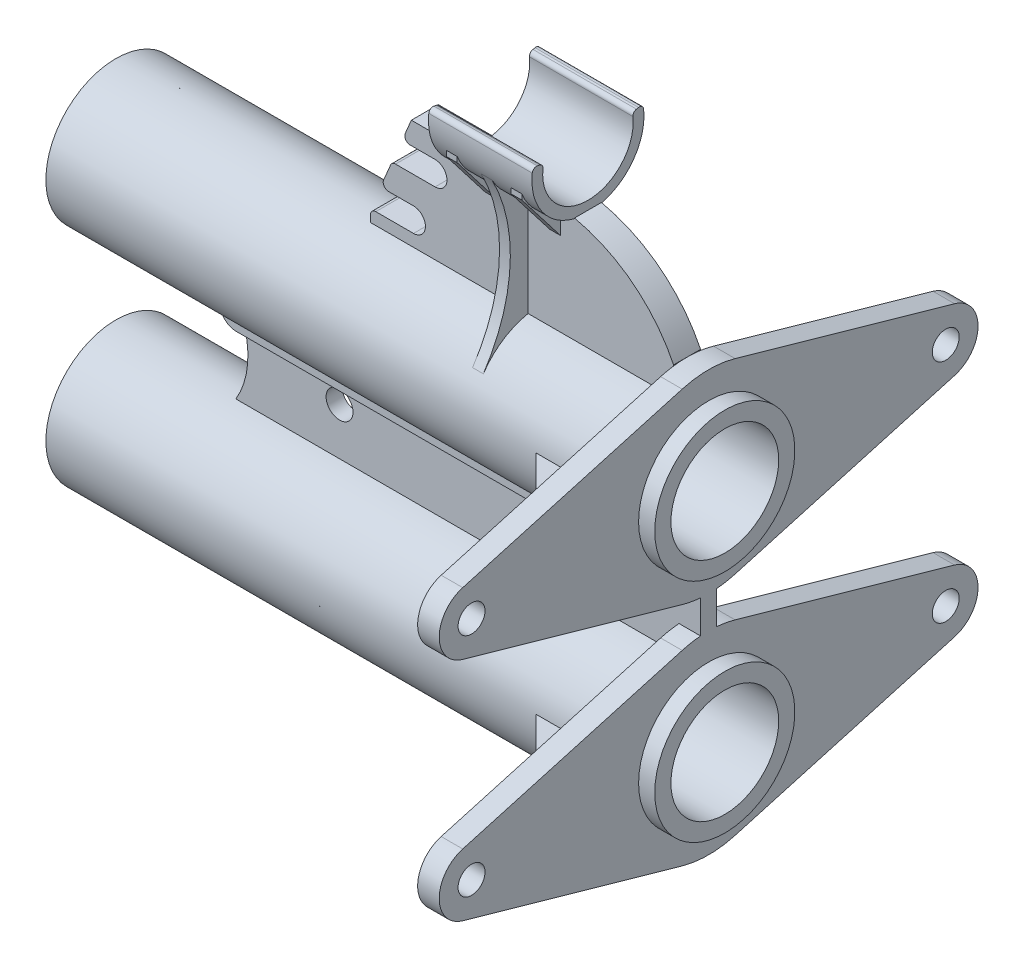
ISO-10303-21;
HEADER;
FILE_DESCRIPTION(('STEP AP214'),'2;1');
FILE_NAME('part.step','',(''),(''),'','','');
FILE_SCHEMA(('AUTOMOTIVE_DESIGN { 1 0 10303 214 1 1 1 1 }'));
ENDSEC;
DATA;
#1=APPLICATION_CONTEXT('core data for automotive mechanical design processes');
#2=APPLICATION_PROTOCOL_DEFINITION('international standard','automotive_design',2000,#1);
#3=PRODUCT_CONTEXT('',#1,'mechanical');
#4=PRODUCT('Part','Part','',(#3));
#5=PRODUCT_RELATED_PRODUCT_CATEGORY('part','',(#4));
#6=PRODUCT_DEFINITION_FORMATION('','',#4);
#7=PRODUCT_DEFINITION_CONTEXT('part definition',#1,'design');
#8=PRODUCT_DEFINITION('design','',#6,#7);
#9=PRODUCT_DEFINITION_SHAPE('','',#8);
#10=(LENGTH_UNIT() NAMED_UNIT(*) SI_UNIT(.MILLI.,.METRE.));
#11=(NAMED_UNIT(*) PLANE_ANGLE_UNIT() SI_UNIT($,.RADIAN.));
#12=(NAMED_UNIT(*) SI_UNIT($,.STERADIAN.) SOLID_ANGLE_UNIT());
#13=UNCERTAINTY_MEASURE_WITH_UNIT(LENGTH_MEASURE(1.E-05),#10,'distance_accuracy_value','');
#14=(GEOMETRIC_REPRESENTATION_CONTEXT(3) GLOBAL_UNCERTAINTY_ASSIGNED_CONTEXT((#13)) GLOBAL_UNIT_ASSIGNED_CONTEXT((#10,
#11,#12)) REPRESENTATION_CONTEXT('',''));
#15=CARTESIAN_POINT('',(0.,0.,0.));
#16=DIRECTION('',(0.,0.,1.));
#17=DIRECTION('',(1.,0.,0.));
#18=AXIS2_PLACEMENT_3D('',#15,#16,#17);
#19=CARTESIAN_POINT('',(-69.85,26.67,0.));
#20=DIRECTION('',(1.,0.,0.));
#21=DIRECTION('',(0.,0.,-1.));
#22=AXIS2_PLACEMENT_3D('',#19,#20,#21);
#23=CYLINDRICAL_SURFACE('',#22,8.255);
#24=CARTESIAN_POINT('',(-69.85,26.67,0.));
#25=DIRECTION('',(1.,0.,0.));
#26=DIRECTION('',(0.,0.,-1.));
#27=AXIS2_PLACEMENT_3D('',#24,#25,#26);
#28=CIRCLE('',#27,8.255);
#29=CARTESIAN_POINT('',(-69.85,26.67,-8.255));
#30=VERTEX_POINT('',#29);
#31=EDGE_CURVE('E1103',#30,#30,#28,.T.);
#32=ORIENTED_EDGE('',*,*,#31,.T.);
#33=EDGE_LOOP('',(#32));
#34=FACE_BOUND('',#33,.T.);
#35=CARTESIAN_POINT('',(-69.85,20.8613239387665,-5.86551851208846));
#36=CARTESIAN_POINT('',(-69.7813928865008,20.9209385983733,-5.92455670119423));
#37=CARTESIAN_POINT('',(-69.7110359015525,20.9804205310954,-5.98166060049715));
#38=CARTESIAN_POINT('',(-69.5669290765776,21.0987877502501,-6.09205754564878));
#39=CARTESIAN_POINT('',(-69.4931796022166,21.1576731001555,-6.14535100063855));
#40=CARTESIAN_POINT('',(-69.2671641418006,21.3328141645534,-6.29949511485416));
#41=CARTESIAN_POINT('',(-69.1099631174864,21.4477020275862,-6.3947533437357));
#42=CARTESIAN_POINT('',(-68.7847556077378,21.6705736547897,-6.57044825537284));
#43=CARTESIAN_POINT('',(-68.6168254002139,21.7785971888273,-6.65097661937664));
#44=CARTESIAN_POINT('',(-68.2705180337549,21.9865696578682,-6.79902970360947));
#45=CARTESIAN_POINT('',(-68.0921388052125,22.086516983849,-6.86655183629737));
#46=CARTESIAN_POINT('',(-67.7269240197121,22.2763689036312,-6.98954870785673));
#47=CARTESIAN_POINT('',(-67.5401167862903,22.3663040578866,-7.04506062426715));
#48=CARTESIAN_POINT('',(-67.1588877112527,22.5352194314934,-7.14550716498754));
#49=CARTESIAN_POINT('',(-66.9644661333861,22.6142000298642,-7.19044215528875));
#50=CARTESIAN_POINT('',(-66.5690294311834,22.7603461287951,-7.27094246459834));
#51=CARTESIAN_POINT('',(-66.36800528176,22.8274945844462,-7.30649430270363));
#52=CARTESIAN_POINT('',(-65.9608775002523,22.9491208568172,-7.36917651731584));
#53=CARTESIAN_POINT('',(-65.7547735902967,23.0035979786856,-7.39630643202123));
#54=CARTESIAN_POINT('',(-65.3193927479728,23.1037994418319,-7.4451755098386));
#55=CARTESIAN_POINT('',(-65.0897384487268,23.1482446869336,-7.4661820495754));
#56=CARTESIAN_POINT('',(-64.6272855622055,23.2209277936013,-7.50003536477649));
#57=CARTESIAN_POINT('',(-64.3944868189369,23.2491648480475,-7.51288173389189));
#58=CARTESIAN_POINT('',(-63.9271175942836,23.2891704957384,-7.53096943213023));
#59=CARTESIAN_POINT('',(-63.6925466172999,23.3009342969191,-7.53620854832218));
#60=CARTESIAN_POINT('',(-63.2231079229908,23.3078727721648,-7.53930609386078));
#61=CARTESIAN_POINT('',(-62.9882401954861,23.3030468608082,-7.53716426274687));
#62=CARTESIAN_POINT('',(-62.5004726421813,23.2757749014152,-7.52492630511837));
#63=CARTESIAN_POINT('',(-62.2476657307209,23.251922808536,-7.51419520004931));
#64=CARTESIAN_POINT('',(-61.7451416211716,23.1851089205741,-7.4834422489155));
#65=CARTESIAN_POINT('',(-61.4954246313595,23.1421458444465,-7.46341978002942));
#66=CARTESIAN_POINT('',(-61.0008787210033,23.0375918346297,-7.41309673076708));
#67=CARTESIAN_POINT('',(-60.756051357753,22.9759950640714,-7.38279292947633));
#68=CARTESIAN_POINT('',(-60.273336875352,22.8349795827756,-7.31053471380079));
#69=CARTESIAN_POINT('',(-60.0354494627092,22.7555616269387,-7.26858079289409));
#70=CARTESIAN_POINT('',(-59.5726426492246,22.5815811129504,-7.17213867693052));
#71=CARTESIAN_POINT('',(-59.3475718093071,22.4872979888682,-7.11787492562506));
#72=CARTESIAN_POINT('',(-58.9082152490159,22.2842580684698,-6.99459716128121));
#73=CARTESIAN_POINT('',(-58.6939296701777,22.1755010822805,-6.92558295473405));
#74=CARTESIAN_POINT('',(-58.278587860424,21.9458583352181,-6.77101391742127));
#75=CARTESIAN_POINT('',(-58.07751406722,21.8249892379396,-6.68548166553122));
#76=CARTESIAN_POINT('',(-57.6904280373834,21.5738580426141,-6.49608055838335));
#77=CARTESIAN_POINT('',(-57.504412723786,21.4435978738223,-6.39221546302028));
#78=CARTESIAN_POINT('',(-57.1715415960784,21.1938650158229,-6.17903268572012));
#79=CARTESIAN_POINT('',(-57.0226963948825,21.0750764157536,-6.07201544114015));
#80=CARTESIAN_POINT('',(-56.7390489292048,20.8357512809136,-5.84243462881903));
#81=CARTESIAN_POINT('',(-56.6042454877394,20.7152148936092,-5.71987236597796));
#82=CARTESIAN_POINT('',(-56.3494827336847,20.4754244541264,-5.45926605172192));
#83=CARTESIAN_POINT('',(-56.2295145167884,20.356169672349,-5.32123138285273));
#84=CARTESIAN_POINT('',(-56.0046555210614,20.1218870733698,-5.03012194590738));
#85=CARTESIAN_POINT('',(-55.8997632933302,20.0068588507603,-4.8770486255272));
#86=CARTESIAN_POINT('',(-55.717667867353,19.7984605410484,-4.57774705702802));
#87=CARTESIAN_POINT('',(-55.6386376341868,19.7042219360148,-4.43322808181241));
#88=CARTESIAN_POINT('',(-55.4916138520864,19.522849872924,-4.13446459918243));
#89=CARTESIAN_POINT('',(-55.4236191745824,19.4357156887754,-3.98022108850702));
#90=CARTESIAN_POINT('',(-55.298208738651,19.2700510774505,-3.66303199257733));
#91=CARTESIAN_POINT('',(-55.2407945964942,19.1915219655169,-3.50008508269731));
#92=CARTESIAN_POINT('',(-55.1360112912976,19.0443555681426,-3.16666708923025));
#93=CARTESIAN_POINT('',(-55.0886424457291,18.9757185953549,-2.99619576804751));
#94=CARTESIAN_POINT('',(-55.0037130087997,18.849875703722,-2.6503357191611));
#95=CARTESIAN_POINT('',(-54.9660775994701,18.7925834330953,-2.47499672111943));
#96=CARTESIAN_POINT('',(-54.8995856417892,18.6895427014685,-2.11934071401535));
#97=CARTESIAN_POINT('',(-54.8707289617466,18.6437940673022,-1.93902377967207));
#98=CARTESIAN_POINT('',(-54.8213181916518,18.564419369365,-1.57460145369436));
#99=CARTESIAN_POINT('',(-54.8007652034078,18.5307949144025,-1.39049556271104));
#100=CARTESIAN_POINT('',(-54.7675988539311,18.4760807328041,-1.01972203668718));
#101=CARTESIAN_POINT('',(-54.7549857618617,18.4549914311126,-0.833054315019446));
#102=CARTESIAN_POINT('',(-54.7370743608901,18.4249455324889,-0.450103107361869));
#103=CARTESIAN_POINT('',(-54.7321224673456,18.4165638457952,-0.253758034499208));
#104=CARTESIAN_POINT('',(-54.7305064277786,18.4138345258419,0.139066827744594));
#105=CARTESIAN_POINT('',(-54.7338425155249,18.4194872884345,0.335546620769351));
#106=CARTESIAN_POINT('',(-54.7488756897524,18.4447606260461,0.727323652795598));
#107=CARTESIAN_POINT('',(-54.7605743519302,18.4643838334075,0.922620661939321));
#108=CARTESIAN_POINT('',(-54.7925782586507,18.517355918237,1.31063293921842));
#109=CARTESIAN_POINT('',(-54.8128835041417,18.5507047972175,1.50334820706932));
#110=CARTESIAN_POINT('',(-54.862856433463,18.6312669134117,1.88755572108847));
#111=CARTESIAN_POINT('',(-54.8926538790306,18.6786716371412,2.0789910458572));
#112=CARTESIAN_POINT('',(-54.9620685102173,18.7864808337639,2.45634972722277));
#113=CARTESIAN_POINT('',(-55.0016858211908,18.8468854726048,2.64227301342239));
#114=CARTESIAN_POINT('',(-55.0913668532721,18.9797417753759,3.00709561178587));
#115=CARTESIAN_POINT('',(-55.1414269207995,19.0521892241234,3.1859973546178));
#116=CARTESIAN_POINT('',(-55.25267102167,19.207936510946,3.53542304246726));
#117=CARTESIAN_POINT('',(-55.3138545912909,19.291235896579,3.70594733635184));
#118=CARTESIAN_POINT('',(-55.4458801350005,19.4644428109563,4.03212130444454));
#119=CARTESIAN_POINT('',(-55.5163622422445,19.5540639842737,4.18806874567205));
#120=CARTESIAN_POINT('',(-55.6688056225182,19.740452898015,4.48974802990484));
#121=CARTESIAN_POINT('',(-55.750766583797,19.8372204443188,4.6354801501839));
#122=CARTESIAN_POINT('',(-55.9264088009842,20.0360151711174,4.91576882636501));
#123=CARTESIAN_POINT('',(-56.0200856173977,20.1380403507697,5.05032958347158));
#124=CARTESIAN_POINT('',(-56.2192280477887,20.345373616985,5.30767676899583));
#125=CARTESIAN_POINT('',(-56.3246934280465,20.4506816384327,5.43046343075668));
#126=CARTESIAN_POINT('',(-56.5431918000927,20.6586795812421,5.65969466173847));
#127=CARTESIAN_POINT('',(-56.6558155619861,20.7613272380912,5.7665684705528));
#128=CARTESIAN_POINT('',(-56.8914121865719,20.9658884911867,5.96899037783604));
#129=CARTESIAN_POINT('',(-57.0143847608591,21.0678021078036,6.06453879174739));
#130=CARTESIAN_POINT('',(-57.2701204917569,21.2691740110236,6.24454588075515));
#131=CARTESIAN_POINT('',(-57.402886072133,21.368631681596,6.32900179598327));
#132=CARTESIAN_POINT('',(-57.6774493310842,21.5634800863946,6.48723644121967));
#133=CARTESIAN_POINT('',(-57.819247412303,21.6588706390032,6.56101469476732));
#134=CARTESIAN_POINT('',(-58.1182593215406,21.8487727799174,6.70189965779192));
#135=CARTESIAN_POINT('',(-58.2758886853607,21.9430078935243,6.76849638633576));
#136=CARTESIAN_POINT('',(-58.5991619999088,22.1241077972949,6.89143467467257));
#137=CARTESIAN_POINT('',(-58.7648061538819,22.2109724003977,6.94777597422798));
#138=CARTESIAN_POINT('',(-59.1031351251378,22.376256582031,7.05112039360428));
#139=CARTESIAN_POINT('',(-59.275822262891,22.4546733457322,7.09812040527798));
#140=CARTESIAN_POINT('',(-59.6271847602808,22.6021611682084,7.1836606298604));
#141=CARTESIAN_POINT('',(-59.8058607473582,22.6712312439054,7.22219995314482));
#142=CARTESIAN_POINT('',(-60.1931153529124,22.8081429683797,7.29643515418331));
#143=CARTESIAN_POINT('',(-60.4024300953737,22.8745125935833,7.33101324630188));
#144=CARTESIAN_POINT('',(-60.82615968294,22.9935325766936,7.39141831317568));
#145=CARTESIAN_POINT('',(-61.040574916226,23.0461818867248,7.41724461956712));
#146=CARTESIAN_POINT('',(-61.4733024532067,23.1372629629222,7.4610556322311));
#147=CARTESIAN_POINT('',(-61.6916166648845,23.1756875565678,7.47903638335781));
#148=CARTESIAN_POINT('',(-62.1307840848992,23.2379389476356,7.50780618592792));
#149=CARTESIAN_POINT('',(-62.3516373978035,23.2617651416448,7.51859494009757));
#150=CARTESIAN_POINT('',(-62.8204005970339,23.2965247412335,7.53426245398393));
#151=CARTESIAN_POINT('',(-63.068475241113,23.3056404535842,7.53830978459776));
#152=CARTESIAN_POINT('',(-63.5646244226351,23.3053402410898,7.53817518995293));
#153=CARTESIAN_POINT('',(-63.8126989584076,23.295922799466,7.53399259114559));
#154=CARTESIAN_POINT('',(-64.3073310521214,23.2586370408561,7.51718350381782));
#155=CARTESIAN_POINT('',(-64.553887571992,23.2307572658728,7.5045517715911));
#156=CARTESIAN_POINT('',(-65.043623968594,23.156827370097,7.47022771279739));
#157=CARTESIAN_POINT('',(-65.2868039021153,23.1107775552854,7.44853553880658));
#158=CARTESIAN_POINT('',(-65.7746616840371,22.9995164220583,7.39435683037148));
#159=CARTESIAN_POINT('',(-66.0191966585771,22.9338127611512,7.36158972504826));
#160=CARTESIAN_POINT('',(-66.5008680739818,22.7846440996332,7.28396182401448));
#161=CARTESIAN_POINT('',(-66.7380037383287,22.7011772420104,7.23909976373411));
#162=CARTESIAN_POINT('',(-67.2021772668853,22.5180065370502,7.1356156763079));
#163=CARTESIAN_POINT('',(-67.4292371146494,22.4183405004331,7.07702555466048));
#164=CARTESIAN_POINT('',(-67.8715592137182,22.2044788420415,6.94406075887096));
#165=CARTESIAN_POINT('',(-68.0868257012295,22.0902884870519,6.869691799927));
#166=CARTESIAN_POINT('',(-68.4399125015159,21.8864790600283,6.72854232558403));
#167=CARTESIAN_POINT('',(-68.581371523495,21.7999524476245,6.66633544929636));
#168=CARTESIAN_POINT('',(-68.8567209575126,21.6221527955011,6.53273510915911));
#169=CARTESIAN_POINT('',(-68.9906138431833,21.5308813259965,6.4613446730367));
#170=CARTESIAN_POINT('',(-69.2506584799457,21.3444192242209,6.30854825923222));
#171=CARTESIAN_POINT('',(-69.3767780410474,21.2492147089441,6.22710434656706));
#172=CARTESIAN_POINT('',(-69.6201920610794,21.0565723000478,6.05402930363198));
#173=CARTESIAN_POINT('',(-69.7374798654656,20.9591327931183,5.9623906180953));
#174=CARTESIAN_POINT('',(-69.85,20.8613239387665,5.86551851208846));
#175=B_SPLINE_CURVE_WITH_KNOTS('',3,(#35,#36,#37,#38,#39,#40,#41,#42,#43,#44,#45,#46,#47,#48,
#49,#50,#51,#52,#53,#54,#55,#56,#57,#58,#59,#60,#61,#62,#63,#64,#65,#66,#67,#68,#69,#70,#71,#72,
#73,#74,#75,#76,#77,#78,#79,#80,#81,#82,#83,#84,#85,#86,#87,#88,#89,#90,#91,#92,#93,#94,#95,#96,
#97,#98,#99,#100,#101,#102,#103,#104,#105,#106,#107,#108,#109,#110,#111,#112,#113,#114,#115,
#116,#117,#118,#119,#120,#121,#122,#123,#124,#125,#126,#127,#128,#129,#130,#131,#132,#133,#134,
#135,#136,#137,#138,#139,#140,#141,#142,#143,#144,#145,#146,#147,#148,#149,#150,#151,#152,#153,
#154,#155,#156,#157,#158,#159,#160,#161,#162,#163,#164,#165,#166,#167,#168,#169,#170,#171,#172,
#173,#174),.UNSPECIFIED.,.F.,.F.,(4,2,2,2,2,2,2,2,2,2,2,2,2,2,2,2,2,2,2,2,2,2,2,2,2,2,2,2,2,2,2,
2,2,2,2,2,2,2,2,2,2,2,2,2,2,2,2,2,2,2,2,2,2,2,2,2,2,2,2,2,2,2,2,2,2,2,2,2,2,4),(0.,
0.325074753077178,0.650114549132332,1.29940046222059,1.94449631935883,2.58972038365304,
3.23291764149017,3.87609263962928,4.52018672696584,5.16431612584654,5.86814182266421,
6.57200256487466,7.27606801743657,7.98015831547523,8.74171808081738,9.50332890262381,
10.2651785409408,11.0269959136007,11.7759040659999,12.5248220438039,13.2727234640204,
14.0204716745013,14.6748472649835,15.3291679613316,15.9830939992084,16.6369571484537,
17.2055765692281,17.7741378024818,18.3427858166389,18.9114517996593,19.4756071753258,
20.0397540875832,20.6039758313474,21.168216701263,21.7572939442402,22.3463878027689,
22.9355926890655,23.524797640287,24.1224303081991,24.720070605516,25.3175021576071,
25.9149088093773,26.4937222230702,27.0725199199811,27.6510989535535,28.2296665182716,
28.7874013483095,29.3451206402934,29.9029784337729,30.4608611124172,31.0463176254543,
31.631788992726,32.2174548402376,32.803182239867,33.4693677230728,34.1356040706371,
34.8021758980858,35.4687752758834,36.2127553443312,36.9567963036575,37.7012994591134,
38.4457900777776,39.210764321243,39.9758185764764,40.7391120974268,41.5021296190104,
42.0330348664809,42.5637655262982,43.0965638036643,43.6297595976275),.UNSPECIFIED.);
#176=CARTESIAN_POINT('',(-55.0546588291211,18.925342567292,-2.8575));
#177=VERTEX_POINT('',#176);
#178=CARTESIAN_POINT('',(-55.0546588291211,18.925342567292,2.8575));
#179=VERTEX_POINT('',#178);
#180=EDGE_CURVE('E643',#177,#179,#175,.T.);
#181=ORIENTED_EDGE('',*,*,#180,.T.);
#182=DIRECTION('',(1.,0.,0.));
#183=VECTOR('',#182,1.);
#184=CARTESIAN_POINT('',(-69.851,18.925342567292,2.8575));
#185=LINE('',#184,#183);
#186=CARTESIAN_POINT('',(-2.54,18.925342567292,2.8575));
#187=VERTEX_POINT('',#186);
#188=EDGE_CURVE('E640',#179,#187,#185,.T.);
#189=ORIENTED_EDGE('',*,*,#188,.T.);
#190=CARTESIAN_POINT('',(-2.54,26.67,0.));
#191=DIRECTION('',(1.,0.,0.));
#192=DIRECTION('',(0.,0.,-1.));
#193=AXIS2_PLACEMENT_3D('',#190,#191,#192);
#194=CIRCLE('',#193,8.255);
#195=CARTESIAN_POINT('',(-2.54,25.7175,8.19986394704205));
#196=VERTEX_POINT('',#195);
#197=EDGE_CURVE('E621',#187,#196,#194,.F.);
#198=ORIENTED_EDGE('',*,*,#197,.T.);
#199=DIRECTION('',(1.,0.,0.));
#200=VECTOR('',#199,1.);
#201=CARTESIAN_POINT('',(-69.85,25.7175,8.19986394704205));
#202=LINE('',#201,#200);
#203=CARTESIAN_POINT('',(-12.120136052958,25.7175,8.19986394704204));
#204=VERTEX_POINT('',#203);
#205=EDGE_CURVE('E978',#196,#204,#202,.F.);
#206=ORIENTED_EDGE('',*,*,#205,.T.);
#207=CARTESIAN_POINT('',(-20.32,26.67,0.));
#208=DIRECTION('',(0.707106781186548,0.,-0.707106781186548));
#209=DIRECTION('',(0.707106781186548,0.,0.707106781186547));
#210=AXIS2_PLACEMENT_3D('',#207,#208,#209);
#211=ELLIPSE('',#210,11.6743329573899,8.255);
#212=CARTESIAN_POINT('',(-12.120136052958,27.6225,8.19986394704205));
#213=VERTEX_POINT('',#212);
#214=EDGE_CURVE('E983',#204,#213,#211,.F.);
#215=ORIENTED_EDGE('',*,*,#214,.T.);
#216=DIRECTION('',(1.,0.,0.));
#217=VECTOR('',#216,1.);
#218=CARTESIAN_POINT('',(-69.85,27.6225,8.19986394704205));
#219=LINE('',#218,#217);
#220=CARTESIAN_POINT('',(-2.54,27.6225,8.19986394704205));
#221=VERTEX_POINT('',#220);
#222=EDGE_CURVE('E980',#221,#213,#219,.F.);
#223=ORIENTED_EDGE('',*,*,#222,.F.);
#224=CARTESIAN_POINT('',(-2.54,34.7709177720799,1.5875));
#225=VERTEX_POINT('',#224);
#226=EDGE_CURVE('E634',#221,#225,#194,.F.);
#227=ORIENTED_EDGE('',*,*,#226,.T.);
#228=DIRECTION('',(1.,0.,0.));
#229=VECTOR('',#228,1.);
#230=CARTESIAN_POINT('',(-69.85,34.7709177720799,1.5875));
#231=LINE('',#230,#229);
#232=CARTESIAN_POINT('',(-19.685,34.7709177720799,1.5875));
#233=VERTEX_POINT('',#232);
#234=EDGE_CURVE('E966',#233,#225,#231,.T.);
#235=ORIENTED_EDGE('',*,*,#234,.F.);
#236=CARTESIAN_POINT('',(-19.685,26.67,0.));
#237=DIRECTION('',(-1.,0.,0.));
#238=DIRECTION('',(0.,0.,1.));
#239=AXIS2_PLACEMENT_3D('',#236,#237,#238);
#240=CIRCLE('',#239,8.255);
#241=CARTESIAN_POINT('',(-19.685,31.255260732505,6.86443071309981));
#242=VERTEX_POINT('',#241);
#243=EDGE_CURVE('E734',#242,#233,#240,.T.);
#244=ORIENTED_EDGE('',*,*,#243,.F.);
#245=DIRECTION('',(1.,0.,0.));
#246=VECTOR('',#245,1.);
#247=CARTESIAN_POINT('',(-20.955,31.255260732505,6.86443071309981));
#248=LINE('',#247,#246);
#249=CARTESIAN_POINT('',(-20.955,31.255260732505,6.86443071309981));
#250=VERTEX_POINT('',#249);
#251=EDGE_CURVE('E740',#250,#242,#248,.T.);
#252=ORIENTED_EDGE('',*,*,#251,.F.);
#253=CARTESIAN_POINT('',(-20.955,26.67,0.));
#254=DIRECTION('',(-1.,0.,0.));
#255=DIRECTION('',(0.,0.,1.));
#256=AXIS2_PLACEMENT_3D('',#253,#254,#255);
#257=CIRCLE('',#256,8.255);
#258=CARTESIAN_POINT('',(-20.955,34.7709177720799,1.5875));
#259=VERTEX_POINT('',#258);
#260=EDGE_CURVE('E723',#250,#259,#257,.T.);
#261=ORIENTED_EDGE('',*,*,#260,.T.);
#262=CARTESIAN_POINT('',(-38.2715391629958,34.7709177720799,1.5875));
#263=VERTEX_POINT('',#262);
#264=EDGE_CURVE('E967',#263,#259,#231,.T.);
#265=ORIENTED_EDGE('',*,*,#264,.F.);
#266=CARTESIAN_POINT('',(-38.2715391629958,26.67,0.));
#267=DIRECTION('',(-1.,0.,0.));
#268=DIRECTION('',(0.,0.,1.));
#269=AXIS2_PLACEMENT_3D('',#266,#267,#268);
#270=CIRCLE('',#269,8.255);
#271=CARTESIAN_POINT('',(-38.2715391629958,34.7709177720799,-1.5875));
#272=VERTEX_POINT('',#271);
#273=EDGE_CURVE('E1796',#272,#263,#270,.F.);
#274=ORIENTED_EDGE('',*,*,#273,.F.);
#275=DIRECTION('',(1.,0.,0.));
#276=VECTOR('',#275,1.);
#277=CARTESIAN_POINT('',(-69.85,34.7709177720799,-1.5875));
#278=LINE('',#277,#276);
#279=CARTESIAN_POINT('',(-20.955,34.7709177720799,-1.5875));
#280=VERTEX_POINT('',#279);
#281=EDGE_CURVE('E963',#272,#280,#278,.T.);
#282=ORIENTED_EDGE('',*,*,#281,.T.);
#283=CARTESIAN_POINT('',(-20.955,26.67,0.));
#284=DIRECTION('',(1.,0.,0.));
#285=DIRECTION('',(0.,0.,-1.));
#286=AXIS2_PLACEMENT_3D('',#283,#284,#285);
#287=CIRCLE('',#286,8.255);
#288=CARTESIAN_POINT('',(-20.955,31.255260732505,-6.86443071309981));
#289=VERTEX_POINT('',#288);
#290=EDGE_CURVE('E822',#289,#280,#287,.T.);
#291=ORIENTED_EDGE('',*,*,#290,.F.);
#292=DIRECTION('',(1.,0.,0.));
#293=VECTOR('',#292,1.);
#294=CARTESIAN_POINT('',(-20.955,31.255260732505,-6.86443071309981));
#295=LINE('',#294,#293);
#296=CARTESIAN_POINT('',(-19.685,31.255260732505,-6.86443071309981));
#297=VERTEX_POINT('',#296);
#298=EDGE_CURVE('E826',#289,#297,#295,.T.);
#299=ORIENTED_EDGE('',*,*,#298,.T.);
#300=CARTESIAN_POINT('',(-19.685,26.67,0.));
#301=DIRECTION('',(1.,0.,0.));
#302=DIRECTION('',(0.,0.,-1.));
#303=AXIS2_PLACEMENT_3D('',#300,#301,#302);
#304=CIRCLE('',#303,8.255);
#305=CARTESIAN_POINT('',(-19.685,34.7709177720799,-1.5875));
#306=VERTEX_POINT('',#305);
#307=EDGE_CURVE('E831',#297,#306,#304,.T.);
#308=ORIENTED_EDGE('',*,*,#307,.T.);
#309=CARTESIAN_POINT('',(-2.54,34.7709177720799,-1.5875));
#310=VERTEX_POINT('',#309);
#311=EDGE_CURVE('E962',#306,#310,#278,.T.);
#312=ORIENTED_EDGE('',*,*,#311,.T.);
#313=CARTESIAN_POINT('',(-2.54,27.6225,-8.19986394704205));
#314=VERTEX_POINT('',#313);
#315=EDGE_CURVE('E636',#310,#314,#194,.F.);
#316=ORIENTED_EDGE('',*,*,#315,.T.);
#317=DIRECTION('',(1.,0.,0.));
#318=VECTOR('',#317,1.);
#319=CARTESIAN_POINT('',(-69.85,27.6225,-8.19986394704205));
#320=LINE('',#319,#318);
#321=CARTESIAN_POINT('',(-12.120136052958,27.6225,-8.19986394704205));
#322=VERTEX_POINT('',#321);
#323=EDGE_CURVE('E997',#322,#314,#320,.T.);
#324=ORIENTED_EDGE('',*,*,#323,.F.);
#325=CARTESIAN_POINT('',(-20.32,26.67,0.));
#326=DIRECTION('',(-0.707106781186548,0.,-0.707106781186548));
#327=DIRECTION('',(0.707106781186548,0.,-0.707106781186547));
#328=AXIS2_PLACEMENT_3D('',#325,#326,#327);
#329=ELLIPSE('',#328,11.6743329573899,8.255);
#330=CARTESIAN_POINT('',(-12.1201360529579,25.7175,-8.19986394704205));
#331=VERTEX_POINT('',#330);
#332=EDGE_CURVE('E1000',#331,#322,#329,.F.);
#333=ORIENTED_EDGE('',*,*,#332,.F.);
#334=DIRECTION('',(1.,0.,0.));
#335=VECTOR('',#334,1.);
#336=CARTESIAN_POINT('',(-69.85,25.7175,-8.19986394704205));
#337=LINE('',#336,#335);
#338=CARTESIAN_POINT('',(-2.54,25.7175,-8.19986394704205));
#339=VERTEX_POINT('',#338);
#340=EDGE_CURVE('E994',#331,#339,#337,.T.);
#341=ORIENTED_EDGE('',*,*,#340,.T.);
#342=CARTESIAN_POINT('',(-2.54,18.925342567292,-2.8575));
#343=VERTEX_POINT('',#342);
#344=EDGE_CURVE('E637',#339,#343,#194,.F.);
#345=ORIENTED_EDGE('',*,*,#344,.T.);
#346=DIRECTION('',(1.,0.,0.));
#347=VECTOR('',#346,1.);
#348=CARTESIAN_POINT('',(-69.851,18.925342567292,-2.8575));
#349=LINE('',#348,#347);
#350=EDGE_CURVE('E752',#177,#343,#349,.T.);
#351=ORIENTED_EDGE('',*,*,#350,.F.);
#352=EDGE_LOOP('',(#181,#189,#198,#206,#215,#223,#227,#235,#244,#252,#261,#265,#274,#282,#291,
#299,#308,#312,#316,#324,#333,#341,#345,#351));
#353=FACE_BOUND('',#352,.T.);
#354=ADVANCED_FACE('F32',(#34,#353),#23,.T.);
#355=CARTESIAN_POINT('',(-17.78,30.6705,1.5875));
#356=DIRECTION('',(0.,0.,1.));
#357=DIRECTION('',(1.,0.,0.));
#358=AXIS2_PLACEMENT_3D('',#355,#356,#357);
#359=PLANE('',#358);
#360=DIRECTION('',(0.,1.,0.));
#361=VECTOR('',#360,1.);
#362=CARTESIAN_POINT('',(-24.765,44.6436443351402,1.5875));
#363=LINE('',#362,#361);
#364=CARTESIAN_POINT('',(-24.765,44.6436443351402,1.5875));
#365=VERTEX_POINT('',#364);
#366=CARTESIAN_POINT('',(-24.765,47.1836443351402,1.5875));
#367=VERTEX_POINT('',#366);
#368=EDGE_CURVE('E688',#365,#367,#363,.T.);
#369=ORIENTED_EDGE('',*,*,#368,.T.);
#370=DIRECTION('',(-1.,0.,0.));
#371=VECTOR('',#370,1.);
#372=CARTESIAN_POINT('',(-14.224,47.1836443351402,1.5875));
#373=LINE('',#372,#371);
#374=CARTESIAN_POINT('',(-26.416,47.1836443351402,1.5875));
#375=VERTEX_POINT('',#374);
#376=EDGE_CURVE('E875',#367,#375,#373,.T.);
#377=ORIENTED_EDGE('',*,*,#376,.T.);
#378=DIRECTION('',(0.,1.,0.));
#379=VECTOR('',#378,1.);
#380=CARTESIAN_POINT('',(-26.416,30.6705,1.5875));
#381=LINE('',#380,#379);
#382=CARTESIAN_POINT('',(-26.416,47.625,1.5875));
#383=VERTEX_POINT('',#382);
#384=EDGE_CURVE('E868',#375,#383,#381,.T.);
#385=ORIENTED_EDGE('',*,*,#384,.T.);
#386=DIRECTION('',(1.,0.,0.));
#387=VECTOR('',#386,1.);
#388=CARTESIAN_POINT('',(-33.4455391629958,47.625,1.5875));
#389=LINE('',#388,#387);
#390=CARTESIAN_POINT('',(-33.4455391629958,47.625,1.5875));
#391=VERTEX_POINT('',#390);
#392=EDGE_CURVE('E885',#391,#383,#389,.T.);
#393=ORIENTED_EDGE('',*,*,#392,.F.);
#394=DIRECTION('',(0.388972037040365,0.921249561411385,0.));
#395=VECTOR('',#394,1.);
#396=CARTESIAN_POINT('',(-34.5459816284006,45.0186888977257,1.5875));
#397=LINE('',#396,#395);
#398=CARTESIAN_POINT('',(-34.1735827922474,45.9006861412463,1.5875));
#399=VERTEX_POINT('',#398);
#400=EDGE_CURVE('E889',#399,#391,#397,.T.);
#401=ORIENTED_EDGE('',*,*,#400,.F.);
#402=CARTESIAN_POINT('',(-33.5885893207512,45.6536888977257,1.5875));
#403=DIRECTION('',(0.,0.,1.));
#404=DIRECTION('',(1.,0.,0.));
#405=AXIS2_PLACEMENT_3D('',#402,#403,#404);
#406=CIRCLE('',#405,0.635);
#407=CARTESIAN_POINT('',(-33.5885893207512,45.0186888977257,1.5875));
#408=VERTEX_POINT('',#407);
#409=EDGE_CURVE('E1817',#399,#408,#406,.T.);
#410=ORIENTED_EDGE('',*,*,#409,.T.);
#411=DIRECTION('',(-1.,0.,0.));
#412=VECTOR('',#411,1.);
#413=CARTESIAN_POINT('',(-30.6515391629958,45.0186888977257,1.5875));
#414=LINE('',#413,#412);
#415=CARTESIAN_POINT('',(-30.6515391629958,45.0186888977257,1.5875));
#416=VERTEX_POINT('',#415);
#417=EDGE_CURVE('E891',#416,#408,#414,.T.);
#418=ORIENTED_EDGE('',*,*,#417,.F.);
#419=CARTESIAN_POINT('',(-30.6515391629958,43.6147391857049,1.5875));
#420=DIRECTION('',(0.,0.,1.));
#421=DIRECTION('',(1.,0.,0.));
#422=AXIS2_PLACEMENT_3D('',#419,#420,#421);
#423=CIRCLE('',#422,1.40394971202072);
#424=CARTESIAN_POINT('',(-30.6515391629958,42.2107894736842,1.5875));
#425=VERTEX_POINT('',#424);
#426=EDGE_CURVE('E894',#425,#416,#423,.T.);
#427=ORIENTED_EDGE('',*,*,#426,.F.);
#428=DIRECTION('',(1.,0.,0.));
#429=VECTOR('',#428,1.);
#430=CARTESIAN_POINT('',(-35.7315391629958,42.2107894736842,1.5875));
#431=LINE('',#430,#429);
#432=CARTESIAN_POINT('',(-35.3103690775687,42.2107894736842,1.5875));
#433=VERTEX_POINT('',#432);
#434=EDGE_CURVE('E897',#433,#425,#431,.T.);
#435=ORIENTED_EDGE('',*,*,#434,.F.);
#436=CARTESIAN_POINT('',(-35.3103690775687,41.5757894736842,1.5875));
#437=DIRECTION('',(0.,0.,1.));
#438=DIRECTION('',(1.,0.,0.));
#439=AXIS2_PLACEMENT_3D('',#436,#437,#438);
#440=CIRCLE('',#439,0.635);
#441=CARTESIAN_POINT('',(-35.8953625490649,41.8227867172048,1.5875));
#442=VERTEX_POINT('',#441);
#443=EDGE_CURVE('E1819',#433,#442,#440,.T.);
#444=ORIENTED_EDGE('',*,*,#443,.T.);
#445=DIRECTION('',(-0.388972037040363,-0.921249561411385,0.));
#446=VECTOR('',#445,1.);
#447=CARTESIAN_POINT('',(-35.7315391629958,42.2107894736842,1.5875));
#448=LINE('',#447,#446);
#449=CARTESIAN_POINT('',(-36.7135827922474,39.8848966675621,1.5875));
#450=VERTEX_POINT('',#449);
#451=EDGE_CURVE('E899',#442,#450,#448,.T.);
#452=ORIENTED_EDGE('',*,*,#451,.T.);
#453=CARTESIAN_POINT('',(-36.1285893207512,39.6378994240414,1.5875));
#454=DIRECTION('',(0.,0.,1.));
#455=DIRECTION('',(1.,0.,0.));
#456=AXIS2_PLACEMENT_3D('',#453,#454,#455);
#457=CIRCLE('',#456,0.635);
#458=CARTESIAN_POINT('',(-36.1285893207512,39.0028994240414,1.5875));
#459=VERTEX_POINT('',#458);
#460=EDGE_CURVE('E1821',#450,#459,#457,.T.);
#461=ORIENTED_EDGE('',*,*,#460,.T.);
#462=DIRECTION('',(-1.,0.,0.));
#463=VECTOR('',#462,1.);
#464=CARTESIAN_POINT('',(-33.1915391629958,39.0028994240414,1.5875));
#465=LINE('',#464,#463);
#466=CARTESIAN_POINT('',(-33.1915391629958,39.0028994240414,1.5875));
#467=VERTEX_POINT('',#466);
#468=EDGE_CURVE('E902',#467,#459,#465,.T.);
#469=ORIENTED_EDGE('',*,*,#468,.F.);
#470=CARTESIAN_POINT('',(-33.1915391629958,37.5989497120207,1.5875));
#471=DIRECTION('',(0.,0.,-1.));
#472=DIRECTION('',(-1.,0.,0.));
#473=AXIS2_PLACEMENT_3D('',#470,#471,#472);
#474=CIRCLE('',#473,1.40394971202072);
#475=CARTESIAN_POINT('',(-33.1915391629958,36.195,1.5875));
#476=VERTEX_POINT('',#475);
#477=EDGE_CURVE('E905',#467,#476,#474,.T.);
#478=ORIENTED_EDGE('',*,*,#477,.T.);
#479=DIRECTION('',(1.,0.,0.));
#480=VECTOR('',#479,1.);
#481=CARTESIAN_POINT('',(-38.2715391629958,36.195,1.5875));
#482=LINE('',#481,#480);
#483=CARTESIAN_POINT('',(-37.6365391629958,36.195,1.5875));
#484=VERTEX_POINT('',#483);
#485=EDGE_CURVE('E908',#484,#476,#482,.T.);
#486=ORIENTED_EDGE('',*,*,#485,.F.);
#487=CARTESIAN_POINT('',(-37.6365391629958,35.56,1.5875));
#488=DIRECTION('',(0.,0.,1.));
#489=DIRECTION('',(1.,0.,0.));
#490=AXIS2_PLACEMENT_3D('',#487,#488,#489);
#491=CIRCLE('',#490,0.635);
#492=CARTESIAN_POINT('',(-38.2715391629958,35.56,1.5875));
#493=VERTEX_POINT('',#492);
#494=EDGE_CURVE('E1815',#484,#493,#491,.T.);
#495=ORIENTED_EDGE('',*,*,#494,.T.);
#496=DIRECTION('',(0.,1.,0.));
#497=VECTOR('',#496,1.);
#498=CARTESIAN_POINT('',(-38.2715391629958,33.9725,1.5875));
#499=LINE('',#498,#497);
#500=EDGE_CURVE('E910',#263,#493,#499,.T.);
#501=ORIENTED_EDGE('',*,*,#500,.F.);
#502=ORIENTED_EDGE('',*,*,#264,.T.);
#503=DIRECTION('',(0.,1.,0.));
#504=VECTOR('',#503,1.);
#505=CARTESIAN_POINT('',(-20.955,34.7709177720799,1.5875));
#506=LINE('',#505,#504);
#507=CARTESIAN_POINT('',(-20.955,47.1836443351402,1.5875));
#508=VERTEX_POINT('',#507);
#509=EDGE_CURVE('E719',#259,#508,#506,.T.);
#510=ORIENTED_EDGE('',*,*,#509,.T.);
#511=CARTESIAN_POINT('',(-23.495,47.1836443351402,1.5875));
#512=VERTEX_POINT('',#511);
#513=EDGE_CURVE('E881',#508,#512,#373,.T.);
#514=ORIENTED_EDGE('',*,*,#513,.T.);
#515=DIRECTION('',(0.,1.,0.));
#516=VECTOR('',#515,1.);
#517=CARTESIAN_POINT('',(-23.495,44.6436443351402,1.5875));
#518=LINE('',#517,#516);
#519=CARTESIAN_POINT('',(-23.495,44.6436443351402,1.5875));
#520=VERTEX_POINT('',#519);
#521=EDGE_CURVE('E687',#520,#512,#518,.T.);
#522=ORIENTED_EDGE('',*,*,#521,.F.);
#523=DIRECTION('',(1.,0.,0.));
#524=VECTOR('',#523,1.);
#525=CARTESIAN_POINT('',(-24.765,44.6436443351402,1.5875));
#526=LINE('',#525,#524);
#527=EDGE_CURVE('E712',#365,#520,#526,.T.);
#528=ORIENTED_EDGE('',*,*,#527,.F.);
#529=EDGE_LOOP('',(#369,#377,#385,#393,#401,#410,#418,#427,#435,#444,#452,#461,#469,#478,#486,
#495,#501,#502,#510,#514,#522,#528));
#530=FACE_BOUND('',#529,.T.);
#531=ADVANCED_FACE('F1408',(#530),#359,.T.);
#532=CARTESIAN_POINT('',(-14.224,53.594,0.));
#533=DIRECTION('',(-1.,0.,0.));
#534=DIRECTION('',(0.,0.,1.));
#535=AXIS2_PLACEMENT_3D('',#532,#533,#534);
#536=CYLINDRICAL_SURFACE('',#535,6.604);
#537=DIRECTION('',(-1.,0.,0.));
#538=VECTOR('',#537,1.);
#539=CARTESIAN_POINT('',(-15.875,51.1694880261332,6.14284605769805));
#540=LINE('',#539,#538);
#541=CARTESIAN_POINT('',(-15.875,51.1694880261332,6.14284605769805));
#542=VERTEX_POINT('',#541);
#543=CARTESIAN_POINT('',(-17.145,51.1694880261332,6.14284605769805));
#544=VERTEX_POINT('',#543);
#545=EDGE_CURVE('E685',#542,#544,#540,.T.);
#546=ORIENTED_EDGE('',*,*,#545,.F.);
#547=CARTESIAN_POINT('',(-15.875,53.594,0.));
#548=DIRECTION('',(1.,0.,0.));
#549=DIRECTION('',(0.,0.,-1.));
#550=AXIS2_PLACEMENT_3D('',#547,#548,#549);
#551=CIRCLE('',#550,6.604);
#552=CARTESIAN_POINT('',(-15.875,47.1836443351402,1.5875));
#553=VERTEX_POINT('',#552);
#554=EDGE_CURVE('E661',#542,#553,#551,.T.);
#555=ORIENTED_EDGE('',*,*,#554,.T.);
#556=CARTESIAN_POINT('',(-14.224,47.1836443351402,1.5875));
#557=VERTEX_POINT('',#556);
#558=EDGE_CURVE('E876',#557,#553,#373,.T.);
#559=ORIENTED_EDGE('',*,*,#558,.F.);
#560=CARTESIAN_POINT('',(-14.224,53.594,0.));
#561=DIRECTION('',(1.,0.,0.));
#562=DIRECTION('',(0.,0.,-1.));
#563=AXIS2_PLACEMENT_3D('',#560,#561,#562);
#564=CIRCLE('',#563,6.604);
#565=CARTESIAN_POINT('',(-14.224,54.3195214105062,6.5640257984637));
#566=VERTEX_POINT('',#565);
#567=EDGE_CURVE('E846',#566,#557,#564,.T.);
#568=ORIENTED_EDGE('',*,*,#567,.F.);
#569=DIRECTION('',(-1.,0.,0.));
#570=VECTOR('',#569,1.);
#571=CARTESIAN_POINT('',(-14.224,54.3195214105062,6.5640257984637));
#572=LINE('',#571,#570);
#573=CARTESIAN_POINT('',(-26.416,54.3195214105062,6.5640257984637));
#574=VERTEX_POINT('',#573);
#575=EDGE_CURVE('E1556',#566,#574,#572,.T.);
#576=ORIENTED_EDGE('',*,*,#575,.T.);
#577=CARTESIAN_POINT('',(-26.416,53.594,0.));
#578=DIRECTION('',(1.,0.,0.));
#579=DIRECTION('',(0.,0.,-1.));
#580=AXIS2_PLACEMENT_3D('',#577,#578,#579);
#581=CIRCLE('',#580,6.604);
#582=EDGE_CURVE('E858',#574,#375,#581,.T.);
#583=ORIENTED_EDGE('',*,*,#582,.T.);
#584=ORIENTED_EDGE('',*,*,#376,.F.);
#585=CARTESIAN_POINT('',(-24.765,53.594,0.));
#586=DIRECTION('',(1.,0.,0.));
#587=DIRECTION('',(0.,0.,-1.));
#588=AXIS2_PLACEMENT_3D('',#585,#586,#587);
#589=CIRCLE('',#588,6.604);
#590=CARTESIAN_POINT('',(-24.765,51.1694880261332,6.14284605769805));
#591=VERTEX_POINT('',#590);
#592=EDGE_CURVE('E696',#591,#367,#589,.T.);
#593=ORIENTED_EDGE('',*,*,#592,.F.);
#594=DIRECTION('',(1.,0.,0.));
#595=VECTOR('',#594,1.);
#596=CARTESIAN_POINT('',(-24.765,51.1694880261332,6.14284605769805));
#597=LINE('',#596,#595);
#598=CARTESIAN_POINT('',(-23.495,51.1694880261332,6.14284605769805));
#599=VERTEX_POINT('',#598);
#600=EDGE_CURVE('E699',#591,#599,#597,.T.);
#601=ORIENTED_EDGE('',*,*,#600,.T.);
#602=CARTESIAN_POINT('',(-23.495,53.594,0.));
#603=DIRECTION('',(1.,0.,0.));
#604=DIRECTION('',(0.,0.,-1.));
#605=AXIS2_PLACEMENT_3D('',#602,#603,#604);
#606=CIRCLE('',#605,6.604);
#607=EDGE_CURVE('E691',#599,#512,#606,.T.);
#608=ORIENTED_EDGE('',*,*,#607,.T.);
#609=ORIENTED_EDGE('',*,*,#513,.F.);
#610=CARTESIAN_POINT('',(-20.955,53.594,0.));
#611=DIRECTION('',(-1.,0.,0.));
#612=DIRECTION('',(0.,0.,1.));
#613=AXIS2_PLACEMENT_3D('',#610,#611,#612);
#614=CIRCLE('',#613,6.604);
#615=CARTESIAN_POINT('',(-20.955,50.5243563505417,5.84723044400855));
#616=VERTEX_POINT('',#615);
#617=EDGE_CURVE('E716',#508,#616,#614,.T.);
#618=ORIENTED_EDGE('',*,*,#617,.T.);
#619=DIRECTION('',(1.,0.,0.));
#620=VECTOR('',#619,1.);
#621=CARTESIAN_POINT('',(-20.955,50.5243563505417,5.84723044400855));
#622=LINE('',#621,#620);
#623=CARTESIAN_POINT('',(-19.685,50.5243563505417,5.84723044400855));
#624=VERTEX_POINT('',#623);
#625=EDGE_CURVE('E729',#616,#624,#622,.T.);
#626=ORIENTED_EDGE('',*,*,#625,.T.);
#627=CARTESIAN_POINT('',(-19.685,53.594,0.));
#628=DIRECTION('',(-1.,0.,0.));
#629=DIRECTION('',(0.,0.,1.));
#630=AXIS2_PLACEMENT_3D('',#627,#628,#629);
#631=CIRCLE('',#630,6.604);
#632=CARTESIAN_POINT('',(-19.685,47.1836443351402,1.5875));
#633=VERTEX_POINT('',#632);
#634=EDGE_CURVE('E715',#633,#624,#631,.T.);
#635=ORIENTED_EDGE('',*,*,#634,.F.);
#636=CARTESIAN_POINT('',(-17.145,47.1836443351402,1.5875));
#637=VERTEX_POINT('',#636);
#638=EDGE_CURVE('E880',#637,#633,#373,.T.);
#639=ORIENTED_EDGE('',*,*,#638,.F.);
#640=CARTESIAN_POINT('',(-17.145,53.594,0.));
#641=DIRECTION('',(1.,0.,0.));
#642=DIRECTION('',(0.,0.,-1.));
#643=AXIS2_PLACEMENT_3D('',#640,#641,#642);
#644=CIRCLE('',#643,6.604);
#645=EDGE_CURVE('E674',#544,#637,#644,.T.);
#646=ORIENTED_EDGE('',*,*,#645,.F.);
#647=EDGE_LOOP('',(#546,#555,#559,#568,#576,#583,#584,#593,#601,#608,#609,#618,#626,#635,#639,#646));
#648=FACE_BOUND('',#647,.T.);
#649=ADVANCED_FACE('F1413',(#648),#536,.T.);
#650=CARTESIAN_POINT('',(-63.3104921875,13.335,-0.9525));
#651=DIRECTION('',(0.,0.,1.));
#652=DIRECTION('',(1.,0.,0.));
#653=AXIS2_PLACEMENT_3D('',#650,#651,#652);
#654=PLANE('',#653);
#655=CARTESIAN_POINT('',(-12.7,13.7414,-0.9525));
#656=DIRECTION('',(0.,0.,1.));
#657=DIRECTION('',(1.,0.,0.));
#658=AXIS2_PLACEMENT_3D('',#655,#656,#657);
#659=CIRCLE('',#658,1.5875);
#660=CARTESIAN_POINT('',(-14.2875,13.7414,-0.9525));
#661=VERTEX_POINT('',#660);
#662=EDGE_CURVE('E1106',#661,#661,#659,.T.);
#663=ORIENTED_EDGE('',*,*,#662,.T.);
#664=EDGE_LOOP('',(#663));
#665=FACE_BOUND('',#664,.T.);
#666=CARTESIAN_POINT('',(-42.545,13.7414,-0.9525));
#667=DIRECTION('',(0.,0.,1.));
#668=DIRECTION('',(1.,0.,0.));
#669=AXIS2_PLACEMENT_3D('',#666,#667,#668);
#670=CIRCLE('',#669,1.5875);
#671=CARTESIAN_POINT('',(-44.1325,13.7414,-0.9525));
#672=VERTEX_POINT('',#671);
#673=EDGE_CURVE('E1110',#672,#672,#670,.T.);
#674=ORIENTED_EDGE('',*,*,#673,.T.);
#675=EDGE_LOOP('',(#674));
#676=FACE_BOUND('',#675,.T.);
#677=CARTESIAN_POINT('',(-63.3104921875,13.335,-0.9525));
#678=DIRECTION('',(0.,0.,1.));
#679=DIRECTION('',(1.,0.,0.));
#680=AXIS2_PLACEMENT_3D('',#677,#678,#679);
#681=CIRCLE('',#680,9.97049218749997);
#682=CARTESIAN_POINT('',(-54.7640840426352,8.19986394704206,-0.952499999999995));
#683=VERTEX_POINT('',#682);
#684=CARTESIAN_POINT('',(-54.5138391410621,18.0285710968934,-0.9525));
#685=VERTEX_POINT('',#684);
#686=EDGE_CURVE('E1122',#683,#685,#681,.T.);
#687=ORIENTED_EDGE('',*,*,#686,.T.);
#688=CARTESIAN_POINT('',(-52.8331172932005,18.925342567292,-0.9525));
#689=DIRECTION('',(0.,0.,1.));
#690=DIRECTION('',(1.,0.,0.));
#691=AXIS2_PLACEMENT_3D('',#688,#689,#690);
#692=CIRCLE('',#691,1.905);
#693=CARTESIAN_POINT('',(-52.8331172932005,17.020342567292,-0.9525));
#694=VERTEX_POINT('',#693);
#695=EDGE_CURVE('E1448',#685,#694,#692,.T.);
#696=ORIENTED_EDGE('',*,*,#695,.T.);
#697=DIRECTION('',(1.,0.,0.));
#698=VECTOR('',#697,1.);
#699=CARTESIAN_POINT('',(-69.851,17.020342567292,-0.9525));
#700=LINE('',#699,#698);
#701=CARTESIAN_POINT('',(-2.54,17.020342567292,-0.9525));
#702=VERTEX_POINT('',#701);
#703=EDGE_CURVE('E746',#694,#702,#700,.T.);
#704=ORIENTED_EDGE('',*,*,#703,.T.);
#705=DIRECTION('',(0.,1.,0.));
#706=VECTOR('',#705,1.);
#707=CARTESIAN_POINT('',(-2.54,13.335,-0.9525));
#708=LINE('',#707,#706);
#709=CARTESIAN_POINT('',(-2.54,15.2797566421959,-0.9525));
#710=VERTEX_POINT('',#709);
#711=EDGE_CURVE('E1081',#710,#702,#708,.T.);
#712=ORIENTED_EDGE('',*,*,#711,.F.);
#713=DIRECTION('',(1.,0.,0.));
#714=VECTOR('',#713,1.);
#715=CARTESIAN_POINT('',(-2.54,15.2797566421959,-0.9525));
#716=LINE('',#715,#714);
#717=CARTESIAN_POINT('',(0.,15.2797566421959,-0.9525));
#718=VERTEX_POINT('',#717);
#719=EDGE_CURVE('E633',#710,#718,#716,.T.);
#720=ORIENTED_EDGE('',*,*,#719,.T.);
#721=DIRECTION('',(0.,1.,0.));
#722=VECTOR('',#721,1.);
#723=CARTESIAN_POINT('',(0.,7.3025,-0.9525));
#724=LINE('',#723,#722);
#725=CARTESIAN_POINT('',(0.,11.3902433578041,-0.9525));
#726=VERTEX_POINT('',#725);
#727=EDGE_CURVE('E1116',#726,#718,#724,.T.);
#728=ORIENTED_EDGE('',*,*,#727,.F.);
#729=DIRECTION('',(1.,0.,0.));
#730=VECTOR('',#729,1.);
#731=CARTESIAN_POINT('',(-2.54,11.3902433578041,-0.9525));
#732=LINE('',#731,#730);
#733=CARTESIAN_POINT('',(-2.54,11.3902433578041,-0.952499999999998));
#734=VERTEX_POINT('',#733);
#735=EDGE_CURVE('E1124',#734,#726,#732,.T.);
#736=ORIENTED_EDGE('',*,*,#735,.F.);
#737=DIRECTION('',(0.,-1.,0.));
#738=VECTOR('',#737,1.);
#739=CARTESIAN_POINT('',(-2.54,0.,-0.952499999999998));
#740=LINE('',#739,#738);
#741=CARTESIAN_POINT('',(-2.54,8.19986394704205,-0.952499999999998));
#742=VERTEX_POINT('',#741);
#743=EDGE_CURVE('E1279',#734,#742,#740,.T.);
#744=ORIENTED_EDGE('',*,*,#743,.T.);
#745=DIRECTION('',(1.,0.,0.));
#746=VECTOR('',#745,1.);
#747=CARTESIAN_POINT('',(-69.85,8.19986394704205,-0.9525));
#748=LINE('',#747,#746);
#749=EDGE_CURVE('E1129',#683,#742,#748,.T.);
#750=ORIENTED_EDGE('',*,*,#749,.F.);
#751=EDGE_LOOP('',(#687,#696,#704,#712,#720,#728,#736,#744,#750));
#752=FACE_BOUND('',#751,.T.);
#753=ADVANCED_FACE('F1306',(#665,#676,#752),#654,.F.);
#754=CARTESIAN_POINT('',(-17.78,30.6705,-1.5875));
#755=DIRECTION('',(0.,0.,1.));
#756=DIRECTION('',(1.,0.,0.));
#757=AXIS2_PLACEMENT_3D('',#754,#755,#756);
#758=PLANE('',#757);
#759=DIRECTION('',(-1.,0.,0.));
#760=VECTOR('',#759,1.);
#761=CARTESIAN_POINT('',(-14.224,47.1836443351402,-1.5875));
#762=LINE('',#761,#760);
#763=CARTESIAN_POINT('',(-24.765,47.1836443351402,-1.5875));
#764=VERTEX_POINT('',#763);
#765=CARTESIAN_POINT('',(-26.416,47.1836443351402,-1.5875));
#766=VERTEX_POINT('',#765);
#767=EDGE_CURVE('E1837',#764,#766,#762,.T.);
#768=ORIENTED_EDGE('',*,*,#767,.F.);
#769=DIRECTION('',(0.,1.,0.));
#770=VECTOR('',#769,1.);
#771=CARTESIAN_POINT('',(-24.765,44.6436443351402,-1.5875));
#772=LINE('',#771,#770);
#773=CARTESIAN_POINT('',(-24.765,44.6436443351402,-1.5875));
#774=VERTEX_POINT('',#773);
#775=EDGE_CURVE('E786',#774,#764,#772,.T.);
#776=ORIENTED_EDGE('',*,*,#775,.F.);
#777=DIRECTION('',(1.,0.,0.));
#778=VECTOR('',#777,1.);
#779=CARTESIAN_POINT('',(-24.765,44.6436443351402,-1.5875));
#780=LINE('',#779,#778);
#781=CARTESIAN_POINT('',(-23.495,44.6436443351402,-1.5875));
#782=VERTEX_POINT('',#781);
#783=EDGE_CURVE('E798',#774,#782,#780,.T.);
#784=ORIENTED_EDGE('',*,*,#783,.T.);
#785=DIRECTION('',(0.,1.,0.));
#786=VECTOR('',#785,1.);
#787=CARTESIAN_POINT('',(-23.495,44.6436443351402,-1.5875));
#788=LINE('',#787,#786);
#789=CARTESIAN_POINT('',(-23.495,47.1836443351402,-1.5875));
#790=VERTEX_POINT('',#789);
#791=EDGE_CURVE('E785',#782,#790,#788,.T.);
#792=ORIENTED_EDGE('',*,*,#791,.T.);
#793=CARTESIAN_POINT('',(-20.955,47.1836443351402,-1.5875));
#794=VERTEX_POINT('',#793);
#795=EDGE_CURVE('E1840',#794,#790,#762,.T.);
#796=ORIENTED_EDGE('',*,*,#795,.F.);
#797=DIRECTION('',(0.,1.,0.));
#798=VECTOR('',#797,1.);
#799=CARTESIAN_POINT('',(-20.955,34.7709177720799,-1.5875));
#800=LINE('',#799,#798);
#801=EDGE_CURVE('E824',#280,#794,#800,.T.);
#802=ORIENTED_EDGE('',*,*,#801,.F.);
#803=ORIENTED_EDGE('',*,*,#281,.F.);
#804=DIRECTION('',(0.,1.,0.));
#805=VECTOR('',#804,1.);
#806=CARTESIAN_POINT('',(-38.2715391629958,33.9725,-1.5875));
#807=LINE('',#806,#805);
#808=CARTESIAN_POINT('',(-38.2715391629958,35.56,-1.5875));
#809=VERTEX_POINT('',#808);
#810=EDGE_CURVE('E941',#272,#809,#807,.T.);
#811=ORIENTED_EDGE('',*,*,#810,.T.);
#812=CARTESIAN_POINT('',(-37.6365391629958,35.56,-1.5875));
#813=DIRECTION('',(0.,0.,1.));
#814=DIRECTION('',(1.,0.,0.));
#815=AXIS2_PLACEMENT_3D('',#812,#813,#814);
#816=CIRCLE('',#815,0.635);
#817=CARTESIAN_POINT('',(-37.6365391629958,36.195,-1.5875));
#818=VERTEX_POINT('',#817);
#819=EDGE_CURVE('E1802',#809,#818,#816,.F.);
#820=ORIENTED_EDGE('',*,*,#819,.T.);
#821=DIRECTION('',(1.,0.,0.));
#822=VECTOR('',#821,1.);
#823=CARTESIAN_POINT('',(-38.2715391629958,36.195,-1.5875));
#824=LINE('',#823,#822);
#825=CARTESIAN_POINT('',(-33.1915391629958,36.195,-1.5875));
#826=VERTEX_POINT('',#825);
#827=EDGE_CURVE('E939',#818,#826,#824,.T.);
#828=ORIENTED_EDGE('',*,*,#827,.T.);
#829=CARTESIAN_POINT('',(-33.1915391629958,37.5989497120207,-1.5875));
#830=DIRECTION('',(0.,0.,-1.));
#831=DIRECTION('',(-1.,0.,0.));
#832=AXIS2_PLACEMENT_3D('',#829,#830,#831);
#833=CIRCLE('',#832,1.40394971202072);
#834=CARTESIAN_POINT('',(-33.1915391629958,39.0028994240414,-1.5875));
#835=VERTEX_POINT('',#834);
#836=EDGE_CURVE('E936',#835,#826,#833,.T.);
#837=ORIENTED_EDGE('',*,*,#836,.F.);
#838=DIRECTION('',(-1.,0.,0.));
#839=VECTOR('',#838,1.);
#840=CARTESIAN_POINT('',(-33.1915391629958,39.0028994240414,-1.5875));
#841=LINE('',#840,#839);
#842=CARTESIAN_POINT('',(-36.1285893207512,39.0028994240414,-1.5875));
#843=VERTEX_POINT('',#842);
#844=EDGE_CURVE('E933',#835,#843,#841,.T.);
#845=ORIENTED_EDGE('',*,*,#844,.T.);
#846=CARTESIAN_POINT('',(-36.1285893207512,39.6378994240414,-1.5875));
#847=DIRECTION('',(0.,0.,1.));
#848=DIRECTION('',(1.,0.,0.));
#849=AXIS2_PLACEMENT_3D('',#846,#847,#848);
#850=CIRCLE('',#849,0.635);
#851=CARTESIAN_POINT('',(-36.7135827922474,39.8848966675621,-1.5875));
#852=VERTEX_POINT('',#851);
#853=EDGE_CURVE('E1808',#843,#852,#850,.F.);
#854=ORIENTED_EDGE('',*,*,#853,.T.);
#855=DIRECTION('',(-0.388972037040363,-0.921249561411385,0.));
#856=VECTOR('',#855,1.);
#857=CARTESIAN_POINT('',(-35.7315391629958,42.2107894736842,-1.5875));
#858=LINE('',#857,#856);
#859=CARTESIAN_POINT('',(-35.8953625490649,41.8227867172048,-1.5875));
#860=VERTEX_POINT('',#859);
#861=EDGE_CURVE('E930',#860,#852,#858,.T.);
#862=ORIENTED_EDGE('',*,*,#861,.F.);
#863=CARTESIAN_POINT('',(-35.3103690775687,41.5757894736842,-1.5875));
#864=DIRECTION('',(0.,0.,1.));
#865=DIRECTION('',(1.,0.,0.));
#866=AXIS2_PLACEMENT_3D('',#863,#864,#865);
#867=CIRCLE('',#866,0.635);
#868=CARTESIAN_POINT('',(-35.3103690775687,42.2107894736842,-1.5875));
#869=VERTEX_POINT('',#868);
#870=EDGE_CURVE('E1806',#860,#869,#867,.F.);
#871=ORIENTED_EDGE('',*,*,#870,.T.);
#872=DIRECTION('',(1.,0.,0.));
#873=VECTOR('',#872,1.);
#874=CARTESIAN_POINT('',(-35.7315391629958,42.2107894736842,-1.5875));
#875=LINE('',#874,#873);
#876=CARTESIAN_POINT('',(-30.6515391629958,42.2107894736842,-1.5875));
#877=VERTEX_POINT('',#876);
#878=EDGE_CURVE('E928',#869,#877,#875,.T.);
#879=ORIENTED_EDGE('',*,*,#878,.T.);
#880=CARTESIAN_POINT('',(-30.6515391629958,43.6147391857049,-1.5875));
#881=DIRECTION('',(0.,0.,1.));
#882=DIRECTION('',(1.,0.,0.));
#883=AXIS2_PLACEMENT_3D('',#880,#881,#882);
#884=CIRCLE('',#883,1.40394971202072);
#885=CARTESIAN_POINT('',(-30.6515391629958,45.0186888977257,-1.5875));
#886=VERTEX_POINT('',#885);
#887=EDGE_CURVE('E925',#877,#886,#884,.T.);
#888=ORIENTED_EDGE('',*,*,#887,.T.);
#889=DIRECTION('',(-1.,0.,0.));
#890=VECTOR('',#889,1.);
#891=CARTESIAN_POINT('',(-30.6515391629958,45.0186888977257,-1.5875));
#892=LINE('',#891,#890);
#893=CARTESIAN_POINT('',(-33.5885893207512,45.0186888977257,-1.5875));
#894=VERTEX_POINT('',#893);
#895=EDGE_CURVE('E922',#886,#894,#892,.T.);
#896=ORIENTED_EDGE('',*,*,#895,.T.);
#897=CARTESIAN_POINT('',(-33.5885893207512,45.6536888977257,-1.5875));
#898=DIRECTION('',(0.,0.,1.));
#899=DIRECTION('',(1.,0.,0.));
#900=AXIS2_PLACEMENT_3D('',#897,#898,#899);
#901=CIRCLE('',#900,0.635);
#902=CARTESIAN_POINT('',(-34.1735827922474,45.9006861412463,-1.5875));
#903=VERTEX_POINT('',#902);
#904=EDGE_CURVE('E1804',#894,#903,#901,.F.);
#905=ORIENTED_EDGE('',*,*,#904,.T.);
#906=DIRECTION('',(0.388972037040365,0.921249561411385,0.));
#907=VECTOR('',#906,1.);
#908=CARTESIAN_POINT('',(-34.5459816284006,45.0186888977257,-1.5875));
#909=LINE('',#908,#907);
#910=CARTESIAN_POINT('',(-33.4455391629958,47.625,-1.5875));
#911=VERTEX_POINT('',#910);
#912=EDGE_CURVE('E920',#903,#911,#909,.T.);
#913=ORIENTED_EDGE('',*,*,#912,.T.);
#914=DIRECTION('',(1.,0.,0.));
#915=VECTOR('',#914,1.);
#916=CARTESIAN_POINT('',(-33.4455391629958,47.625,-1.5875));
#917=LINE('',#916,#915);
#918=CARTESIAN_POINT('',(-26.416,47.625,-1.5875));
#919=VERTEX_POINT('',#918);
#920=EDGE_CURVE('E918',#911,#919,#917,.T.);
#921=ORIENTED_EDGE('',*,*,#920,.T.);
#922=DIRECTION('',(0.,1.,0.));
#923=VECTOR('',#922,1.);
#924=CARTESIAN_POINT('',(-26.416,30.6705,-1.5875));
#925=LINE('',#924,#923);
#926=EDGE_CURVE('E1835',#766,#919,#925,.T.);
#927=ORIENTED_EDGE('',*,*,#926,.F.);
#928=EDGE_LOOP('',(#768,#776,#784,#792,#796,#802,#803,#811,#820,#828,#837,#845,#854,#862,#871,
#879,#888,#896,#905,#913,#921,#927));
#929=FACE_BOUND('',#928,.T.);
#930=ADVANCED_FACE('F1442',(#929),#758,.F.);
#931=CARTESIAN_POINT('',(-14.224,47.1836443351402,-1.5875));
#932=VERTEX_POINT('',#931);
#933=CARTESIAN_POINT('',(-15.875,47.1836443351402,-1.5875));
#934=VERTEX_POINT('',#933);
#935=EDGE_CURVE('E1567',#932,#934,#762,.T.);
#936=ORIENTED_EDGE('',*,*,#935,.T.);
#937=CARTESIAN_POINT('',(-15.875,53.594,0.));
#938=DIRECTION('',(-1.,0.,0.));
#939=DIRECTION('',(0.,0.,1.));
#940=AXIS2_PLACEMENT_3D('',#937,#938,#939);
#941=CIRCLE('',#940,6.604);
#942=CARTESIAN_POINT('',(-15.875,51.1694880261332,-6.14284605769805));
#943=VERTEX_POINT('',#942);
#944=EDGE_CURVE('E765',#943,#934,#941,.T.);
#945=ORIENTED_EDGE('',*,*,#944,.F.);
#946=DIRECTION('',(-1.,0.,0.));
#947=VECTOR('',#946,1.);
#948=CARTESIAN_POINT('',(-15.875,51.1694880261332,-6.14284605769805));
#949=LINE('',#948,#947);
#950=CARTESIAN_POINT('',(-17.145,51.1694880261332,-6.14284605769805));
#951=VERTEX_POINT('',#950);
#952=EDGE_CURVE('E768',#943,#951,#949,.T.);
#953=ORIENTED_EDGE('',*,*,#952,.T.);
#954=CARTESIAN_POINT('',(-17.145,53.594,0.));
#955=DIRECTION('',(-1.,0.,0.));
#956=DIRECTION('',(0.,0.,1.));
#957=AXIS2_PLACEMENT_3D('',#954,#955,#956);
#958=CIRCLE('',#957,6.604);
#959=CARTESIAN_POINT('',(-17.145,47.1836443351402,-1.5875));
#960=VERTEX_POINT('',#959);
#961=EDGE_CURVE('E760',#951,#960,#958,.T.);
#962=ORIENTED_EDGE('',*,*,#961,.T.);
#963=CARTESIAN_POINT('',(-19.685,47.1836443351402,-1.5875));
#964=VERTEX_POINT('',#963);
#965=EDGE_CURVE('E1839',#960,#964,#762,.T.);
#966=ORIENTED_EDGE('',*,*,#965,.T.);
#967=CARTESIAN_POINT('',(-19.685,53.594,0.));
#968=DIRECTION('',(1.,0.,0.));
#969=DIRECTION('',(0.,0.,-1.));
#970=AXIS2_PLACEMENT_3D('',#967,#968,#969);
#971=CIRCLE('',#970,6.604);
#972=CARTESIAN_POINT('',(-19.685,50.5243563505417,-5.84723044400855));
#973=VERTEX_POINT('',#972);
#974=EDGE_CURVE('E815',#964,#973,#971,.T.);
#975=ORIENTED_EDGE('',*,*,#974,.T.);
#976=DIRECTION('',(1.,0.,0.));
#977=VECTOR('',#976,1.);
#978=CARTESIAN_POINT('',(-20.955,50.5243563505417,-5.84723044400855));
#979=LINE('',#978,#977);
#980=CARTESIAN_POINT('',(-20.955,50.5243563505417,-5.84723044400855));
#981=VERTEX_POINT('',#980);
#982=EDGE_CURVE('E838',#981,#973,#979,.T.);
#983=ORIENTED_EDGE('',*,*,#982,.F.);
#984=CARTESIAN_POINT('',(-20.955,53.594,0.));
#985=DIRECTION('',(1.,0.,0.));
#986=DIRECTION('',(0.,0.,-1.));
#987=AXIS2_PLACEMENT_3D('',#984,#985,#986);
#988=CIRCLE('',#987,6.604);
#989=EDGE_CURVE('E816',#794,#981,#988,.T.);
#990=ORIENTED_EDGE('',*,*,#989,.F.);
#991=ORIENTED_EDGE('',*,*,#795,.T.);
#992=CARTESIAN_POINT('',(-23.495,53.594,0.));
#993=DIRECTION('',(-1.,0.,0.));
#994=DIRECTION('',(0.,0.,1.));
#995=AXIS2_PLACEMENT_3D('',#992,#993,#994);
#996=CIRCLE('',#995,6.604);
#997=CARTESIAN_POINT('',(-23.495,51.1694880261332,-6.14284605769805));
#998=VERTEX_POINT('',#997);
#999=EDGE_CURVE('E801',#998,#790,#996,.T.);
#1000=ORIENTED_EDGE('',*,*,#999,.F.);
#1001=DIRECTION('',(1.,0.,0.));
#1002=VECTOR('',#1001,1.);
#1003=CARTESIAN_POINT('',(-24.765,51.1694880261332,-6.14284605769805));
#1004=LINE('',#1003,#1002);
#1005=CARTESIAN_POINT('',(-24.765,51.1694880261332,-6.14284605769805));
#1006=VERTEX_POINT('',#1005);
#1007=EDGE_CURVE('E812',#1006,#998,#1004,.T.);
#1008=ORIENTED_EDGE('',*,*,#1007,.F.);
#1009=CARTESIAN_POINT('',(-24.765,53.594,0.));
#1010=DIRECTION('',(-1.,0.,0.));
#1011=DIRECTION('',(0.,0.,1.));
#1012=AXIS2_PLACEMENT_3D('',#1009,#1010,#1011);
#1013=CIRCLE('',#1012,6.604);
#1014=EDGE_CURVE('E789',#1006,#764,#1013,.T.);
#1015=ORIENTED_EDGE('',*,*,#1014,.T.);
#1016=ORIENTED_EDGE('',*,*,#767,.T.);
#1017=CARTESIAN_POINT('',(-26.416,54.3195214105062,-6.5640257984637));
#1018=VERTEX_POINT('',#1017);
#1019=EDGE_CURVE('E857',#766,#1018,#581,.T.);
#1020=ORIENTED_EDGE('',*,*,#1019,.T.);
#1021=DIRECTION('',(-1.,0.,0.));
#1022=VECTOR('',#1021,1.);
#1023=CARTESIAN_POINT('',(-14.224,54.3195214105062,-6.5640257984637));
#1024=LINE('',#1023,#1022);
#1025=CARTESIAN_POINT('',(-14.224,54.3195214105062,-6.5640257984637));
#1026=VERTEX_POINT('',#1025);
#1027=EDGE_CURVE('E1462',#1018,#1026,#1024,.F.);
#1028=ORIENTED_EDGE('',*,*,#1027,.T.);
#1029=EDGE_CURVE('E844',#932,#1026,#564,.T.);
#1030=ORIENTED_EDGE('',*,*,#1029,.F.);
#1031=EDGE_LOOP('',(#936,#945,#953,#962,#966,#975,#983,#990,#991,#1000,#1008,#1015,#1016,#1020,
#1028,#1030));
#1032=FACE_BOUND('',#1031,.T.);
#1033=ADVANCED_FACE('F1680',(#1032),#536,.T.);
#1034=CARTESIAN_POINT('',(-33.4455391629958,47.625,1.5875));
#1035=DIRECTION('',(0.,1.,0.));
#1036=DIRECTION('',(-1.,0.,0.));
#1037=AXIS2_PLACEMENT_3D('',#1034,#1035,#1036);
#1038=PLANE('',#1037);
#1039=ORIENTED_EDGE('',*,*,#392,.T.);
#1040=DIRECTION('',(0.,0.,-1.));
#1041=VECTOR('',#1040,1.);
#1042=CARTESIAN_POINT('',(-26.416,47.625,1.5875));
#1043=LINE('',#1042,#1041);
#1044=EDGE_CURVE('E854',#383,#919,#1043,.T.);
#1045=ORIENTED_EDGE('',*,*,#1044,.T.);
#1046=ORIENTED_EDGE('',*,*,#920,.F.);
#1047=DIRECTION('',(0.,0.,-1.));
#1048=VECTOR('',#1047,1.);
#1049=CARTESIAN_POINT('',(-33.4455391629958,47.625,1.5875));
#1050=LINE('',#1049,#1048);
#1051=EDGE_CURVE('E959',#391,#911,#1050,.T.);
#1052=ORIENTED_EDGE('',*,*,#1051,.F.);
#1053=EDGE_LOOP('',(#1039,#1045,#1046,#1052));
#1054=FACE_BOUND('',#1053,.T.);
#1055=ADVANCED_FACE('F1402',(#1054),#1038,.T.);
#1056=CARTESIAN_POINT('',(-2.54,26.67,27.94));
#1057=DIRECTION('',(1.,0.,0.));
#1058=DIRECTION('',(0.,0.,-1.));
#1059=AXIS2_PLACEMENT_3D('',#1056,#1057,#1058);
#1060=PLANE('',#1059);
#1061=CARTESIAN_POINT('',(-2.54,26.67,-27.94));
#1062=DIRECTION('',(1.,0.,0.));
#1063=DIRECTION('',(0.,0.,-1.));
#1064=AXIS2_PLACEMENT_3D('',#1061,#1062,#1063);
#1065=CIRCLE('',#1064,1.5875);
#1066=CARTESIAN_POINT('',(-2.54,26.67,-29.5275));
#1067=VERTEX_POINT('',#1066);
#1068=EDGE_CURVE('E1016',#1067,#1067,#1065,.T.);
#1069=ORIENTED_EDGE('',*,*,#1068,.T.);
#1070=EDGE_LOOP('',(#1069));
#1071=FACE_BOUND('',#1070,.T.);
#1072=DIRECTION('',(0.,0.,1.));
#1073=VECTOR('',#1072,1.);
#1074=CARTESIAN_POINT('',(-2.54,17.020342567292,-2.8575));
#1075=LINE('',#1074,#1073);
#1076=CARTESIAN_POINT('',(-2.54,17.020342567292,-2.8575));
#1077=VERTEX_POINT('',#1076);
#1078=EDGE_CURVE('E747',#1077,#702,#1075,.T.);
#1079=ORIENTED_EDGE('',*,*,#1078,.F.);
#1080=DIRECTION('',(0.,1.,0.));
#1081=VECTOR('',#1080,1.);
#1082=CARTESIAN_POINT('',(-2.54,17.020342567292,-2.8575));
#1083=LINE('',#1082,#1081);
#1084=EDGE_CURVE('E743',#1077,#343,#1083,.T.);
#1085=ORIENTED_EDGE('',*,*,#1084,.T.);
#1086=ORIENTED_EDGE('',*,*,#344,.F.);
#1087=DIRECTION('',(0.,0.,1.));
#1088=VECTOR('',#1087,1.);
#1089=CARTESIAN_POINT('',(-2.54,25.7175,27.94));
#1090=LINE('',#1089,#1088);
#1091=CARTESIAN_POINT('',(-2.54,25.7175,-17.78));
#1092=VERTEX_POINT('',#1091);
#1093=EDGE_CURVE('E1762',#1092,#339,#1090,.T.);
#1094=ORIENTED_EDGE('',*,*,#1093,.F.);
#1095=DIRECTION('',(0.,-1.,0.));
#1096=VECTOR('',#1095,1.);
#1097=CARTESIAN_POINT('',(-2.54,27.6225,-17.78));
#1098=LINE('',#1097,#1096);
#1099=CARTESIAN_POINT('',(-2.54,27.6225,-17.78));
#1100=VERTEX_POINT('',#1099);
#1101=EDGE_CURVE('E989',#1100,#1092,#1098,.T.);
#1102=ORIENTED_EDGE('',*,*,#1101,.F.);
#1103=DIRECTION('',(0.,0.,1.));
#1104=VECTOR('',#1103,1.);
#1105=CARTESIAN_POINT('',(-2.54,27.6225,27.94));
#1106=LINE('',#1105,#1104);
#1107=EDGE_CURVE('E1791',#1100,#314,#1106,.T.);
#1108=ORIENTED_EDGE('',*,*,#1107,.T.);
#1109=ORIENTED_EDGE('',*,*,#315,.F.);
#1110=DIRECTION('',(0.,-1.,0.));
#1111=VECTOR('',#1110,1.);
#1112=CARTESIAN_POINT('',(-2.54,26.67,-1.5875));
#1113=LINE('',#1112,#1111);
#1114=CARTESIAN_POINT('',(-2.54,37.9892201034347,-1.5875));
#1115=VERTEX_POINT('',#1114);
#1116=EDGE_CURVE('E1787',#1115,#310,#1113,.T.);
#1117=ORIENTED_EDGE('',*,*,#1116,.F.);
#1118=CARTESIAN_POINT('',(-2.54,26.67,0.));
#1119=DIRECTION('',(1.,0.,0.));
#1120=DIRECTION('',(0.,0.,-1.));
#1121=AXIS2_PLACEMENT_3D('',#1118,#1119,#1120);
#1122=CIRCLE('',#1121,11.43);
#1123=CARTESIAN_POINT('',(-2.54,37.6667045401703,-3.11727272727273));
#1124=VERTEX_POINT('',#1123);
#1125=EDGE_CURVE('E1048',#1124,#1115,#1122,.T.);
#1126=ORIENTED_EDGE('',*,*,#1125,.F.);
#1127=DIRECTION('',(0.,-0.272727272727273,-0.962091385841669));
#1128=VECTOR('',#1127,1.);
#1129=CARTESIAN_POINT('',(-2.54,37.6667045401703,-3.11727272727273));
#1130=LINE('',#1129,#1128);
#1131=CARTESIAN_POINT('',(-2.54,30.3355681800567,-28.9790909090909));
#1132=VERTEX_POINT('',#1131);
#1133=EDGE_CURVE('E1045',#1124,#1132,#1130,.T.);
#1134=ORIENTED_EDGE('',*,*,#1133,.T.);
#1135=CARTESIAN_POINT('',(-2.54,26.67,-27.94));
#1136=DIRECTION('',(1.,0.,0.));
#1137=DIRECTION('',(0.,0.,-1.));
#1138=AXIS2_PLACEMENT_3D('',#1135,#1136,#1137);
#1139=CIRCLE('',#1138,3.81);
#1140=CARTESIAN_POINT('',(-2.54,23.0044318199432,-28.9790909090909));
#1141=VERTEX_POINT('',#1140);
#1142=EDGE_CURVE('E1042',#1141,#1132,#1139,.T.);
#1143=ORIENTED_EDGE('',*,*,#1142,.F.);
#1144=DIRECTION('',(0.,-0.272727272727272,0.96209138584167));
#1145=VECTOR('',#1144,1.);
#1146=CARTESIAN_POINT('',(-2.54,23.0044318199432,-28.9790909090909));
#1147=LINE('',#1146,#1145);
#1148=CARTESIAN_POINT('',(-2.54,15.6732954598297,-3.11727272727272));
#1149=VERTEX_POINT('',#1148);
#1150=EDGE_CURVE('E1039',#1141,#1149,#1147,.T.);
#1151=ORIENTED_EDGE('',*,*,#1150,.T.);
#1152=CARTESIAN_POINT('',(-2.54,26.67,0.));
#1153=DIRECTION('',(1.,0.,0.));
#1154=DIRECTION('',(0.,0.,-1.));
#1155=AXIS2_PLACEMENT_3D('',#1152,#1153,#1154);
#1156=CIRCLE('',#1155,11.43);
#1157=EDGE_CURVE('E1035',#710,#1149,#1156,.T.);
#1158=ORIENTED_EDGE('',*,*,#1157,.F.);
#1159=ORIENTED_EDGE('',*,*,#711,.T.);
#1160=EDGE_LOOP('',(#1079,#1085,#1086,#1094,#1102,#1108,#1109,#1117,#1126,#1134,#1143,#1151,
#1158,#1159));
#1161=FACE_BOUND('',#1160,.T.);
#1162=ADVANCED_FACE('F1395',(#1071,#1161),#1060,.F.);
#1163=CARTESIAN_POINT('',(0.,0.,0.));
#1164=DIRECTION('',(1.,0.,0.));
#1165=DIRECTION('',(0.,0.,-1.));
#1166=AXIS2_PLACEMENT_3D('',#1163,#1164,#1165);
#1167=PLANE('',#1166);
#1168=CARTESIAN_POINT('',(0.,26.67,27.94));
#1169=DIRECTION('',(1.,0.,0.));
#1170=DIRECTION('',(0.,0.,-1.));
#1171=AXIS2_PLACEMENT_3D('',#1168,#1169,#1170);
#1172=CIRCLE('',#1171,1.5875);
#1173=CARTESIAN_POINT('',(0.,26.67,26.3525));
#1174=VERTEX_POINT('',#1173);
#1175=EDGE_CURVE('E1019',#1174,#1174,#1172,.T.);
#1176=ORIENTED_EDGE('',*,*,#1175,.F.);
#1177=EDGE_LOOP('',(#1176));
#1178=FACE_BOUND('',#1177,.T.);
#1179=CARTESIAN_POINT('',(0.,26.67,-27.94));
#1180=DIRECTION('',(1.,0.,0.));
#1181=DIRECTION('',(0.,0.,-1.));
#1182=AXIS2_PLACEMENT_3D('',#1179,#1180,#1181);
#1183=CIRCLE('',#1182,1.5875);
#1184=CARTESIAN_POINT('',(0.,26.67,-29.5275));
#1185=VERTEX_POINT('',#1184);
#1186=EDGE_CURVE('E1015',#1185,#1185,#1183,.T.);
#1187=ORIENTED_EDGE('',*,*,#1186,.F.);
#1188=EDGE_LOOP('',(#1187));
#1189=FACE_BOUND('',#1188,.T.);
#1190=CARTESIAN_POINT('',(0.,0.,-27.94));
#1191=DIRECTION('',(1.,0.,0.));
#1192=DIRECTION('',(0.,0.,-1.));
#1193=AXIS2_PLACEMENT_3D('',#1190,#1191,#1192);
#1194=CIRCLE('',#1193,1.5875);
#1195=CARTESIAN_POINT('',(0.,0.,-29.5275));
#1196=VERTEX_POINT('',#1195);
#1197=EDGE_CURVE('E1183',#1196,#1196,#1194,.T.);
#1198=ORIENTED_EDGE('',*,*,#1197,.F.);
#1199=EDGE_LOOP('',(#1198));
#1200=FACE_BOUND('',#1199,.T.);
#1201=CARTESIAN_POINT('',(0.,0.,27.94));
#1202=DIRECTION('',(1.,0.,0.));
#1203=DIRECTION('',(0.,0.,-1.));
#1204=AXIS2_PLACEMENT_3D('',#1201,#1202,#1203);
#1205=CIRCLE('',#1204,1.5875);
#1206=CARTESIAN_POINT('',(0.,0.,26.3525));
#1207=VERTEX_POINT('',#1206);
#1208=EDGE_CURVE('E1187',#1207,#1207,#1205,.T.);
#1209=ORIENTED_EDGE('',*,*,#1208,.F.);
#1210=EDGE_LOOP('',(#1209));
#1211=FACE_BOUND('',#1210,.T.);
#1212=CARTESIAN_POINT('',(0.,0.,0.));
#1213=DIRECTION('',(1.,0.,0.));
#1214=DIRECTION('',(0.,0.,-1.));
#1215=AXIS2_PLACEMENT_3D('',#1212,#1213,#1214);
#1216=CIRCLE('',#1215,8.255);
#1217=CARTESIAN_POINT('',(0.,0.,8.255));
#1218=VERTEX_POINT('',#1217);
#1219=EDGE_CURVE('E1174',#1218,#1218,#1216,.T.);
#1220=ORIENTED_EDGE('',*,*,#1219,.F.);
#1221=EDGE_LOOP('',(#1220));
#1222=FACE_BOUND('',#1221,.T.);
#1223=ORIENTED_EDGE('',*,*,#727,.T.);
#1224=CARTESIAN_POINT('',(0.,26.67,0.));
#1225=DIRECTION('',(1.,0.,0.));
#1226=DIRECTION('',(0.,0.,-1.));
#1227=AXIS2_PLACEMENT_3D('',#1224,#1225,#1226);
#1228=CIRCLE('',#1227,11.43);
#1229=CARTESIAN_POINT('',(0.,15.6732954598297,-3.11727272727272));
#1230=VERTEX_POINT('',#1229);
#1231=EDGE_CURVE('E1061',#718,#1230,#1228,.T.);
#1232=ORIENTED_EDGE('',*,*,#1231,.T.);
#1233=DIRECTION('',(0.,-0.272727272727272,0.96209138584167));
#1234=VECTOR('',#1233,1.);
#1235=CARTESIAN_POINT('',(0.,23.0044318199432,-28.9790909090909));
#1236=LINE('',#1235,#1234);
#1237=CARTESIAN_POINT('',(0.,23.0044318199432,-28.9790909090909));
#1238=VERTEX_POINT('',#1237);
#1239=EDGE_CURVE('E1065',#1238,#1230,#1236,.T.);
#1240=ORIENTED_EDGE('',*,*,#1239,.F.);
#1241=CARTESIAN_POINT('',(0.,26.67,-27.94));
#1242=DIRECTION('',(1.,0.,0.));
#1243=DIRECTION('',(0.,0.,-1.));
#1244=AXIS2_PLACEMENT_3D('',#1241,#1242,#1243);
#1245=CIRCLE('',#1244,3.81);
#1246=CARTESIAN_POINT('',(0.,30.3355681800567,-28.9790909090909));
#1247=VERTEX_POINT('',#1246);
#1248=EDGE_CURVE('E1068',#1238,#1247,#1245,.T.);
#1249=ORIENTED_EDGE('',*,*,#1248,.T.);
#1250=DIRECTION('',(0.,-0.272727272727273,-0.962091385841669));
#1251=VECTOR('',#1250,1.);
#1252=CARTESIAN_POINT('',(0.,37.6667045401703,-3.11727272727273));
#1253=LINE('',#1252,#1251);
#1254=CARTESIAN_POINT('',(0.,37.6667045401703,-3.11727272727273));
#1255=VERTEX_POINT('',#1254);
#1256=EDGE_CURVE('E1071',#1255,#1247,#1253,.T.);
#1257=ORIENTED_EDGE('',*,*,#1256,.F.);
#1258=CARTESIAN_POINT('',(0.,26.67,0.));
#1259=DIRECTION('',(1.,0.,0.));
#1260=DIRECTION('',(0.,0.,-1.));
#1261=AXIS2_PLACEMENT_3D('',#1258,#1259,#1260);
#1262=CIRCLE('',#1261,11.43);
#1263=CARTESIAN_POINT('',(0.,37.6667045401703,3.11727272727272));
#1264=VERTEX_POINT('',#1263);
#1265=EDGE_CURVE('E1074',#1255,#1264,#1262,.T.);
#1266=ORIENTED_EDGE('',*,*,#1265,.T.);
#1267=DIRECTION('',(0.,0.272727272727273,-0.962091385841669));
#1268=VECTOR('',#1267,1.);
#1269=CARTESIAN_POINT('',(0.,30.3355681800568,28.9790909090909));
#1270=LINE('',#1269,#1268);
#1271=CARTESIAN_POINT('',(0.,30.3355681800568,28.9790909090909));
#1272=VERTEX_POINT('',#1271);
#1273=EDGE_CURVE('E1032',#1272,#1264,#1270,.T.);
#1274=ORIENTED_EDGE('',*,*,#1273,.F.);
#1275=CARTESIAN_POINT('',(0.,26.67,27.94));
#1276=DIRECTION('',(1.,0.,0.));
#1277=DIRECTION('',(0.,0.,-1.));
#1278=AXIS2_PLACEMENT_3D('',#1275,#1276,#1277);
#1279=CIRCLE('',#1278,3.81);
#1280=CARTESIAN_POINT('',(0.,23.0044318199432,28.9790909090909));
#1281=VERTEX_POINT('',#1280);
#1282=EDGE_CURVE('E1025',#1272,#1281,#1279,.T.);
#1283=ORIENTED_EDGE('',*,*,#1282,.T.);
#1284=DIRECTION('',(0.,-0.272727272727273,-0.962091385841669));
#1285=VECTOR('',#1284,1.);
#1286=CARTESIAN_POINT('',(0.,23.0044318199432,28.9790909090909));
#1287=LINE('',#1286,#1285);
#1288=CARTESIAN_POINT('',(0.,15.6732954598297,3.11727272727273));
#1289=VERTEX_POINT('',#1288);
#1290=EDGE_CURVE('E1058',#1281,#1289,#1287,.T.);
#1291=ORIENTED_EDGE('',*,*,#1290,.T.);
#1292=CARTESIAN_POINT('',(0.,15.2797566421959,0.9525));
#1293=VERTEX_POINT('',#1292);
#1294=EDGE_CURVE('E1062',#1289,#1293,#1228,.T.);
#1295=ORIENTED_EDGE('',*,*,#1294,.T.);
#1296=DIRECTION('',(0.,1.,0.));
#1297=VECTOR('',#1296,1.);
#1298=CARTESIAN_POINT('',(0.,7.3025,0.9525));
#1299=LINE('',#1298,#1297);
#1300=CARTESIAN_POINT('',(0.,11.3902433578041,0.9525));
#1301=VERTEX_POINT('',#1300);
#1302=EDGE_CURVE('E1119',#1301,#1293,#1299,.T.);
#1303=ORIENTED_EDGE('',*,*,#1302,.F.);
#1304=CARTESIAN_POINT('',(0.,0.,0.));
#1305=DIRECTION('',(1.,0.,0.));
#1306=DIRECTION('',(0.,0.,-1.));
#1307=AXIS2_PLACEMENT_3D('',#1304,#1305,#1306);
#1308=CIRCLE('',#1307,11.43);
#1309=CARTESIAN_POINT('',(0.,10.9967045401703,3.11727272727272));
#1310=VERTEX_POINT('',#1309);
#1311=EDGE_CURVE('E1238',#1301,#1310,#1308,.T.);
#1312=ORIENTED_EDGE('',*,*,#1311,.T.);
#1313=DIRECTION('',(0.,0.272727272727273,-0.962091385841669));
#1314=VECTOR('',#1313,1.);
#1315=CARTESIAN_POINT('',(0.,3.66556818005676,28.9790909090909));
#1316=LINE('',#1315,#1314);
#1317=CARTESIAN_POINT('',(0.,3.66556818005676,28.9790909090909));
#1318=VERTEX_POINT('',#1317);
#1319=EDGE_CURVE('E1200',#1318,#1310,#1316,.T.);
#1320=ORIENTED_EDGE('',*,*,#1319,.F.);
#1321=CARTESIAN_POINT('',(0.,0.,27.94));
#1322=DIRECTION('',(1.,0.,0.));
#1323=DIRECTION('',(0.,0.,-1.));
#1324=AXIS2_PLACEMENT_3D('',#1321,#1322,#1323);
#1325=CIRCLE('',#1324,3.81);
#1326=CARTESIAN_POINT('',(0.,-3.66556818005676,28.9790909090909));
#1327=VERTEX_POINT('',#1326);
#1328=EDGE_CURVE('E1193',#1318,#1327,#1325,.T.);
#1329=ORIENTED_EDGE('',*,*,#1328,.T.);
#1330=DIRECTION('',(0.,-0.272727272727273,-0.962091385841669));
#1331=VECTOR('',#1330,1.);
#1332=CARTESIAN_POINT('',(0.,-3.66556818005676,28.9790909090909));
#1333=LINE('',#1332,#1331);
#1334=CARTESIAN_POINT('',(0.,-10.9967045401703,3.11727272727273));
#1335=VERTEX_POINT('',#1334);
#1336=EDGE_CURVE('E1223',#1327,#1335,#1333,.T.);
#1337=ORIENTED_EDGE('',*,*,#1336,.T.);
#1338=CARTESIAN_POINT('',(0.,0.,0.));
#1339=DIRECTION('',(1.,0.,0.));
#1340=DIRECTION('',(0.,0.,-1.));
#1341=AXIS2_PLACEMENT_3D('',#1338,#1339,#1340);
#1342=CIRCLE('',#1341,11.43);
#1343=CARTESIAN_POINT('',(0.,-10.9967045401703,-3.11727272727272));
#1344=VERTEX_POINT('',#1343);
#1345=EDGE_CURVE('E1226',#1335,#1344,#1342,.T.);
#1346=ORIENTED_EDGE('',*,*,#1345,.T.);
#1347=DIRECTION('',(0.,-0.272727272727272,0.96209138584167));
#1348=VECTOR('',#1347,1.);
#1349=CARTESIAN_POINT('',(0.,-3.66556818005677,-28.9790909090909));
#1350=LINE('',#1349,#1348);
#1351=CARTESIAN_POINT('',(0.,-3.66556818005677,-28.9790909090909));
#1352=VERTEX_POINT('',#1351);
#1353=EDGE_CURVE('E1229',#1352,#1344,#1350,.T.);
#1354=ORIENTED_EDGE('',*,*,#1353,.F.);
#1355=CARTESIAN_POINT('',(0.,0.,-27.94));
#1356=DIRECTION('',(1.,0.,0.));
#1357=DIRECTION('',(0.,0.,-1.));
#1358=AXIS2_PLACEMENT_3D('',#1355,#1356,#1357);
#1359=CIRCLE('',#1358,3.81);
#1360=CARTESIAN_POINT('',(0.,3.66556818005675,-28.9790909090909));
#1361=VERTEX_POINT('',#1360);
#1362=EDGE_CURVE('E1232',#1352,#1361,#1359,.T.);
#1363=ORIENTED_EDGE('',*,*,#1362,.T.);
#1364=DIRECTION('',(0.,-0.272727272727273,-0.962091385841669));
#1365=VECTOR('',#1364,1.);
#1366=CARTESIAN_POINT('',(0.,10.9967045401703,-3.11727272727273));
#1367=LINE('',#1366,#1365);
#1368=CARTESIAN_POINT('',(0.,10.9967045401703,-3.11727272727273));
#1369=VERTEX_POINT('',#1368);
#1370=EDGE_CURVE('E1235',#1369,#1361,#1367,.T.);
#1371=ORIENTED_EDGE('',*,*,#1370,.F.);
#1372=EDGE_CURVE('E1239',#1369,#726,#1308,.T.);
#1373=ORIENTED_EDGE('',*,*,#1372,.T.);
#1374=EDGE_LOOP('',(#1223,#1232,#1240,#1249,#1257,#1266,#1274,#1283,#1291,#1295,#1303,#1312,
#1320,#1329,#1337,#1346,#1354,#1363,#1371,#1373));
#1375=FACE_BOUND('',#1374,.T.);
#1376=CARTESIAN_POINT('',(0.,26.67,0.));
#1377=DIRECTION('',(1.,0.,0.));
#1378=DIRECTION('',(0.,0.,-1.));
#1379=AXIS2_PLACEMENT_3D('',#1376,#1377,#1378);
#1380=CIRCLE('',#1379,8.255);
#1381=CARTESIAN_POINT('',(0.,26.67,8.255));
#1382=VERTEX_POINT('',#1381);
#1383=EDGE_CURVE('E1006',#1382,#1382,#1380,.T.);
#1384=ORIENTED_EDGE('',*,*,#1383,.F.);
#1385=EDGE_LOOP('',(#1384));
#1386=FACE_BOUND('',#1385,.T.);
#1387=ADVANCED_FACE('F1393',(#1178,#1189,#1200,#1211,#1222,#1375,#1386),#1167,.T.);
#1388=CARTESIAN_POINT('',(-2.54,0.,0.));
#1389=DIRECTION('',(1.,0.,0.));
#1390=DIRECTION('',(0.,0.,-1.));
#1391=AXIS2_PLACEMENT_3D('',#1388,#1389,#1390);
#1392=CYLINDRICAL_SURFACE('',#1391,11.43);
#1393=CARTESIAN_POINT('',(-2.54,0.,0.));
#1394=DIRECTION('',(1.,0.,0.));
#1395=DIRECTION('',(0.,0.,-1.));
#1396=AXIS2_PLACEMENT_3D('',#1393,#1394,#1395);
#1397=CIRCLE('',#1396,11.43);
#1398=CARTESIAN_POINT('',(-2.54,10.9967045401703,-3.11727272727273));
#1399=VERTEX_POINT('',#1398);
#1400=EDGE_CURVE('E1214',#1399,#734,#1397,.T.);
#1401=ORIENTED_EDGE('',*,*,#1400,.T.);
#1402=ORIENTED_EDGE('',*,*,#735,.T.);
#1403=ORIENTED_EDGE('',*,*,#1372,.F.);
#1404=DIRECTION('',(1.,0.,0.));
#1405=VECTOR('',#1404,1.);
#1406=CARTESIAN_POINT('',(-2.54,10.9967045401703,-3.11727272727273));
#1407=LINE('',#1406,#1405);
#1408=EDGE_CURVE('E1250',#1399,#1369,#1407,.T.);
#1409=ORIENTED_EDGE('',*,*,#1408,.F.);
#1410=EDGE_LOOP('',(#1401,#1402,#1403,#1409));
#1411=FACE_BOUND('',#1410,.T.);
#1412=ADVANCED_FACE('F1368',(#1411),#1392,.T.);
#1413=CARTESIAN_POINT('',(-69.85,0.,0.));
#1414=DIRECTION('',(1.,0.,0.));
#1415=DIRECTION('',(0.,0.,-1.));
#1416=AXIS2_PLACEMENT_3D('',#1413,#1414,#1415);
#1417=CYLINDRICAL_SURFACE('',#1416,8.255);
#1418=DIRECTION('',(1.,0.,0.));
#1419=VECTOR('',#1418,1.);
#1420=CARTESIAN_POINT('',(-69.85,8.19986394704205,0.9525));
#1421=LINE('',#1420,#1419);
#1422=CARTESIAN_POINT('',(-54.7640840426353,8.19986394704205,0.9525));
#1423=VERTEX_POINT('',#1422);
#1424=CARTESIAN_POINT('',(-2.54,8.19986394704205,0.952499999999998));
#1425=VERTEX_POINT('',#1424);
#1426=EDGE_CURVE('E1135',#1423,#1425,#1421,.T.);
#1427=ORIENTED_EDGE('',*,*,#1426,.F.);
#1428=CARTESIAN_POINT('',(-69.85,5.80867606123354,-5.86551851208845));
#1429=CARTESIAN_POINT('',(-69.7813928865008,5.74906140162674,-5.92455670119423));
#1430=CARTESIAN_POINT('',(-69.7110359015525,5.68957946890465,-5.98166060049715));
#1431=CARTESIAN_POINT('',(-69.5669290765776,5.57121224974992,-6.09205754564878));
#1432=CARTESIAN_POINT('',(-69.4931796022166,5.51232689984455,-6.14535100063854));
#1433=CARTESIAN_POINT('',(-69.2671641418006,5.33718583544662,-6.29949511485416));
#1434=CARTESIAN_POINT('',(-69.1099631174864,5.22229797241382,-6.3947533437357));
#1435=CARTESIAN_POINT('',(-68.7847556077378,4.99942634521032,-6.57044825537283));
#1436=CARTESIAN_POINT('',(-68.6168254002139,4.89140281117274,-6.65097661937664));
#1437=CARTESIAN_POINT('',(-68.2705180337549,4.68343034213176,-6.79902970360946));
#1438=CARTESIAN_POINT('',(-68.0921388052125,4.58348301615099,-6.86655183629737));
#1439=CARTESIAN_POINT('',(-67.7269240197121,4.3936310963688,-6.98954870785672));
#1440=CARTESIAN_POINT('',(-67.5401167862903,4.30369594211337,-7.04506062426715));
#1441=CARTESIAN_POINT('',(-67.1588877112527,4.13478056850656,-7.14550716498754));
#1442=CARTESIAN_POINT('',(-66.9644661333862,4.05579997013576,-7.19044215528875));
#1443=CARTESIAN_POINT('',(-66.5690294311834,3.90965387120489,-7.27094246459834));
#1444=CARTESIAN_POINT('',(-66.36800528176,3.8425054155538,-7.30649430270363));
#1445=CARTESIAN_POINT('',(-65.9608775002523,3.72087914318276,-7.36917651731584));
#1446=CARTESIAN_POINT('',(-65.7547735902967,3.66640202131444,-7.39630643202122));
#1447=CARTESIAN_POINT('',(-65.3193927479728,3.56620055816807,-7.4451755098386));
#1448=CARTESIAN_POINT('',(-65.0897384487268,3.52175531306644,-7.4661820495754));
#1449=CARTESIAN_POINT('',(-64.6272855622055,3.44907220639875,-7.50003536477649));
#1450=CARTESIAN_POINT('',(-64.3944868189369,3.42083515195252,-7.51288173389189));
#1451=CARTESIAN_POINT('',(-63.9271175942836,3.38082950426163,-7.53096943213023));
#1452=CARTESIAN_POINT('',(-63.6925466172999,3.36906570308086,-7.53620854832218));
#1453=CARTESIAN_POINT('',(-63.2231079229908,3.36212722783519,-7.53930609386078));
#1454=CARTESIAN_POINT('',(-62.9882401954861,3.36695313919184,-7.53716426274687));
#1455=CARTESIAN_POINT('',(-62.5004726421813,3.39422509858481,-7.52492630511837));
#1456=CARTESIAN_POINT('',(-62.2476657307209,3.41807719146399,-7.51419520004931));
#1457=CARTESIAN_POINT('',(-61.7451416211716,3.48489107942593,-7.4834422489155));
#1458=CARTESIAN_POINT('',(-61.4954246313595,3.5278541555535,-7.46341978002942));
#1459=CARTESIAN_POINT('',(-61.0008787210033,3.63240816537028,-7.41309673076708));
#1460=CARTESIAN_POINT('',(-60.756051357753,3.69400493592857,-7.38279292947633));
#1461=CARTESIAN_POINT('',(-60.273336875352,3.83502041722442,-7.31053471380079));
#1462=CARTESIAN_POINT('',(-60.0354494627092,3.91443837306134,-7.26858079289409));
#1463=CARTESIAN_POINT('',(-59.5726426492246,4.08841888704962,-7.17213867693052));
#1464=CARTESIAN_POINT('',(-59.3475718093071,4.18270201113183,-7.11787492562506));
#1465=CARTESIAN_POINT('',(-58.9082152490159,4.38574193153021,-6.99459716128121));
#1466=CARTESIAN_POINT('',(-58.6939296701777,4.49449891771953,-6.92558295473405));
#1467=CARTESIAN_POINT('',(-58.278587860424,4.72414166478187,-6.77101391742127));
#1468=CARTESIAN_POINT('',(-58.07751406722,4.84501076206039,-6.68548166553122));
#1469=CARTESIAN_POINT('',(-57.6904280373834,5.09614195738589,-6.49608055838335));
#1470=CARTESIAN_POINT('',(-57.504412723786,5.2264021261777,-6.39221546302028));
#1471=CARTESIAN_POINT('',(-57.1715415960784,5.47613498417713,-6.17903268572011));
#1472=CARTESIAN_POINT('',(-57.0226963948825,5.59492358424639,-6.07201544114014));
#1473=CARTESIAN_POINT('',(-56.7390489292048,5.8342487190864,-5.84243462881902));
#1474=CARTESIAN_POINT('',(-56.6042454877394,5.95478510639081,-5.71987236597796));
#1475=CARTESIAN_POINT('',(-56.3494827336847,6.19457554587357,-5.45926605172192));
#1476=CARTESIAN_POINT('',(-56.2295145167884,6.31383032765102,-5.32123138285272));
#1477=CARTESIAN_POINT('',(-56.0046555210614,6.54811292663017,-5.03012194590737));
#1478=CARTESIAN_POINT('',(-55.8997632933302,6.66314114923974,-4.87704862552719));
#1479=CARTESIAN_POINT('',(-55.717667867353,6.87153945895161,-4.57774705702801));
#1480=CARTESIAN_POINT('',(-55.6386376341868,6.96577806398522,-4.4332280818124));
#1481=CARTESIAN_POINT('',(-55.4916138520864,7.14715012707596,-4.13446459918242));
#1482=CARTESIAN_POINT('',(-55.4236191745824,7.23428431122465,-3.98022108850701));
#1483=CARTESIAN_POINT('',(-55.298208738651,7.39994892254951,-3.66303199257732));
#1484=CARTESIAN_POINT('',(-55.2407945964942,7.47847803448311,-3.5000850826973));
#1485=CARTESIAN_POINT('',(-55.1360112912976,7.62564443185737,-3.16666708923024));
#1486=CARTESIAN_POINT('',(-55.0886424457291,7.69428140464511,-2.9961957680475));
#1487=CARTESIAN_POINT('',(-55.0037130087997,7.82012429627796,-2.65033571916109));
#1488=CARTESIAN_POINT('',(-54.9660775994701,7.87741656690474,-2.47499672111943));
#1489=CARTESIAN_POINT('',(-54.8995856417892,7.9804572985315,-2.11934071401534));
#1490=CARTESIAN_POINT('',(-54.8707289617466,8.02620593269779,-1.93902377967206));
#1491=CARTESIAN_POINT('',(-54.8213181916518,8.10558063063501,-1.57460145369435));
#1492=CARTESIAN_POINT('',(-54.8007652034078,8.13920508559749,-1.39049556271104));
#1493=CARTESIAN_POINT('',(-54.7675988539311,8.1939192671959,-1.01972203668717));
#1494=CARTESIAN_POINT('',(-54.7549857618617,8.21500856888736,-0.833054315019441));
#1495=CARTESIAN_POINT('',(-54.7370743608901,8.24505446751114,-0.450103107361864));
#1496=CARTESIAN_POINT('',(-54.7321224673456,8.25343615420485,-0.253758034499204));
#1497=CARTESIAN_POINT('',(-54.7305064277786,8.25616547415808,0.139066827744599));
#1498=CARTESIAN_POINT('',(-54.7338425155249,8.2505127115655,0.335546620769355));
#1499=CARTESIAN_POINT('',(-54.7488756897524,8.22523937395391,0.727323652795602));
#1500=CARTESIAN_POINT('',(-54.7605743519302,8.20561616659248,0.922620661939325));
#1501=CARTESIAN_POINT('',(-54.7925782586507,8.15264408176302,1.31063293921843));
#1502=CARTESIAN_POINT('',(-54.8128835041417,8.11929520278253,1.50334820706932));
#1503=CARTESIAN_POINT('',(-54.8628564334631,8.03873308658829,1.88755572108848));
#1504=CARTESIAN_POINT('',(-54.8926538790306,7.99132836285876,2.07899104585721));
#1505=CARTESIAN_POINT('',(-54.9620685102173,7.88351916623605,2.45634972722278));
#1506=CARTESIAN_POINT('',(-55.0016858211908,7.82311452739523,2.64227301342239));
#1507=CARTESIAN_POINT('',(-55.0913668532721,7.69025822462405,3.00709561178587));
#1508=CARTESIAN_POINT('',(-55.1414269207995,7.61781077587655,3.1859973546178));
#1509=CARTESIAN_POINT('',(-55.25267102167,7.46206348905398,3.53542304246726));
#1510=CARTESIAN_POINT('',(-55.3138545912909,7.37876410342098,3.70594733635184));
#1511=CARTESIAN_POINT('',(-55.4458801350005,7.20555718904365,4.03212130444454));
#1512=CARTESIAN_POINT('',(-55.5163622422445,7.11593601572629,4.18806874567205));
#1513=CARTESIAN_POINT('',(-55.6688056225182,6.92954710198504,4.48974802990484));
#1514=CARTESIAN_POINT('',(-55.750766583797,6.8327795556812,4.6354801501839));
#1515=CARTESIAN_POINT('',(-55.9264088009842,6.63398482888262,4.91576882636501));
#1516=CARTESIAN_POINT('',(-56.0200856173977,6.53195964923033,5.05032958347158));
#1517=CARTESIAN_POINT('',(-56.2192280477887,6.32462638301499,5.30767676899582));
#1518=CARTESIAN_POINT('',(-56.3246934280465,6.21931836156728,5.43046343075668));
#1519=CARTESIAN_POINT('',(-56.5431918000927,6.01132041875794,5.65969466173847));
#1520=CARTESIAN_POINT('',(-56.6558155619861,5.90867276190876,5.76656847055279));
#1521=CARTESIAN_POINT('',(-56.8914121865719,5.70411150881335,5.96899037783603));
#1522=CARTESIAN_POINT('',(-57.0143847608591,5.60219789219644,6.06453879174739));
#1523=CARTESIAN_POINT('',(-57.2701204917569,5.40082598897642,6.24454588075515));
#1524=CARTESIAN_POINT('',(-57.402886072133,5.30136831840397,6.32900179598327));
#1525=CARTESIAN_POINT('',(-57.6774493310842,5.10651991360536,6.48723644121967));
#1526=CARTESIAN_POINT('',(-57.819247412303,5.01112936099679,6.56101469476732));
#1527=CARTESIAN_POINT('',(-58.1182593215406,4.82122722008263,6.70189965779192));
#1528=CARTESIAN_POINT('',(-58.2758886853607,4.72699210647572,6.76849638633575));
#1529=CARTESIAN_POINT('',(-58.5991619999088,4.54589220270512,6.89143467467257));
#1530=CARTESIAN_POINT('',(-58.7648061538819,4.45902759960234,6.94777597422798));
#1531=CARTESIAN_POINT('',(-59.1031351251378,4.29374341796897,7.05112039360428));
#1532=CARTESIAN_POINT('',(-59.275822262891,4.21532665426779,7.09812040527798));
#1533=CARTESIAN_POINT('',(-59.6271847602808,4.06783883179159,7.1836606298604));
#1534=CARTESIAN_POINT('',(-59.8058607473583,3.99876875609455,7.22219995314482));
#1535=CARTESIAN_POINT('',(-60.1931153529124,3.86185703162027,7.29643515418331));
#1536=CARTESIAN_POINT('',(-60.4024300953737,3.7954874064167,7.33101324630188));
#1537=CARTESIAN_POINT('',(-60.82615968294,3.67646742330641,7.39141831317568));
#1538=CARTESIAN_POINT('',(-61.040574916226,3.62381811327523,7.41724461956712));
#1539=CARTESIAN_POINT('',(-61.4733024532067,3.53273703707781,7.4610556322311));
#1540=CARTESIAN_POINT('',(-61.6916166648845,3.49431244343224,7.4790363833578));
#1541=CARTESIAN_POINT('',(-62.1307840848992,3.43206105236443,7.50780618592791));
#1542=CARTESIAN_POINT('',(-62.3516373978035,3.40823485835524,7.51859494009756));
#1543=CARTESIAN_POINT('',(-62.8204005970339,3.3734752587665,7.53426245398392));
#1544=CARTESIAN_POINT('',(-63.0684752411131,3.3643595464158,7.53830978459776));
#1545=CARTESIAN_POINT('',(-63.5646244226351,3.36465975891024,7.53817518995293));
#1546=CARTESIAN_POINT('',(-63.8126989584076,3.37407720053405,7.53399259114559));
#1547=CARTESIAN_POINT('',(-64.3073310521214,3.41136295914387,7.51718350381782));
#1548=CARTESIAN_POINT('',(-64.553887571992,3.43924273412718,7.5045517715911));
#1549=CARTESIAN_POINT('',(-65.043623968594,3.51317262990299,7.47022771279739));
#1550=CARTESIAN_POINT('',(-65.2868039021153,3.55922244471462,7.44853553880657));
#1551=CARTESIAN_POINT('',(-65.7746616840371,3.6704835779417,7.39435683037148));
#1552=CARTESIAN_POINT('',(-66.0191966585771,3.73618723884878,7.36158972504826));
#1553=CARTESIAN_POINT('',(-66.5008680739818,3.88535590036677,7.28396182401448));
#1554=CARTESIAN_POINT('',(-66.7380037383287,3.96882275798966,7.2390997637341));
#1555=CARTESIAN_POINT('',(-67.2021772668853,4.1519934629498,7.13561567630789));
#1556=CARTESIAN_POINT('',(-67.4292371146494,4.25165949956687,7.07702555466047));
#1557=CARTESIAN_POINT('',(-67.8715592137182,4.46552115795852,6.94406075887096));
#1558=CARTESIAN_POINT('',(-68.0868257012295,4.57971151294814,6.869691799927));
#1559=CARTESIAN_POINT('',(-68.439912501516,4.78352093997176,6.72854232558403));
#1560=CARTESIAN_POINT('',(-68.581371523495,4.87004755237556,6.66633544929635));
#1561=CARTESIAN_POINT('',(-68.8567209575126,5.0478472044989,6.53273510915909));
#1562=CARTESIAN_POINT('',(-68.9906138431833,5.1391186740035,6.46134467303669));
#1563=CARTESIAN_POINT('',(-69.2506584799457,5.3255807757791,6.30854825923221));
#1564=CARTESIAN_POINT('',(-69.3767780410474,5.42078529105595,6.22710434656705));
#1565=CARTESIAN_POINT('',(-69.6201920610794,5.61342769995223,6.05402930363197));
#1566=CARTESIAN_POINT('',(-69.7374798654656,5.71086720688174,5.96239061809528));
#1567=CARTESIAN_POINT('',(-69.85,5.80867606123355,5.86551851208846));
#1568=B_SPLINE_CURVE_WITH_KNOTS('',3,(#1428,#1429,#1430,#1431,#1432,#1433,#1434,#1435,#1436,
#1437,#1438,#1439,#1440,#1441,#1442,#1443,#1444,#1445,#1446,#1447,#1448,#1449,#1450,#1451,#1452,
#1453,#1454,#1455,#1456,#1457,#1458,#1459,#1460,#1461,#1462,#1463,#1464,#1465,#1466,#1467,#1468,
#1469,#1470,#1471,#1472,#1473,#1474,#1475,#1476,#1477,#1478,#1479,#1480,#1481,#1482,#1483,#1484,
#1485,#1486,#1487,#1488,#1489,#1490,#1491,#1492,#1493,#1494,#1495,#1496,#1497,#1498,#1499,#1500,
#1501,#1502,#1503,#1504,#1505,#1506,#1507,#1508,#1509,#1510,#1511,#1512,#1513,#1514,#1515,#1516,
#1517,#1518,#1519,#1520,#1521,#1522,#1523,#1524,#1525,#1526,#1527,#1528,#1529,#1530,#1531,#1532,
#1533,#1534,#1535,#1536,#1537,#1538,#1539,#1540,#1541,#1542,#1543,#1544,#1545,#1546,#1547,#1548,
#1549,#1550,#1551,#1552,#1553,#1554,#1555,#1556,#1557,#1558,#1559,#1560,#1561,#1562,#1563,#1564,
#1565,#1566,#1567),.UNSPECIFIED.,.F.,.F.,(4,2,2,2,2,2,2,2,2,2,2,2,2,2,2,2,2,2,2,2,2,2,2,2,2,2,2,
2,2,2,2,2,2,2,2,2,2,2,2,2,2,2,2,2,2,2,2,2,2,2,2,2,2,2,2,2,2,2,2,2,2,2,2,2,2,2,2,2,2,4),(0.,
0.325074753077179,0.650114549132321,1.29940046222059,1.94449631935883,2.58972038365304,
3.23291764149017,3.87609263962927,4.52018672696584,5.16431612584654,5.86814182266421,
6.57200256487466,7.27606801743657,7.98015831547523,8.74171808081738,9.50332890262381,
10.2651785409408,11.0269959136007,11.7759040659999,12.5248220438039,13.2727234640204,
14.0204716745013,14.6748472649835,15.3291679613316,15.9830939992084,16.6369571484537,
17.2055765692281,17.7741378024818,18.3427858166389,18.9114517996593,19.4756071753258,
20.0397540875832,20.6039758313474,21.168216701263,21.7572939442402,22.3463878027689,
22.9355926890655,23.5247976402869,24.1224303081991,24.720070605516,25.3175021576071,
25.9149088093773,26.4937222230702,27.0725199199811,27.6510989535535,28.2296665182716,
28.7874013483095,29.3451206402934,29.9029784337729,30.4608611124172,31.0463176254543,
31.631788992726,32.2174548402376,32.803182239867,33.4693677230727,34.1356040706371,
34.8021758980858,35.4687752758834,36.2127553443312,36.9567963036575,37.7012994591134,
38.4457900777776,39.210764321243,39.9758185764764,40.7391120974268,41.5021296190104,
42.0330348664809,42.5637655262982,43.0965638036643,43.6297595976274),.UNSPECIFIED.);
#1569=EDGE_CURVE('E1284',#683,#1423,#1568,.T.);
#1570=ORIENTED_EDGE('',*,*,#1569,.F.);
#1571=ORIENTED_EDGE('',*,*,#749,.T.);
#1572=CARTESIAN_POINT('',(-2.54,0.,0.));
#1573=DIRECTION('',(1.,0.,0.));
#1574=DIRECTION('',(0.,0.,-1.));
#1575=AXIS2_PLACEMENT_3D('',#1572,#1573,#1574);
#1576=CIRCLE('',#1575,8.255);
#1577=CARTESIAN_POINT('',(-2.54,0.9525,-8.19986394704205));
#1578=VERTEX_POINT('',#1577);
#1579=EDGE_CURVE('E1246',#742,#1578,#1576,.F.);
#1580=ORIENTED_EDGE('',*,*,#1579,.T.);
#1581=DIRECTION('',(1.,0.,0.));
#1582=VECTOR('',#1581,1.);
#1583=CARTESIAN_POINT('',(-69.85,0.9525,-8.19986394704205));
#1584=LINE('',#1583,#1582);
#1585=CARTESIAN_POINT('',(-12.120136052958,0.9525,-8.19986394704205));
#1586=VERTEX_POINT('',#1585);
#1587=EDGE_CURVE('E1165',#1586,#1578,#1584,.T.);
#1588=ORIENTED_EDGE('',*,*,#1587,.F.);
#1589=CARTESIAN_POINT('',(-20.32,0.,0.));
#1590=DIRECTION('',(-0.707106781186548,0.,-0.707106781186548));
#1591=DIRECTION('',(0.707106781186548,0.,-0.707106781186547));
#1592=AXIS2_PLACEMENT_3D('',#1589,#1590,#1591);
#1593=ELLIPSE('',#1592,11.6743329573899,8.255);
#1594=CARTESIAN_POINT('',(-12.1201360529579,-0.9525,-8.19986394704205));
#1595=VERTEX_POINT('',#1594);
#1596=EDGE_CURVE('E1168',#1595,#1586,#1593,.F.);
#1597=ORIENTED_EDGE('',*,*,#1596,.F.);
#1598=DIRECTION('',(1.,0.,0.));
#1599=VECTOR('',#1598,1.);
#1600=CARTESIAN_POINT('',(-69.85,-0.9525,-8.19986394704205));
#1601=LINE('',#1600,#1599);
#1602=CARTESIAN_POINT('',(-2.54,-0.9525,-8.19986394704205));
#1603=VERTEX_POINT('',#1602);
#1604=EDGE_CURVE('E1162',#1595,#1603,#1601,.T.);
#1605=ORIENTED_EDGE('',*,*,#1604,.T.);
#1606=CARTESIAN_POINT('',(-2.54,-0.9525,8.19986394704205));
#1607=VERTEX_POINT('',#1606);
#1608=EDGE_CURVE('E1265',#1603,#1607,#1576,.F.);
#1609=ORIENTED_EDGE('',*,*,#1608,.T.);
#1610=DIRECTION('',(1.,0.,0.));
#1611=VECTOR('',#1610,1.);
#1612=CARTESIAN_POINT('',(-69.85,-0.9525,8.19986394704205));
#1613=LINE('',#1612,#1611);
#1614=CARTESIAN_POINT('',(-12.1201360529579,-0.9525,8.19986394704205));
#1615=VERTEX_POINT('',#1614);
#1616=EDGE_CURVE('E1146',#1607,#1615,#1613,.F.);
#1617=ORIENTED_EDGE('',*,*,#1616,.T.);
#1618=CARTESIAN_POINT('',(-20.32,0.,0.));
#1619=DIRECTION('',(0.707106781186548,0.,-0.707106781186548));
#1620=DIRECTION('',(0.707106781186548,0.,0.707106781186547));
#1621=AXIS2_PLACEMENT_3D('',#1618,#1619,#1620);
#1622=ELLIPSE('',#1621,11.6743329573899,8.255);
#1623=CARTESIAN_POINT('',(-12.120136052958,0.9525,8.19986394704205));
#1624=VERTEX_POINT('',#1623);
#1625=EDGE_CURVE('E1151',#1615,#1624,#1622,.F.);
#1626=ORIENTED_EDGE('',*,*,#1625,.T.);
#1627=DIRECTION('',(1.,0.,0.));
#1628=VECTOR('',#1627,1.);
#1629=CARTESIAN_POINT('',(-69.85,0.9525,8.19986394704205));
#1630=LINE('',#1629,#1628);
#1631=CARTESIAN_POINT('',(-2.54,0.9525,8.19986394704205));
#1632=VERTEX_POINT('',#1631);
#1633=EDGE_CURVE('E1148',#1632,#1624,#1630,.F.);
#1634=ORIENTED_EDGE('',*,*,#1633,.F.);
#1635=EDGE_CURVE('E1268',#1632,#1425,#1576,.F.);
#1636=ORIENTED_EDGE('',*,*,#1635,.T.);
#1637=EDGE_LOOP('',(#1427,#1570,#1571,#1580,#1588,#1597,#1605,#1609,#1617,#1626,#1634,#1636));
#1638=FACE_BOUND('',#1637,.T.);
#1639=CARTESIAN_POINT('',(-69.85,0.,0.));
#1640=DIRECTION('',(1.,0.,0.));
#1641=DIRECTION('',(0.,0.,-1.));
#1642=AXIS2_PLACEMENT_3D('',#1639,#1640,#1641);
#1643=CIRCLE('',#1642,8.255);
#1644=CARTESIAN_POINT('',(-69.85,0.,-8.255));
#1645=VERTEX_POINT('',#1644);
#1646=EDGE_CURVE('E1261',#1645,#1645,#1643,.T.);
#1647=ORIENTED_EDGE('',*,*,#1646,.T.);
#1648=EDGE_LOOP('',(#1647));
#1649=FACE_BOUND('',#1648,.T.);
#1650=ADVANCED_FACE('F1295',(#1638,#1649),#1417,.T.);
#1651=CARTESIAN_POINT('',(-69.85,0.,0.));
#1652=DIRECTION('',(1.,0.,0.));
#1653=DIRECTION('',(0.,0.,-1.));
#1654=AXIS2_PLACEMENT_3D('',#1651,#1652,#1653);
#1655=PLANE('',#1654);
#1656=CARTESIAN_POINT('',(-69.85,0.,0.));
#1657=DIRECTION('',(-1.,0.,0.));
#1658=DIRECTION('',(0.,0.,1.));
#1659=AXIS2_PLACEMENT_3D('',#1656,#1657,#1658);
#1660=CIRCLE('',#1659,6.35);
#1661=CARTESIAN_POINT('',(-69.85,0.,6.35));
#1662=VERTEX_POINT('',#1661);
#1663=EDGE_CURVE('E1178',#1662,#1662,#1660,.T.);
#1664=ORIENTED_EDGE('',*,*,#1663,.F.);
#1665=EDGE_LOOP('',(#1664));
#1666=FACE_BOUND('',#1665,.T.);
#1667=ORIENTED_EDGE('',*,*,#1646,.F.);
#1668=EDGE_LOOP('',(#1667));
#1669=FACE_BOUND('',#1668,.T.);
#1670=ADVANCED_FACE('F1389',(#1666,#1669),#1655,.F.);
#1671=CARTESIAN_POINT('',(-2.54,0.,27.94));
#1672=DIRECTION('',(1.,0.,0.));
#1673=DIRECTION('',(0.,0.,-1.));
#1674=AXIS2_PLACEMENT_3D('',#1671,#1672,#1673);
#1675=CYLINDRICAL_SURFACE('',#1674,3.81);
#1676=ORIENTED_EDGE('',*,*,#1328,.F.);
#1677=DIRECTION('',(1.,0.,0.));
#1678=VECTOR('',#1677,1.);
#1679=CARTESIAN_POINT('',(-2.54,3.66556818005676,28.9790909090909));
#1680=LINE('',#1679,#1678);
#1681=CARTESIAN_POINT('',(-2.54,3.66556818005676,28.9790909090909));
#1682=VERTEX_POINT('',#1681);
#1683=EDGE_CURVE('E1244',#1682,#1318,#1680,.T.);
#1684=ORIENTED_EDGE('',*,*,#1683,.F.);
#1685=CARTESIAN_POINT('',(-2.54,0.,27.94));
#1686=DIRECTION('',(1.,0.,0.));
#1687=DIRECTION('',(0.,0.,-1.));
#1688=AXIS2_PLACEMENT_3D('',#1685,#1686,#1687);
#1689=CIRCLE('',#1688,3.81);
#1690=CARTESIAN_POINT('',(-2.54,-3.66556818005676,28.9790909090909));
#1691=VERTEX_POINT('',#1690);
#1692=EDGE_CURVE('E1196',#1682,#1691,#1689,.T.);
#1693=ORIENTED_EDGE('',*,*,#1692,.T.);
#1694=DIRECTION('',(1.,0.,0.));
#1695=VECTOR('',#1694,1.);
#1696=CARTESIAN_POINT('',(-2.54,-3.66556818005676,28.9790909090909));
#1697=LINE('',#1696,#1695);
#1698=EDGE_CURVE('E1220',#1691,#1327,#1697,.T.);
#1699=ORIENTED_EDGE('',*,*,#1698,.T.);
#1700=EDGE_LOOP('',(#1676,#1684,#1693,#1699));
#1701=FACE_BOUND('',#1700,.T.);
#1702=ADVANCED_FACE('F1362',(#1701),#1675,.T.);
#1703=CARTESIAN_POINT('',(-2.54,3.66556818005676,28.9790909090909));
#1704=DIRECTION('',(0.,-0.962091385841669,-0.272727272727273));
#1705=DIRECTION('',(0.,0.272727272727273,-0.962091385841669));
#1706=AXIS2_PLACEMENT_3D('',#1703,#1704,#1705);
#1707=PLANE('',#1706);
#1708=ORIENTED_EDGE('',*,*,#1319,.T.);
#1709=DIRECTION('',(1.,0.,0.));
#1710=VECTOR('',#1709,1.);
#1711=CARTESIAN_POINT('',(-2.54,10.9967045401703,3.11727272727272));
#1712=LINE('',#1711,#1710);
#1713=CARTESIAN_POINT('',(-2.54,10.9967045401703,3.11727272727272));
#1714=VERTEX_POINT('',#1713);
#1715=EDGE_CURVE('E1247',#1714,#1310,#1712,.T.);
#1716=ORIENTED_EDGE('',*,*,#1715,.F.);
#1717=DIRECTION('',(0.,0.272727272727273,-0.962091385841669));
#1718=VECTOR('',#1717,1.);
#1719=CARTESIAN_POINT('',(-2.54,3.66556818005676,28.9790909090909));
#1720=LINE('',#1719,#1718);
#1721=EDGE_CURVE('E1217',#1682,#1714,#1720,.T.);
#1722=ORIENTED_EDGE('',*,*,#1721,.F.);
#1723=ORIENTED_EDGE('',*,*,#1683,.T.);
#1724=EDGE_LOOP('',(#1708,#1716,#1722,#1723));
#1725=FACE_BOUND('',#1724,.T.);
#1726=ADVANCED_FACE('F1358',(#1725),#1707,.F.);
#1727=DIRECTION('',(1.,0.,0.));
#1728=VECTOR('',#1727,1.);
#1729=CARTESIAN_POINT('',(-2.54,11.3902433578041,0.9525));
#1730=LINE('',#1729,#1728);
#1731=CARTESIAN_POINT('',(-2.54,11.3902433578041,0.952499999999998));
#1732=VERTEX_POINT('',#1731);
#1733=EDGE_CURVE('E1132',#1732,#1301,#1730,.T.);
#1734=ORIENTED_EDGE('',*,*,#1733,.F.);
#1735=EDGE_CURVE('E1213',#1732,#1714,#1397,.T.);
#1736=ORIENTED_EDGE('',*,*,#1735,.T.);
#1737=ORIENTED_EDGE('',*,*,#1715,.T.);
#1738=ORIENTED_EDGE('',*,*,#1311,.F.);
#1739=EDGE_LOOP('',(#1734,#1736,#1737,#1738));
#1740=FACE_BOUND('',#1739,.T.);
#1741=ADVANCED_FACE('F1361',(#1740),#1392,.T.);
#1742=CARTESIAN_POINT('',(-2.54,10.9967045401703,-3.11727272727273));
#1743=DIRECTION('',(0.,-0.962091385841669,0.272727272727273));
#1744=DIRECTION('',(0.,-0.272727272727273,-0.962091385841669));
#1745=AXIS2_PLACEMENT_3D('',#1742,#1743,#1744);
#1746=PLANE('',#1745);
#1747=ORIENTED_EDGE('',*,*,#1370,.T.);
#1748=DIRECTION('',(1.,0.,0.));
#1749=VECTOR('',#1748,1.);
#1750=CARTESIAN_POINT('',(-2.54,3.66556818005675,-28.9790909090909));
#1751=LINE('',#1750,#1749);
#1752=CARTESIAN_POINT('',(-2.54,3.66556818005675,-28.9790909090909));
#1753=VERTEX_POINT('',#1752);
#1754=EDGE_CURVE('E1252',#1753,#1361,#1751,.T.);
#1755=ORIENTED_EDGE('',*,*,#1754,.F.);
#1756=DIRECTION('',(0.,-0.272727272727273,-0.962091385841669));
#1757=VECTOR('',#1756,1.);
#1758=CARTESIAN_POINT('',(-2.54,10.9967045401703,-3.11727272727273));
#1759=LINE('',#1758,#1757);
#1760=EDGE_CURVE('E1211',#1399,#1753,#1759,.T.);
#1761=ORIENTED_EDGE('',*,*,#1760,.F.);
#1762=ORIENTED_EDGE('',*,*,#1408,.T.);
#1763=EDGE_LOOP('',(#1747,#1755,#1761,#1762));
#1764=FACE_BOUND('',#1763,.T.);
#1765=ADVANCED_FACE('F1366',(#1764),#1746,.F.);
#1766=CARTESIAN_POINT('',(-2.54,0.,-27.94));
#1767=DIRECTION('',(1.,0.,0.));
#1768=DIRECTION('',(0.,0.,-1.));
#1769=AXIS2_PLACEMENT_3D('',#1766,#1767,#1768);
#1770=CYLINDRICAL_SURFACE('',#1769,3.81);
#1771=ORIENTED_EDGE('',*,*,#1362,.F.);
#1772=DIRECTION('',(1.,0.,0.));
#1773=VECTOR('',#1772,1.);
#1774=CARTESIAN_POINT('',(-2.54,-3.66556818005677,-28.9790909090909));
#1775=LINE('',#1774,#1773);
#1776=CARTESIAN_POINT('',(-2.54,-3.66556818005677,-28.9790909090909));
#1777=VERTEX_POINT('',#1776);
#1778=EDGE_CURVE('E1254',#1777,#1352,#1775,.T.);
#1779=ORIENTED_EDGE('',*,*,#1778,.F.);
#1780=CARTESIAN_POINT('',(-2.54,0.,-27.94));
#1781=DIRECTION('',(1.,0.,0.));
#1782=DIRECTION('',(0.,0.,-1.));
#1783=AXIS2_PLACEMENT_3D('',#1780,#1781,#1782);
#1784=CIRCLE('',#1783,3.81);
#1785=EDGE_CURVE('E1208',#1777,#1753,#1784,.T.);
#1786=ORIENTED_EDGE('',*,*,#1785,.T.);
#1787=ORIENTED_EDGE('',*,*,#1754,.T.);
#1788=EDGE_LOOP('',(#1771,#1779,#1786,#1787));
#1789=FACE_BOUND('',#1788,.T.);
#1790=ADVANCED_FACE('F1371',(#1789),#1770,.T.);
#1791=CARTESIAN_POINT('',(-2.54,-3.66556818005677,-28.9790909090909));
#1792=DIRECTION('',(0.,0.962091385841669,0.272727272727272));
#1793=DIRECTION('',(0.,-0.272727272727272,0.962091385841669));
#1794=AXIS2_PLACEMENT_3D('',#1791,#1792,#1793);
#1795=PLANE('',#1794);
#1796=ORIENTED_EDGE('',*,*,#1353,.T.);
#1797=DIRECTION('',(1.,0.,0.));
#1798=VECTOR('',#1797,1.);
#1799=CARTESIAN_POINT('',(-2.54,-10.9967045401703,-3.11727272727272));
#1800=LINE('',#1799,#1798);
#1801=CARTESIAN_POINT('',(-2.54,-10.9967045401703,-3.11727272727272));
#1802=VERTEX_POINT('',#1801);
#1803=EDGE_CURVE('E1256',#1802,#1344,#1800,.T.);
#1804=ORIENTED_EDGE('',*,*,#1803,.F.);
#1805=DIRECTION('',(0.,-0.272727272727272,0.96209138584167));
#1806=VECTOR('',#1805,1.);
#1807=CARTESIAN_POINT('',(-2.54,-3.66556818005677,-28.9790909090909));
#1808=LINE('',#1807,#1806);
#1809=EDGE_CURVE('E1206',#1777,#1802,#1808,.T.);
#1810=ORIENTED_EDGE('',*,*,#1809,.F.);
#1811=ORIENTED_EDGE('',*,*,#1778,.T.);
#1812=EDGE_LOOP('',(#1796,#1804,#1810,#1811));
#1813=FACE_BOUND('',#1812,.T.);
#1814=ADVANCED_FACE('F1375',(#1813),#1795,.F.);
#1815=CARTESIAN_POINT('',(-2.54,0.,0.));
#1816=DIRECTION('',(1.,0.,0.));
#1817=DIRECTION('',(0.,0.,-1.));
#1818=AXIS2_PLACEMENT_3D('',#1815,#1816,#1817);
#1819=CYLINDRICAL_SURFACE('',#1818,11.43);
#1820=ORIENTED_EDGE('',*,*,#1345,.F.);
#1821=DIRECTION('',(1.,0.,0.));
#1822=VECTOR('',#1821,1.);
#1823=CARTESIAN_POINT('',(-2.54,-10.9967045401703,3.11727272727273));
#1824=LINE('',#1823,#1822);
#1825=CARTESIAN_POINT('',(-2.54,-10.9967045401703,3.11727272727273));
#1826=VERTEX_POINT('',#1825);
#1827=EDGE_CURVE('E1258',#1826,#1335,#1824,.T.);
#1828=ORIENTED_EDGE('',*,*,#1827,.F.);
#1829=CARTESIAN_POINT('',(-2.54,0.,0.));
#1830=DIRECTION('',(1.,0.,0.));
#1831=DIRECTION('',(0.,0.,-1.));
#1832=AXIS2_PLACEMENT_3D('',#1829,#1830,#1831);
#1833=CIRCLE('',#1832,11.43);
#1834=EDGE_CURVE('E1203',#1826,#1802,#1833,.T.);
#1835=ORIENTED_EDGE('',*,*,#1834,.T.);
#1836=ORIENTED_EDGE('',*,*,#1803,.T.);
#1837=EDGE_LOOP('',(#1820,#1828,#1835,#1836));
#1838=FACE_BOUND('',#1837,.T.);
#1839=ADVANCED_FACE('F1379',(#1838),#1819,.T.);
#1840=CARTESIAN_POINT('',(-2.54,-3.66556818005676,28.9790909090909));
#1841=DIRECTION('',(0.,-0.962091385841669,0.272727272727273));
#1842=DIRECTION('',(0.,-0.272727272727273,-0.962091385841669));
#1843=AXIS2_PLACEMENT_3D('',#1840,#1841,#1842);
#1844=PLANE('',#1843);
#1845=ORIENTED_EDGE('',*,*,#1336,.F.);
#1846=ORIENTED_EDGE('',*,*,#1698,.F.);
#1847=DIRECTION('',(0.,-0.272727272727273,-0.962091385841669));
#1848=VECTOR('',#1847,1.);
#1849=CARTESIAN_POINT('',(-2.54,-3.66556818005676,28.9790909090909));
#1850=LINE('',#1849,#1848);
#1851=EDGE_CURVE('E1199',#1691,#1826,#1850,.T.);
#1852=ORIENTED_EDGE('',*,*,#1851,.T.);
#1853=ORIENTED_EDGE('',*,*,#1827,.T.);
#1854=EDGE_LOOP('',(#1845,#1846,#1852,#1853));
#1855=FACE_BOUND('',#1854,.T.);
#1856=ADVANCED_FACE('F1356',(#1855),#1844,.T.);
#1857=CARTESIAN_POINT('',(-2.54,0.,27.94));
#1858=DIRECTION('',(1.,0.,0.));
#1859=DIRECTION('',(0.,0.,-1.));
#1860=AXIS2_PLACEMENT_3D('',#1857,#1858,#1859);
#1861=PLANE('',#1860);
#1862=CARTESIAN_POINT('',(-2.54,0.,-27.94));
#1863=DIRECTION('',(1.,0.,0.));
#1864=DIRECTION('',(0.,0.,-1.));
#1865=AXIS2_PLACEMENT_3D('',#1862,#1863,#1864);
#1866=CIRCLE('',#1865,1.5875);
#1867=CARTESIAN_POINT('',(-2.54,0.,-29.5275));
#1868=VERTEX_POINT('',#1867);
#1869=EDGE_CURVE('E1184',#1868,#1868,#1866,.T.);
#1870=ORIENTED_EDGE('',*,*,#1869,.T.);
#1871=EDGE_LOOP('',(#1870));
#1872=FACE_BOUND('',#1871,.T.);
#1873=CARTESIAN_POINT('',(-2.54,0.,27.94));
#1874=DIRECTION('',(1.,0.,0.));
#1875=DIRECTION('',(0.,0.,-1.));
#1876=AXIS2_PLACEMENT_3D('',#1873,#1874,#1875);
#1877=CIRCLE('',#1876,1.5875);
#1878=CARTESIAN_POINT('',(-2.54,0.,26.3525));
#1879=VERTEX_POINT('',#1878);
#1880=EDGE_CURVE('E1190',#1879,#1879,#1877,.T.);
#1881=ORIENTED_EDGE('',*,*,#1880,.T.);
#1882=EDGE_LOOP('',(#1881));
#1883=FACE_BOUND('',#1882,.T.);
#1884=ORIENTED_EDGE('',*,*,#1735,.F.);
#1885=DIRECTION('',(0.,-1.,0.));
#1886=VECTOR('',#1885,1.);
#1887=CARTESIAN_POINT('',(-2.54,0.,0.952499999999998));
#1888=LINE('',#1887,#1886);
#1889=EDGE_CURVE('E1282',#1732,#1425,#1888,.T.);
#1890=ORIENTED_EDGE('',*,*,#1889,.T.);
#1891=ORIENTED_EDGE('',*,*,#1635,.F.);
#1892=DIRECTION('',(0.,0.,1.));
#1893=VECTOR('',#1892,1.);
#1894=CARTESIAN_POINT('',(-2.54,0.9525,27.94));
#1895=LINE('',#1894,#1893);
#1896=CARTESIAN_POINT('',(-2.54,0.9525,17.78));
#1897=VERTEX_POINT('',#1896);
#1898=EDGE_CURVE('E1277',#1632,#1897,#1895,.T.);
#1899=ORIENTED_EDGE('',*,*,#1898,.T.);
#1900=DIRECTION('',(0.,-1.,0.));
#1901=VECTOR('',#1900,1.);
#1902=CARTESIAN_POINT('',(-2.54,0.9525,17.78));
#1903=LINE('',#1902,#1901);
#1904=CARTESIAN_POINT('',(-2.54,-0.9525,17.78));
#1905=VERTEX_POINT('',#1904);
#1906=EDGE_CURVE('E1142',#1897,#1905,#1903,.T.);
#1907=ORIENTED_EDGE('',*,*,#1906,.T.);
#1908=DIRECTION('',(0.,0.,1.));
#1909=VECTOR('',#1908,1.);
#1910=CARTESIAN_POINT('',(-2.54,-0.9525,27.94));
#1911=LINE('',#1910,#1909);
#1912=EDGE_CURVE('E1274',#1607,#1905,#1911,.T.);
#1913=ORIENTED_EDGE('',*,*,#1912,.F.);
#1914=ORIENTED_EDGE('',*,*,#1608,.F.);
#1915=DIRECTION('',(0.,0.,1.));
#1916=VECTOR('',#1915,1.);
#1917=CARTESIAN_POINT('',(-2.54,-0.9525,27.94));
#1918=LINE('',#1917,#1916);
#1919=CARTESIAN_POINT('',(-2.54,-0.9525,-17.78));
#1920=VERTEX_POINT('',#1919);
#1921=EDGE_CURVE('E1264',#1920,#1603,#1918,.T.);
#1922=ORIENTED_EDGE('',*,*,#1921,.F.);
#1923=DIRECTION('',(0.,-1.,0.));
#1924=VECTOR('',#1923,1.);
#1925=CARTESIAN_POINT('',(-2.54,0.9525,-17.78));
#1926=LINE('',#1925,#1924);
#1927=CARTESIAN_POINT('',(-2.54,0.9525,-17.78));
#1928=VERTEX_POINT('',#1927);
#1929=EDGE_CURVE('E1157',#1928,#1920,#1926,.T.);
#1930=ORIENTED_EDGE('',*,*,#1929,.F.);
#1931=DIRECTION('',(0.,0.,1.));
#1932=VECTOR('',#1931,1.);
#1933=CARTESIAN_POINT('',(-2.54,0.9525,27.94));
#1934=LINE('',#1933,#1932);
#1935=EDGE_CURVE('E1271',#1928,#1578,#1934,.T.);
#1936=ORIENTED_EDGE('',*,*,#1935,.T.);
#1937=ORIENTED_EDGE('',*,*,#1579,.F.);
#1938=ORIENTED_EDGE('',*,*,#743,.F.);
#1939=ORIENTED_EDGE('',*,*,#1400,.F.);
#1940=ORIENTED_EDGE('',*,*,#1760,.T.);
#1941=ORIENTED_EDGE('',*,*,#1785,.F.);
#1942=ORIENTED_EDGE('',*,*,#1809,.T.);
#1943=ORIENTED_EDGE('',*,*,#1834,.F.);
#1944=ORIENTED_EDGE('',*,*,#1851,.F.);
#1945=ORIENTED_EDGE('',*,*,#1692,.F.);
#1946=ORIENTED_EDGE('',*,*,#1721,.T.);
#1947=EDGE_LOOP('',(#1884,#1890,#1891,#1899,#1907,#1913,#1914,#1922,#1930,#1936,#1937,#1938,
#1939,#1940,#1941,#1942,#1943,#1944,#1945,#1946));
#1948=FACE_BOUND('',#1947,.T.);
#1949=ADVANCED_FACE('F1352',(#1872,#1883,#1948),#1861,.F.);
#1950=CARTESIAN_POINT('',(-2.54,0.,27.94));
#1951=DIRECTION('',(1.,0.,0.));
#1952=DIRECTION('',(0.,0.,-1.));
#1953=AXIS2_PLACEMENT_3D('',#1950,#1951,#1952);
#1954=CYLINDRICAL_SURFACE('',#1953,1.5875);
#1955=ORIENTED_EDGE('',*,*,#1880,.F.);
#1956=EDGE_LOOP('',(#1955));
#1957=FACE_BOUND('',#1956,.T.);
#1958=ORIENTED_EDGE('',*,*,#1208,.T.);
#1959=EDGE_LOOP('',(#1958));
#1960=FACE_BOUND('',#1959,.T.);
#1961=ADVANCED_FACE('F1348',(#1957,#1960),#1954,.F.);
#1962=CARTESIAN_POINT('',(-2.54,0.,-27.94));
#1963=DIRECTION('',(1.,0.,0.));
#1964=DIRECTION('',(0.,0.,-1.));
#1965=AXIS2_PLACEMENT_3D('',#1962,#1963,#1964);
#1966=CYLINDRICAL_SURFACE('',#1965,1.5875);
#1967=ORIENTED_EDGE('',*,*,#1869,.F.);
#1968=EDGE_LOOP('',(#1967));
#1969=FACE_BOUND('',#1968,.T.);
#1970=ORIENTED_EDGE('',*,*,#1197,.T.);
#1971=EDGE_LOOP('',(#1970));
#1972=FACE_BOUND('',#1971,.T.);
#1973=ADVANCED_FACE('F1344',(#1969,#1972),#1966,.F.);
#1974=CARTESIAN_POINT('',(0.,0.,0.));
#1975=DIRECTION('',(-1.,0.,0.));
#1976=DIRECTION('',(0.,0.,1.));
#1977=AXIS2_PLACEMENT_3D('',#1974,#1975,#1976);
#1978=CYLINDRICAL_SURFACE('',#1977,6.35);
#1979=ORIENTED_EDGE('',*,*,#1663,.T.);
#1980=EDGE_LOOP('',(#1979));
#1981=FACE_BOUND('',#1980,.T.);
#1982=CARTESIAN_POINT('',(1.905,0.,0.));
#1983=DIRECTION('',(1.,0.,0.));
#1984=DIRECTION('',(0.,0.,-1.));
#1985=AXIS2_PLACEMENT_3D('',#1982,#1983,#1984);
#1986=CIRCLE('',#1985,6.35);
#1987=CARTESIAN_POINT('',(1.905,0.,-6.35));
#1988=VERTEX_POINT('',#1987);
#1989=EDGE_CURVE('E1171',#1988,#1988,#1986,.T.);
#1990=ORIENTED_EDGE('',*,*,#1989,.T.);
#1991=EDGE_LOOP('',(#1990));
#1992=FACE_BOUND('',#1991,.T.);
#1993=ADVANCED_FACE('F1337',(#1981,#1992),#1978,.F.);
#1994=CARTESIAN_POINT('',(1.905,0.,0.));
#1995=DIRECTION('',(1.,0.,0.));
#1996=DIRECTION('',(0.,0.,-1.));
#1997=AXIS2_PLACEMENT_3D('',#1994,#1995,#1996);
#1998=PLANE('',#1997);
#1999=CARTESIAN_POINT('',(1.905,0.,0.));
#2000=DIRECTION('',(1.,0.,0.));
#2001=DIRECTION('',(0.,0.,-1.));
#2002=AXIS2_PLACEMENT_3D('',#1999,#2000,#2001);
#2003=CIRCLE('',#2002,8.255);
#2004=CARTESIAN_POINT('',(1.905,0.,8.255));
#2005=VERTEX_POINT('',#2004);
#2006=EDGE_CURVE('E1175',#2005,#2005,#2003,.T.);
#2007=ORIENTED_EDGE('',*,*,#2006,.T.);
#2008=EDGE_LOOP('',(#2007));
#2009=FACE_BOUND('',#2008,.T.);
#2010=ORIENTED_EDGE('',*,*,#1989,.F.);
#2011=EDGE_LOOP('',(#2010));
#2012=FACE_BOUND('',#2011,.T.);
#2013=ADVANCED_FACE('F1334',(#2009,#2012),#1998,.T.);
#2014=CARTESIAN_POINT('',(1.905,0.,0.));
#2015=DIRECTION('',(-1.,0.,0.));
#2016=DIRECTION('',(0.,0.,1.));
#2017=AXIS2_PLACEMENT_3D('',#2014,#2015,#2016);
#2018=CYLINDRICAL_SURFACE('',#2017,8.255);
#2019=CARTESIAN_POINT('',(1.905,0.,8.255));
#2020=CARTESIAN_POINT('',(1.88515625,0.,8.255));
#2021=CARTESIAN_POINT('',(1.8653125,0.,8.255));
#2022=CARTESIAN_POINT('',(1.825625,0.,8.255));
#2023=CARTESIAN_POINT('',(1.80578125,0.,8.255));
#2024=CARTESIAN_POINT('',(1.76609375,0.,8.255));
#2025=CARTESIAN_POINT('',(1.74625,0.,8.255));
#2026=CARTESIAN_POINT('',(1.7065625,0.,8.255));
#2027=CARTESIAN_POINT('',(1.68671875,0.,8.255));
#2028=CARTESIAN_POINT('',(1.64703125,0.,8.255));
#2029=CARTESIAN_POINT('',(1.6271875,0.,8.255));
#2030=CARTESIAN_POINT('',(1.5875,0.,8.255));
#2031=CARTESIAN_POINT('',(1.56765625,0.,8.255));
#2032=CARTESIAN_POINT('',(1.52796875,0.,8.255));
#2033=CARTESIAN_POINT('',(1.508125,0.,8.255));
#2034=CARTESIAN_POINT('',(1.4684375,0.,8.255));
#2035=CARTESIAN_POINT('',(1.44859375,0.,8.255));
#2036=CARTESIAN_POINT('',(1.40890625,0.,8.255));
#2037=CARTESIAN_POINT('',(1.3890625,0.,8.255));
#2038=CARTESIAN_POINT('',(1.349375,0.,8.255));
#2039=CARTESIAN_POINT('',(1.32953125,0.,8.255));
#2040=CARTESIAN_POINT('',(1.28984375,0.,8.255));
#2041=CARTESIAN_POINT('',(1.27,0.,8.255));
#2042=CARTESIAN_POINT('',(1.2303125,0.,8.255));
#2043=CARTESIAN_POINT('',(1.21046875,0.,8.255));
#2044=CARTESIAN_POINT('',(1.17078125,0.,8.255));
#2045=CARTESIAN_POINT('',(1.1509375,0.,8.255));
#2046=CARTESIAN_POINT('',(1.11125,0.,8.255));
#2047=CARTESIAN_POINT('',(1.09140625,0.,8.255));
#2048=CARTESIAN_POINT('',(1.05171875,0.,8.255));
#2049=CARTESIAN_POINT('',(1.031875,0.,8.255));
#2050=CARTESIAN_POINT('',(0.9921875,0.,8.255));
#2051=CARTESIAN_POINT('',(0.97234375,0.,8.255));
#2052=CARTESIAN_POINT('',(0.93265625,0.,8.255));
#2053=CARTESIAN_POINT('',(0.9128125,0.,8.255));
#2054=CARTESIAN_POINT('',(0.873125,0.,8.255));
#2055=CARTESIAN_POINT('',(0.85328125,0.,8.255));
#2056=CARTESIAN_POINT('',(0.81359375,0.,8.255));
#2057=CARTESIAN_POINT('',(0.79375,0.,8.255));
#2058=CARTESIAN_POINT('',(0.7540625,0.,8.255));
#2059=CARTESIAN_POINT('',(0.73421875,0.,8.255));
#2060=CARTESIAN_POINT('',(0.69453125,0.,8.255));
#2061=CARTESIAN_POINT('',(0.6746875,0.,8.255));
#2062=CARTESIAN_POINT('',(0.635,0.,8.255));
#2063=CARTESIAN_POINT('',(0.61515625,0.,8.255));
#2064=CARTESIAN_POINT('',(0.57546875,0.,8.255));
#2065=CARTESIAN_POINT('',(0.555625,0.,8.255));
#2066=CARTESIAN_POINT('',(0.5159375,0.,8.255));
#2067=CARTESIAN_POINT('',(0.49609375,0.,8.255));
#2068=CARTESIAN_POINT('',(0.45640625,0.,8.255));
#2069=CARTESIAN_POINT('',(0.4365625,0.,8.255));
#2070=CARTESIAN_POINT('',(0.396875,0.,8.255));
#2071=CARTESIAN_POINT('',(0.37703125,0.,8.255));
#2072=CARTESIAN_POINT('',(0.33734375,0.,8.255));
#2073=CARTESIAN_POINT('',(0.3175,0.,8.255));
#2074=CARTESIAN_POINT('',(0.2778125,0.,8.255));
#2075=CARTESIAN_POINT('',(0.25796875,0.,8.255));
#2076=CARTESIAN_POINT('',(0.21828125,0.,8.255));
#2077=CARTESIAN_POINT('',(0.1984375,0.,8.255));
#2078=CARTESIAN_POINT('',(0.15875,0.,8.255));
#2079=CARTESIAN_POINT('',(0.13890625,0.,8.255));
#2080=CARTESIAN_POINT('',(0.09921875,0.,8.255));
#2081=CARTESIAN_POINT('',(0.0793749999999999,0.,8.255));
#2082=CARTESIAN_POINT('',(0.0396874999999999,0.,8.255));
#2083=CARTESIAN_POINT('',(0.01984375,0.,8.255));
#2084=CARTESIAN_POINT('',(0.,0.,8.255));
#2085=B_SPLINE_CURVE_WITH_KNOTS('',3,(#2019,#2020,#2021,#2022,#2023,#2024,#2025,#2026,#2027,
#2028,#2029,#2030,#2031,#2032,#2033,#2034,#2035,#2036,#2037,#2038,#2039,#2040,#2041,#2042,#2043,
#2044,#2045,#2046,#2047,#2048,#2049,#2050,#2051,#2052,#2053,#2054,#2055,#2056,#2057,#2058,#2059,
#2060,#2061,#2062,#2063,#2064,#2065,#2066,#2067,#2068,#2069,#2070,#2071,#2072,#2073,#2074,#2075,
#2076,#2077,#2078,#2079,#2080,#2081,#2082,#2083,#2084),.UNSPECIFIED.,.F.,.F.,(4,2,2,2,2,2,2,2,2,
2,2,2,2,2,2,2,2,2,2,2,2,2,2,2,2,2,2,2,2,2,2,2,4),(0.,0.0595312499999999,0.1190625,0.17859375,
0.238125,0.29765625,0.3571875,0.41671875,0.47625,0.53578125,0.5953125,0.65484375,0.714375,
0.77390625,0.833437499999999,0.89296875,0.9525,1.01203125,1.0715625,1.13109375,1.190625,
1.25015625,1.3096875,1.36921875,1.42875,1.48828125,1.5478125,1.60734375,1.666875,1.72640625,
1.7859375,1.84546875,1.905),.UNSPECIFIED.);
#2086=EDGE_CURVE('BSEAM1332',#2005,#1218,#2085,.T.);
#2087=ORIENTED_EDGE('',*,*,#2006,.F.);
#2088=ORIENTED_EDGE('',*,*,#1219,.T.);
#2089=ORIENTED_EDGE('',*,*,#2086,.T.);
#2090=ORIENTED_EDGE('',*,*,#2086,.F.);
#2091=EDGE_LOOP('',(#2087,#2089,#2088,#2090));
#2092=FACE_BOUND('',#2091,.T.);
#2093=ADVANCED_FACE('F1332',(#2092),#2018,.T.);
#2094=CARTESIAN_POINT('',(-13.0175,0.9525,-7.3025));
#2095=DIRECTION('',(-0.707106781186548,0.,-0.707106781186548));
#2096=DIRECTION('',(-0.707106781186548,0.,0.707106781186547));
#2097=AXIS2_PLACEMENT_3D('',#2094,#2095,#2096);
#2098=PLANE('',#2097);
#2099=DIRECTION('',(0.707106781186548,0.,-0.707106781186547));
#2100=VECTOR('',#2099,1.);
#2101=CARTESIAN_POINT('',(-13.0175,-0.9525,-7.3025));
#2102=LINE('',#2101,#2100);
#2103=EDGE_CURVE('E1153',#1595,#1920,#2102,.T.);
#2104=ORIENTED_EDGE('',*,*,#2103,.F.);
#2105=ORIENTED_EDGE('',*,*,#1596,.T.);
#2106=DIRECTION('',(0.707106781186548,0.,-0.707106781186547));
#2107=VECTOR('',#2106,1.);
#2108=CARTESIAN_POINT('',(-13.0175,0.9525,-7.3025));
#2109=LINE('',#2108,#2107);
#2110=EDGE_CURVE('E1154',#1586,#1928,#2109,.T.);
#2111=ORIENTED_EDGE('',*,*,#2110,.T.);
#2112=ORIENTED_EDGE('',*,*,#1929,.T.);
#2113=EDGE_LOOP('',(#2104,#2105,#2111,#2112));
#2114=FACE_BOUND('',#2113,.T.);
#2115=ADVANCED_FACE('F1325',(#2114),#2098,.T.);
#2116=CARTESIAN_POINT('',(-2.54,0.9525,-7.3025));
#2117=DIRECTION('',(0.,1.,0.));
#2118=DIRECTION('',(0.,0.,1.));
#2119=AXIS2_PLACEMENT_3D('',#2116,#2117,#2118);
#2120=PLANE('',#2119);
#2121=ORIENTED_EDGE('',*,*,#2110,.F.);
#2122=ORIENTED_EDGE('',*,*,#1587,.T.);
#2123=ORIENTED_EDGE('',*,*,#1935,.F.);
#2124=EDGE_LOOP('',(#2121,#2122,#2123));
#2125=FACE_BOUND('',#2124,.T.);
#2126=ADVANCED_FACE('F1322',(#2125),#2120,.T.);
#2127=CARTESIAN_POINT('',(-2.54,-0.9525,-7.3025));
#2128=DIRECTION('',(0.,1.,0.));
#2129=DIRECTION('',(0.,0.,1.));
#2130=AXIS2_PLACEMENT_3D('',#2127,#2128,#2129);
#2131=PLANE('',#2130);
#2132=ORIENTED_EDGE('',*,*,#1604,.F.);
#2133=ORIENTED_EDGE('',*,*,#2103,.T.);
#2134=ORIENTED_EDGE('',*,*,#1921,.T.);
#2135=EDGE_LOOP('',(#2132,#2133,#2134));
#2136=FACE_BOUND('',#2135,.T.);
#2137=ADVANCED_FACE('F1320',(#2136),#2131,.F.);
#2138=CARTESIAN_POINT('',(-13.0175,0.9525,7.3025));
#2139=DIRECTION('',(0.707106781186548,0.,-0.707106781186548));
#2140=DIRECTION('',(-0.707106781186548,0.,-0.707106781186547));
#2141=AXIS2_PLACEMENT_3D('',#2138,#2139,#2140);
#2142=PLANE('',#2141);
#2143=ORIENTED_EDGE('',*,*,#1625,.F.);
#2144=DIRECTION('',(0.707106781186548,0.,0.707106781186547));
#2145=VECTOR('',#2144,1.);
#2146=CARTESIAN_POINT('',(-13.0175,-0.9525,7.3025));
#2147=LINE('',#2146,#2145);
#2148=EDGE_CURVE('E1138',#1615,#1905,#2147,.T.);
#2149=ORIENTED_EDGE('',*,*,#2148,.T.);
#2150=ORIENTED_EDGE('',*,*,#1906,.F.);
#2151=DIRECTION('',(0.707106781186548,0.,0.707106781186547));
#2152=VECTOR('',#2151,1.);
#2153=CARTESIAN_POINT('',(-13.0175,0.9525,7.3025));
#2154=LINE('',#2153,#2152);
#2155=EDGE_CURVE('E1139',#1624,#1897,#2154,.T.);
#2156=ORIENTED_EDGE('',*,*,#2155,.F.);
#2157=EDGE_LOOP('',(#2143,#2149,#2150,#2156));
#2158=FACE_BOUND('',#2157,.T.);
#2159=ADVANCED_FACE('F1313',(#2158),#2142,.F.);
#2160=CARTESIAN_POINT('',(-2.54,0.9525,7.3025));
#2161=DIRECTION('',(0.,1.,0.));
#2162=DIRECTION('',(0.,0.,-1.));
#2163=AXIS2_PLACEMENT_3D('',#2160,#2161,#2162);
#2164=PLANE('',#2163);
#2165=ORIENTED_EDGE('',*,*,#1898,.F.);
#2166=ORIENTED_EDGE('',*,*,#1633,.T.);
#2167=ORIENTED_EDGE('',*,*,#2155,.T.);
#2168=EDGE_LOOP('',(#2165,#2166,#2167));
#2169=FACE_BOUND('',#2168,.T.);
#2170=ADVANCED_FACE('F1308',(#2169),#2164,.T.);
#2171=CARTESIAN_POINT('',(-2.54,-0.9525,7.3025));
#2172=DIRECTION('',(0.,1.,0.));
#2173=DIRECTION('',(0.,0.,-1.));
#2174=AXIS2_PLACEMENT_3D('',#2171,#2172,#2173);
#2175=PLANE('',#2174);
#2176=ORIENTED_EDGE('',*,*,#1616,.F.);
#2177=ORIENTED_EDGE('',*,*,#1912,.T.);
#2178=ORIENTED_EDGE('',*,*,#2148,.F.);
#2179=EDGE_LOOP('',(#2176,#2177,#2178));
#2180=FACE_BOUND('',#2179,.T.);
#2181=ADVANCED_FACE('F1312',(#2180),#2175,.F.);
#2182=CARTESIAN_POINT('',(-63.3104921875,13.335,0.9525));
#2183=DIRECTION('',(0.,0.,1.));
#2184=DIRECTION('',(1.,0.,0.));
#2185=AXIS2_PLACEMENT_3D('',#2182,#2183,#2184);
#2186=PLANE('',#2185);
#2187=DIRECTION('',(1.,0.,0.));
#2188=VECTOR('',#2187,1.);
#2189=CARTESIAN_POINT('',(-69.851,17.020342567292,0.9525));
#2190=LINE('',#2189,#2188);
#2191=CARTESIAN_POINT('',(-52.8331172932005,17.020342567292,0.9525));
#2192=VERTEX_POINT('',#2191);
#2193=CARTESIAN_POINT('',(-2.54,17.020342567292,0.9525));
#2194=VERTEX_POINT('',#2193);
#2195=EDGE_CURVE('E645',#2192,#2194,#2190,.T.);
#2196=ORIENTED_EDGE('',*,*,#2195,.F.);
#2197=CARTESIAN_POINT('',(-52.8331172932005,18.925342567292,0.9525));
#2198=DIRECTION('',(0.,0.,1.));
#2199=DIRECTION('',(1.,0.,0.));
#2200=AXIS2_PLACEMENT_3D('',#2197,#2198,#2199);
#2201=CIRCLE('',#2200,1.905);
#2202=CARTESIAN_POINT('',(-54.5138391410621,18.0285710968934,0.9525));
#2203=VERTEX_POINT('',#2202);
#2204=EDGE_CURVE('E11',#2192,#2203,#2201,.F.);
#2205=ORIENTED_EDGE('',*,*,#2204,.T.);
#2206=CARTESIAN_POINT('',(-63.3104921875,13.335,0.9525));
#2207=DIRECTION('',(0.,0.,1.));
#2208=DIRECTION('',(1.,0.,0.));
#2209=AXIS2_PLACEMENT_3D('',#2206,#2207,#2208);
#2210=CIRCLE('',#2209,9.97049218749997);
#2211=EDGE_CURVE('E47',#1423,#2203,#2210,.T.);
#2212=ORIENTED_EDGE('',*,*,#2211,.F.);
#2213=ORIENTED_EDGE('',*,*,#1426,.T.);
#2214=ORIENTED_EDGE('',*,*,#1889,.F.);
#2215=ORIENTED_EDGE('',*,*,#1733,.T.);
#2216=ORIENTED_EDGE('',*,*,#1302,.T.);
#2217=DIRECTION('',(1.,0.,0.));
#2218=VECTOR('',#2217,1.);
#2219=CARTESIAN_POINT('',(-2.54,15.2797566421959,0.9525));
#2220=LINE('',#2219,#2218);
#2221=CARTESIAN_POINT('',(-2.54,15.2797566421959,0.9525));
#2222=VERTEX_POINT('',#2221);
#2223=EDGE_CURVE('E1101',#2222,#1293,#2220,.T.);
#2224=ORIENTED_EDGE('',*,*,#2223,.F.);
#2225=DIRECTION('',(0.,1.,0.));
#2226=VECTOR('',#2225,1.);
#2227=CARTESIAN_POINT('',(-2.54,13.335,0.9525));
#2228=LINE('',#2227,#2226);
#2229=EDGE_CURVE('E1098',#2222,#2194,#2228,.T.);
#2230=ORIENTED_EDGE('',*,*,#2229,.T.);
#2231=EDGE_LOOP('',(#2196,#2205,#2212,#2213,#2214,#2215,#2216,#2224,#2230));
#2232=FACE_BOUND('',#2231,.T.);
#2233=CARTESIAN_POINT('',(-42.545,13.7414,0.9525));
#2234=DIRECTION('',(0.,0.,1.));
#2235=DIRECTION('',(1.,0.,0.));
#2236=AXIS2_PLACEMENT_3D('',#2233,#2234,#2235);
#2237=CIRCLE('',#2236,1.5875);
#2238=CARTESIAN_POINT('',(-44.1325,13.7414,0.9525));
#2239=VERTEX_POINT('',#2238);
#2240=EDGE_CURVE('E1113',#2239,#2239,#2237,.T.);
#2241=ORIENTED_EDGE('',*,*,#2240,.F.);
#2242=EDGE_LOOP('',(#2241));
#2243=FACE_BOUND('',#2242,.T.);
#2244=CARTESIAN_POINT('',(-12.7,13.7414,0.9525));
#2245=DIRECTION('',(0.,0.,1.));
#2246=DIRECTION('',(1.,0.,0.));
#2247=AXIS2_PLACEMENT_3D('',#2244,#2245,#2246);
#2248=CIRCLE('',#2247,1.5875);
#2249=CARTESIAN_POINT('',(-14.2875,13.7414,0.9525));
#2250=VERTEX_POINT('',#2249);
#2251=EDGE_CURVE('E1107',#2250,#2250,#2248,.T.);
#2252=ORIENTED_EDGE('',*,*,#2251,.F.);
#2253=EDGE_LOOP('',(#2252));
#2254=FACE_BOUND('',#2253,.T.);
#2255=ADVANCED_FACE('F1305',(#2232,#2243,#2254),#2186,.T.);
#2256=CARTESIAN_POINT('',(-63.3104921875,13.335,0.9525));
#2257=DIRECTION('',(0.,0.,-1.));
#2258=DIRECTION('',(-1.,0.,0.));
#2259=AXIS2_PLACEMENT_3D('',#2256,#2257,#2258);
#2260=CYLINDRICAL_SURFACE('',#2259,9.97049218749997);
#2261=ORIENTED_EDGE('',*,*,#2211,.T.);
#2262=DIRECTION('',(0.,0.,-1.));
#2263=VECTOR('',#2262,1.);
#2264=CARTESIAN_POINT('',(-54.5138391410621,18.0285710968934,0.9525));
#2265=LINE('',#2264,#2263);
#2266=CARTESIAN_POINT('',(-54.5138391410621,18.0285710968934,2.8575));
#2267=VERTEX_POINT('',#2266);
#2268=EDGE_CURVE('E51',#2203,#2267,#2265,.F.);
#2269=ORIENTED_EDGE('',*,*,#2268,.T.);
#2270=CARTESIAN_POINT('',(-63.3104921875,13.335,2.8575));
#2271=DIRECTION('',(0.,0.,-1.));
#2272=DIRECTION('',(-1.,0.,0.));
#2273=AXIS2_PLACEMENT_3D('',#2270,#2271,#2272);
#2274=CIRCLE('',#2273,9.97049218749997);
#2275=EDGE_CURVE('E652',#2267,#179,#2274,.F.);
#2276=ORIENTED_EDGE('',*,*,#2275,.T.);
#2277=ORIENTED_EDGE('',*,*,#180,.F.);
#2278=CARTESIAN_POINT('',(-63.3104921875,13.335,-2.8575));
#2279=DIRECTION('',(0.,0.,-1.));
#2280=DIRECTION('',(-1.,0.,0.));
#2281=AXIS2_PLACEMENT_3D('',#2278,#2279,#2280);
#2282=CIRCLE('',#2281,9.97049218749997);
#2283=CARTESIAN_POINT('',(-54.5138391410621,18.0285710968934,-2.8575));
#2284=VERTEX_POINT('',#2283);
#2285=EDGE_CURVE('E742',#2284,#177,#2282,.F.);
#2286=ORIENTED_EDGE('',*,*,#2285,.F.);
#2287=DIRECTION('',(0.,0.,-1.));
#2288=VECTOR('',#2287,1.);
#2289=CARTESIAN_POINT('',(-54.5138391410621,18.0285710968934,0.9525));
#2290=LINE('',#2289,#2288);
#2291=EDGE_CURVE('E1456',#2284,#685,#2290,.F.);
#2292=ORIENTED_EDGE('',*,*,#2291,.T.);
#2293=ORIENTED_EDGE('',*,*,#686,.F.);
#2294=ORIENTED_EDGE('',*,*,#1569,.T.);
#2295=EDGE_LOOP('',(#2261,#2269,#2276,#2277,#2286,#2292,#2293,#2294));
#2296=FACE_BOUND('',#2295,.T.);
#2297=ADVANCED_FACE('F1299',(#2296),#2260,.F.);
#2298=CARTESIAN_POINT('',(-42.545,13.7414,0.9525));
#2299=DIRECTION('',(0.,0.,-1.));
#2300=DIRECTION('',(-1.,0.,0.));
#2301=AXIS2_PLACEMENT_3D('',#2298,#2299,#2300);
#2302=CYLINDRICAL_SURFACE('',#2301,1.5875);
#2303=CARTESIAN_POINT('',(-44.1325,13.7414,0.9525));
#2304=CARTESIAN_POINT('',(-44.1325,13.7414,0.93265625));
#2305=CARTESIAN_POINT('',(-44.1325,13.7414,0.9128125));
#2306=CARTESIAN_POINT('',(-44.1325,13.7414,0.873125));
#2307=CARTESIAN_POINT('',(-44.1325,13.7414,0.85328125));
#2308=CARTESIAN_POINT('',(-44.1325,13.7414,0.81359375));
#2309=CARTESIAN_POINT('',(-44.1325,13.7414,0.79375));
#2310=CARTESIAN_POINT('',(-44.1325,13.7414,0.7540625));
#2311=CARTESIAN_POINT('',(-44.1325,13.7414,0.73421875));
#2312=CARTESIAN_POINT('',(-44.1325,13.7414,0.69453125));
#2313=CARTESIAN_POINT('',(-44.1325,13.7414,0.6746875));
#2314=CARTESIAN_POINT('',(-44.1325,13.7414,0.635));
#2315=CARTESIAN_POINT('',(-44.1325,13.7414,0.61515625));
#2316=CARTESIAN_POINT('',(-44.1325,13.7414,0.57546875));
#2317=CARTESIAN_POINT('',(-44.1325,13.7414,0.555625));
#2318=CARTESIAN_POINT('',(-44.1325,13.7414,0.5159375));
#2319=CARTESIAN_POINT('',(-44.1325,13.7414,0.49609375));
#2320=CARTESIAN_POINT('',(-44.1325,13.7414,0.45640625));
#2321=CARTESIAN_POINT('',(-44.1325,13.7414,0.4365625));
#2322=CARTESIAN_POINT('',(-44.1325,13.7414,0.396875));
#2323=CARTESIAN_POINT('',(-44.1325,13.7414,0.37703125));
#2324=CARTESIAN_POINT('',(-44.1325,13.7414,0.33734375));
#2325=CARTESIAN_POINT('',(-44.1325,13.7414,0.3175));
#2326=CARTESIAN_POINT('',(-44.1325,13.7414,0.2778125));
#2327=CARTESIAN_POINT('',(-44.1325,13.7414,0.25796875));
#2328=CARTESIAN_POINT('',(-44.1325,13.7414,0.21828125));
#2329=CARTESIAN_POINT('',(-44.1325,13.7414,0.1984375));
#2330=CARTESIAN_POINT('',(-44.1325,13.7414,0.15875));
#2331=CARTESIAN_POINT('',(-44.1325,13.7414,0.13890625));
#2332=CARTESIAN_POINT('',(-44.1325,13.7414,0.0992187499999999));
#2333=CARTESIAN_POINT('',(-44.1325,13.7414,0.0793749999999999));
#2334=CARTESIAN_POINT('',(-44.1325,13.7414,0.0396874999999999));
#2335=CARTESIAN_POINT('',(-44.1325,13.7414,0.0198437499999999));
#2336=CARTESIAN_POINT('',(-44.1325,13.7414,-0.01984375));
#2337=CARTESIAN_POINT('',(-44.1325,13.7414,-0.0396874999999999));
#2338=CARTESIAN_POINT('',(-44.1325,13.7414,-0.0793749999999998));
#2339=CARTESIAN_POINT('',(-44.1325,13.7414,-0.0992187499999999));
#2340=CARTESIAN_POINT('',(-44.1325,13.7414,-0.13890625));
#2341=CARTESIAN_POINT('',(-44.1325,13.7414,-0.15875));
#2342=CARTESIAN_POINT('',(-44.1325,13.7414,-0.1984375));
#2343=CARTESIAN_POINT('',(-44.1325,13.7414,-0.21828125));
#2344=CARTESIAN_POINT('',(-44.1325,13.7414,-0.25796875));
#2345=CARTESIAN_POINT('',(-44.1325,13.7414,-0.2778125));
#2346=CARTESIAN_POINT('',(-44.1325,13.7414,-0.3175));
#2347=CARTESIAN_POINT('',(-44.1325,13.7414,-0.33734375));
#2348=CARTESIAN_POINT('',(-44.1325,13.7414,-0.37703125));
#2349=CARTESIAN_POINT('',(-44.1325,13.7414,-0.396875));
#2350=CARTESIAN_POINT('',(-44.1325,13.7414,-0.4365625));
#2351=CARTESIAN_POINT('',(-44.1325,13.7414,-0.45640625));
#2352=CARTESIAN_POINT('',(-44.1325,13.7414,-0.49609375));
#2353=CARTESIAN_POINT('',(-44.1325,13.7414,-0.5159375));
#2354=CARTESIAN_POINT('',(-44.1325,13.7414,-0.555625));
#2355=CARTESIAN_POINT('',(-44.1325,13.7414,-0.57546875));
#2356=CARTESIAN_POINT('',(-44.1325,13.7414,-0.61515625));
#2357=CARTESIAN_POINT('',(-44.1325,13.7414,-0.635));
#2358=CARTESIAN_POINT('',(-44.1325,13.7414,-0.6746875));
#2359=CARTESIAN_POINT('',(-44.1325,13.7414,-0.69453125));
#2360=CARTESIAN_POINT('',(-44.1325,13.7414,-0.73421875));
#2361=CARTESIAN_POINT('',(-44.1325,13.7414,-0.7540625));
#2362=CARTESIAN_POINT('',(-44.1325,13.7414,-0.79375));
#2363=CARTESIAN_POINT('',(-44.1325,13.7414,-0.81359375));
#2364=CARTESIAN_POINT('',(-44.1325,13.7414,-0.85328125));
#2365=CARTESIAN_POINT('',(-44.1325,13.7414,-0.873125));
#2366=CARTESIAN_POINT('',(-44.1325,13.7414,-0.9128125));
#2367=CARTESIAN_POINT('',(-44.1325,13.7414,-0.93265625));
#2368=CARTESIAN_POINT('',(-44.1325,13.7414,-0.9525));
#2369=B_SPLINE_CURVE_WITH_KNOTS('',3,(#2303,#2304,#2305,#2306,#2307,#2308,#2309,#2310,#2311,
#2312,#2313,#2314,#2315,#2316,#2317,#2318,#2319,#2320,#2321,#2322,#2323,#2324,#2325,#2326,#2327,
#2328,#2329,#2330,#2331,#2332,#2333,#2334,#2335,#2336,#2337,#2338,#2339,#2340,#2341,#2342,#2343,
#2344,#2345,#2346,#2347,#2348,#2349,#2350,#2351,#2352,#2353,#2354,#2355,#2356,#2357,#2358,#2359,
#2360,#2361,#2362,#2363,#2364,#2365,#2366,#2367,#2368),.UNSPECIFIED.,.F.,.F.,(4,2,2,2,2,2,2,2,2,
2,2,2,2,2,2,2,2,2,2,2,2,2,2,2,2,2,2,2,2,2,2,2,4),(0.,0.0595312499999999,0.1190625,0.17859375,
0.238125,0.29765625,0.3571875,0.41671875,0.47625,0.53578125,0.5953125,0.65484375,0.714375,
0.77390625,0.8334375,0.89296875,0.9525,1.01203125,1.0715625,1.13109375,1.190625,1.25015625,
1.3096875,1.36921875,1.42875,1.48828125,1.5478125,1.60734375,1.666875,1.72640625,1.7859375,
1.84546875,1.905),.UNSPECIFIED.);
#2370=EDGE_CURVE('BSEAM1304',#2239,#672,#2369,.T.);
#2371=ORIENTED_EDGE('',*,*,#2240,.T.);
#2372=ORIENTED_EDGE('',*,*,#673,.F.);
#2373=ORIENTED_EDGE('',*,*,#2370,.T.);
#2374=ORIENTED_EDGE('',*,*,#2370,.F.);
#2375=EDGE_LOOP('',(#2371,#2373,#2372,#2374));
#2376=FACE_BOUND('',#2375,.T.);
#2377=ADVANCED_FACE('F1304',(#2376),#2302,.F.);
#2378=CARTESIAN_POINT('',(-12.7,13.7414,0.9525));
#2379=DIRECTION('',(0.,0.,-1.));
#2380=DIRECTION('',(-1.,0.,0.));
#2381=AXIS2_PLACEMENT_3D('',#2378,#2379,#2380);
#2382=CYLINDRICAL_SURFACE('',#2381,1.5875);
#2383=CARTESIAN_POINT('',(-14.2875,13.7414,0.9525));
#2384=CARTESIAN_POINT('',(-14.2875,13.7414,0.93265625));
#2385=CARTESIAN_POINT('',(-14.2875,13.7414,0.9128125));
#2386=CARTESIAN_POINT('',(-14.2875,13.7414,0.873125));
#2387=CARTESIAN_POINT('',(-14.2875,13.7414,0.85328125));
#2388=CARTESIAN_POINT('',(-14.2875,13.7414,0.81359375));
#2389=CARTESIAN_POINT('',(-14.2875,13.7414,0.79375));
#2390=CARTESIAN_POINT('',(-14.2875,13.7414,0.7540625));
#2391=CARTESIAN_POINT('',(-14.2875,13.7414,0.73421875));
#2392=CARTESIAN_POINT('',(-14.2875,13.7414,0.69453125));
#2393=CARTESIAN_POINT('',(-14.2875,13.7414,0.6746875));
#2394=CARTESIAN_POINT('',(-14.2875,13.7414,0.635));
#2395=CARTESIAN_POINT('',(-14.2875,13.7414,0.61515625));
#2396=CARTESIAN_POINT('',(-14.2875,13.7414,0.57546875));
#2397=CARTESIAN_POINT('',(-14.2875,13.7414,0.555625));
#2398=CARTESIAN_POINT('',(-14.2875,13.7414,0.5159375));
#2399=CARTESIAN_POINT('',(-14.2875,13.7414,0.49609375));
#2400=CARTESIAN_POINT('',(-14.2875,13.7414,0.45640625));
#2401=CARTESIAN_POINT('',(-14.2875,13.7414,0.4365625));
#2402=CARTESIAN_POINT('',(-14.2875,13.7414,0.396875));
#2403=CARTESIAN_POINT('',(-14.2875,13.7414,0.37703125));
#2404=CARTESIAN_POINT('',(-14.2875,13.7414,0.33734375));
#2405=CARTESIAN_POINT('',(-14.2875,13.7414,0.3175));
#2406=CARTESIAN_POINT('',(-14.2875,13.7414,0.2778125));
#2407=CARTESIAN_POINT('',(-14.2875,13.7414,0.25796875));
#2408=CARTESIAN_POINT('',(-14.2875,13.7414,0.21828125));
#2409=CARTESIAN_POINT('',(-14.2875,13.7414,0.1984375));
#2410=CARTESIAN_POINT('',(-14.2875,13.7414,0.15875));
#2411=CARTESIAN_POINT('',(-14.2875,13.7414,0.13890625));
#2412=CARTESIAN_POINT('',(-14.2875,13.7414,0.0992187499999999));
#2413=CARTESIAN_POINT('',(-14.2875,13.7414,0.0793749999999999));
#2414=CARTESIAN_POINT('',(-14.2875,13.7414,0.0396874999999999));
#2415=CARTESIAN_POINT('',(-14.2875,13.7414,0.0198437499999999));
#2416=CARTESIAN_POINT('',(-14.2875,13.7414,-0.01984375));
#2417=CARTESIAN_POINT('',(-14.2875,13.7414,-0.0396874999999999));
#2418=CARTESIAN_POINT('',(-14.2875,13.7414,-0.0793749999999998));
#2419=CARTESIAN_POINT('',(-14.2875,13.7414,-0.0992187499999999));
#2420=CARTESIAN_POINT('',(-14.2875,13.7414,-0.13890625));
#2421=CARTESIAN_POINT('',(-14.2875,13.7414,-0.15875));
#2422=CARTESIAN_POINT('',(-14.2875,13.7414,-0.1984375));
#2423=CARTESIAN_POINT('',(-14.2875,13.7414,-0.21828125));
#2424=CARTESIAN_POINT('',(-14.2875,13.7414,-0.25796875));
#2425=CARTESIAN_POINT('',(-14.2875,13.7414,-0.2778125));
#2426=CARTESIAN_POINT('',(-14.2875,13.7414,-0.3175));
#2427=CARTESIAN_POINT('',(-14.2875,13.7414,-0.33734375));
#2428=CARTESIAN_POINT('',(-14.2875,13.7414,-0.37703125));
#2429=CARTESIAN_POINT('',(-14.2875,13.7414,-0.396875));
#2430=CARTESIAN_POINT('',(-14.2875,13.7414,-0.4365625));
#2431=CARTESIAN_POINT('',(-14.2875,13.7414,-0.45640625));
#2432=CARTESIAN_POINT('',(-14.2875,13.7414,-0.49609375));
#2433=CARTESIAN_POINT('',(-14.2875,13.7414,-0.5159375));
#2434=CARTESIAN_POINT('',(-14.2875,13.7414,-0.555625));
#2435=CARTESIAN_POINT('',(-14.2875,13.7414,-0.57546875));
#2436=CARTESIAN_POINT('',(-14.2875,13.7414,-0.61515625));
#2437=CARTESIAN_POINT('',(-14.2875,13.7414,-0.635));
#2438=CARTESIAN_POINT('',(-14.2875,13.7414,-0.6746875));
#2439=CARTESIAN_POINT('',(-14.2875,13.7414,-0.69453125));
#2440=CARTESIAN_POINT('',(-14.2875,13.7414,-0.73421875));
#2441=CARTESIAN_POINT('',(-14.2875,13.7414,-0.7540625));
#2442=CARTESIAN_POINT('',(-14.2875,13.7414,-0.79375));
#2443=CARTESIAN_POINT('',(-14.2875,13.7414,-0.81359375));
#2444=CARTESIAN_POINT('',(-14.2875,13.7414,-0.85328125));
#2445=CARTESIAN_POINT('',(-14.2875,13.7414,-0.873125));
#2446=CARTESIAN_POINT('',(-14.2875,13.7414,-0.9128125));
#2447=CARTESIAN_POINT('',(-14.2875,13.7414,-0.93265625));
#2448=CARTESIAN_POINT('',(-14.2875,13.7414,-0.9525));
#2449=B_SPLINE_CURVE_WITH_KNOTS('',3,(#2383,#2384,#2385,#2386,#2387,#2388,#2389,#2390,#2391,
#2392,#2393,#2394,#2395,#2396,#2397,#2398,#2399,#2400,#2401,#2402,#2403,#2404,#2405,#2406,#2407,
#2408,#2409,#2410,#2411,#2412,#2413,#2414,#2415,#2416,#2417,#2418,#2419,#2420,#2421,#2422,#2423,
#2424,#2425,#2426,#2427,#2428,#2429,#2430,#2431,#2432,#2433,#2434,#2435,#2436,#2437,#2438,#2439,
#2440,#2441,#2442,#2443,#2444,#2445,#2446,#2447,#2448),.UNSPECIFIED.,.F.,.F.,(4,2,2,2,2,2,2,2,2,
2,2,2,2,2,2,2,2,2,2,2,2,2,2,2,2,2,2,2,2,2,2,2,4),(0.,0.0595312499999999,0.1190625,0.17859375,
0.238125,0.29765625,0.3571875,0.41671875,0.47625,0.53578125,0.5953125,0.65484375,0.714375,
0.77390625,0.8334375,0.89296875,0.9525,1.01203125,1.0715625,1.13109375,1.190625,1.25015625,
1.3096875,1.36921875,1.42875,1.48828125,1.5478125,1.60734375,1.666875,1.72640625,1.7859375,
1.84546875,1.905),.UNSPECIFIED.);
#2450=EDGE_CURVE('BSEAM1422',#2250,#661,#2449,.T.);
#2451=ORIENTED_EDGE('',*,*,#2251,.T.);
#2452=ORIENTED_EDGE('',*,*,#662,.F.);
#2453=ORIENTED_EDGE('',*,*,#2450,.T.);
#2454=ORIENTED_EDGE('',*,*,#2450,.F.);
#2455=EDGE_LOOP('',(#2451,#2453,#2452,#2454));
#2456=FACE_BOUND('',#2455,.T.);
#2457=ADVANCED_FACE('F1422',(#2456),#2382,.F.);
#2458=CARTESIAN_POINT('',(-69.85,26.67,0.));
#2459=DIRECTION('',(1.,0.,0.));
#2460=DIRECTION('',(0.,0.,-1.));
#2461=AXIS2_PLACEMENT_3D('',#2458,#2459,#2460);
#2462=PLANE('',#2461);
#2463=CARTESIAN_POINT('',(-69.85,26.67,0.));
#2464=DIRECTION('',(-1.,0.,0.));
#2465=DIRECTION('',(0.,0.,1.));
#2466=AXIS2_PLACEMENT_3D('',#2463,#2464,#2465);
#2467=CIRCLE('',#2466,6.35);
#2468=CARTESIAN_POINT('',(-69.85,26.67,6.35));
#2469=VERTEX_POINT('',#2468);
#2470=EDGE_CURVE('E1010',#2469,#2469,#2467,.T.);
#2471=ORIENTED_EDGE('',*,*,#2470,.F.);
#2472=EDGE_LOOP('',(#2471));
#2473=FACE_BOUND('',#2472,.T.);
#2474=ORIENTED_EDGE('',*,*,#31,.F.);
#2475=EDGE_LOOP('',(#2474));
#2476=FACE_BOUND('',#2475,.T.);
#2477=ADVANCED_FACE('F1420',(#2473,#2476),#2462,.F.);
#2478=CARTESIAN_POINT('',(-2.54,26.67,0.));
#2479=DIRECTION('',(1.,0.,0.));
#2480=DIRECTION('',(0.,0.,-1.));
#2481=AXIS2_PLACEMENT_3D('',#2478,#2479,#2480);
#2482=CYLINDRICAL_SURFACE('',#2481,11.43);
#2483=ORIENTED_EDGE('',*,*,#719,.F.);
#2484=ORIENTED_EDGE('',*,*,#1157,.T.);
#2485=DIRECTION('',(1.,0.,0.));
#2486=VECTOR('',#2485,1.);
#2487=CARTESIAN_POINT('',(-2.54,15.6732954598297,-3.11727272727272));
#2488=LINE('',#2487,#2486);
#2489=EDGE_CURVE('E1090',#1149,#1230,#2488,.T.);
#2490=ORIENTED_EDGE('',*,*,#2489,.T.);
#2491=ORIENTED_EDGE('',*,*,#1231,.F.);
#2492=EDGE_LOOP('',(#2483,#2484,#2490,#2491));
#2493=FACE_BOUND('',#2492,.T.);
#2494=ADVANCED_FACE('F1747',(#2493),#2482,.T.);
#2495=CARTESIAN_POINT('',(-2.54,26.67,27.94));
#2496=DIRECTION('',(1.,0.,0.));
#2497=DIRECTION('',(0.,0.,-1.));
#2498=AXIS2_PLACEMENT_3D('',#2495,#2496,#2497);
#2499=CYLINDRICAL_SURFACE('',#2498,3.81);
#2500=ORIENTED_EDGE('',*,*,#1282,.F.);
#2501=DIRECTION('',(1.,0.,0.));
#2502=VECTOR('',#2501,1.);
#2503=CARTESIAN_POINT('',(-2.54,30.3355681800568,28.9790909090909));
#2504=LINE('',#2503,#2502);
#2505=CARTESIAN_POINT('',(-2.54,30.3355681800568,28.9790909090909));
#2506=VERTEX_POINT('',#2505);
#2507=EDGE_CURVE('E1079',#2506,#1272,#2504,.T.);
#2508=ORIENTED_EDGE('',*,*,#2507,.F.);
#2509=CARTESIAN_POINT('',(-2.54,26.67,27.94));
#2510=DIRECTION('',(1.,0.,0.));
#2511=DIRECTION('',(0.,0.,-1.));
#2512=AXIS2_PLACEMENT_3D('',#2509,#2510,#2511);
#2513=CIRCLE('',#2512,3.81);
#2514=CARTESIAN_POINT('',(-2.54,23.0044318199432,28.9790909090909));
#2515=VERTEX_POINT('',#2514);
#2516=EDGE_CURVE('E1028',#2506,#2515,#2513,.T.);
#2517=ORIENTED_EDGE('',*,*,#2516,.T.);
#2518=DIRECTION('',(1.,0.,0.));
#2519=VECTOR('',#2518,1.);
#2520=CARTESIAN_POINT('',(-2.54,23.0044318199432,28.9790909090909));
#2521=LINE('',#2520,#2519);
#2522=EDGE_CURVE('E1055',#2515,#1281,#2521,.T.);
#2523=ORIENTED_EDGE('',*,*,#2522,.T.);
#2524=EDGE_LOOP('',(#2500,#2508,#2517,#2523));
#2525=FACE_BOUND('',#2524,.T.);
#2526=ADVANCED_FACE('F1513',(#2525),#2499,.T.);
#2527=CARTESIAN_POINT('',(-2.54,30.3355681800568,28.9790909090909));
#2528=DIRECTION('',(0.,-0.962091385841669,-0.272727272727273));
#2529=DIRECTION('',(0.,0.272727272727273,-0.962091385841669));
#2530=AXIS2_PLACEMENT_3D('',#2527,#2528,#2529);
#2531=PLANE('',#2530);
#2532=ORIENTED_EDGE('',*,*,#1273,.T.);
#2533=DIRECTION('',(1.,0.,0.));
#2534=VECTOR('',#2533,1.);
#2535=CARTESIAN_POINT('',(-2.54,37.6667045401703,3.11727272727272));
#2536=LINE('',#2535,#2534);
#2537=CARTESIAN_POINT('',(-2.54,37.6667045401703,3.11727272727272));
#2538=VERTEX_POINT('',#2537);
#2539=EDGE_CURVE('E1082',#2538,#1264,#2536,.T.);
#2540=ORIENTED_EDGE('',*,*,#2539,.F.);
#2541=DIRECTION('',(0.,0.272727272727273,-0.962091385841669));
#2542=VECTOR('',#2541,1.);
#2543=CARTESIAN_POINT('',(-2.54,30.3355681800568,28.9790909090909));
#2544=LINE('',#2543,#2542);
#2545=EDGE_CURVE('E1051',#2506,#2538,#2544,.T.);
#2546=ORIENTED_EDGE('',*,*,#2545,.F.);
#2547=ORIENTED_EDGE('',*,*,#2507,.T.);
#2548=EDGE_LOOP('',(#2532,#2540,#2546,#2547));
#2549=FACE_BOUND('',#2548,.T.);
#2550=ADVANCED_FACE('F1519',(#2549),#2531,.F.);
#2551=CARTESIAN_POINT('',(-2.54,26.67,0.));
#2552=DIRECTION('',(1.,0.,0.));
#2553=DIRECTION('',(0.,0.,-1.));
#2554=AXIS2_PLACEMENT_3D('',#2551,#2552,#2553);
#2555=CYLINDRICAL_SURFACE('',#2554,11.43);
#2556=ORIENTED_EDGE('',*,*,#1265,.F.);
#2557=DIRECTION('',(1.,0.,0.));
#2558=VECTOR('',#2557,1.);
#2559=CARTESIAN_POINT('',(-2.54,37.6667045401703,-3.11727272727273));
#2560=LINE('',#2559,#2558);
#2561=EDGE_CURVE('E1084',#1124,#1255,#2560,.T.);
#2562=ORIENTED_EDGE('',*,*,#2561,.F.);
#2563=ORIENTED_EDGE('',*,*,#1125,.T.);
#2564=CARTESIAN_POINT('',(-2.54,38.1,0.));
#2565=VERTEX_POINT('',#2564);
#2566=EDGE_CURVE('E1052',#1115,#2565,#1122,.T.);
#2567=ORIENTED_EDGE('',*,*,#2566,.T.);
#2568=CARTESIAN_POINT('',(-2.54,37.9892201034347,1.5875));
#2569=VERTEX_POINT('',#2568);
#2570=EDGE_CURVE('E1525',#2565,#2569,#1122,.T.);
#2571=ORIENTED_EDGE('',*,*,#2570,.T.);
#2572=EDGE_CURVE('E1047',#2569,#2538,#1122,.T.);
#2573=ORIENTED_EDGE('',*,*,#2572,.T.);
#2574=ORIENTED_EDGE('',*,*,#2539,.T.);
#2575=EDGE_LOOP('',(#2556,#2562,#2563,#2567,#2571,#2573,#2574));
#2576=FACE_BOUND('',#2575,.T.);
#2577=ADVANCED_FACE('F1523',(#2576),#2555,.T.);
#2578=CARTESIAN_POINT('',(-2.54,37.6667045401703,-3.11727272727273));
#2579=DIRECTION('',(0.,-0.962091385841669,0.272727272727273));
#2580=DIRECTION('',(0.,-0.272727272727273,-0.962091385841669));
#2581=AXIS2_PLACEMENT_3D('',#2578,#2579,#2580);
#2582=PLANE('',#2581);
#2583=ORIENTED_EDGE('',*,*,#1256,.T.);
#2584=DIRECTION('',(1.,0.,0.));
#2585=VECTOR('',#2584,1.);
#2586=CARTESIAN_POINT('',(-2.54,30.3355681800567,-28.9790909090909));
#2587=LINE('',#2586,#2585);
#2588=EDGE_CURVE('E1086',#1132,#1247,#2587,.T.);
#2589=ORIENTED_EDGE('',*,*,#2588,.F.);
#2590=ORIENTED_EDGE('',*,*,#1133,.F.);
#2591=ORIENTED_EDGE('',*,*,#2561,.T.);
#2592=EDGE_LOOP('',(#2583,#2589,#2590,#2591));
#2593=FACE_BOUND('',#2592,.T.);
#2594=ADVANCED_FACE('F1733',(#2593),#2582,.F.);
#2595=CARTESIAN_POINT('',(-2.54,26.67,-27.94));
#2596=DIRECTION('',(1.,0.,0.));
#2597=DIRECTION('',(0.,0.,-1.));
#2598=AXIS2_PLACEMENT_3D('',#2595,#2596,#2597);
#2599=CYLINDRICAL_SURFACE('',#2598,3.81);
#2600=ORIENTED_EDGE('',*,*,#1248,.F.);
#2601=DIRECTION('',(1.,0.,0.));
#2602=VECTOR('',#2601,1.);
#2603=CARTESIAN_POINT('',(-2.54,23.0044318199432,-28.9790909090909));
#2604=LINE('',#2603,#2602);
#2605=EDGE_CURVE('E1088',#1141,#1238,#2604,.T.);
#2606=ORIENTED_EDGE('',*,*,#2605,.F.);
#2607=ORIENTED_EDGE('',*,*,#1142,.T.);
#2608=ORIENTED_EDGE('',*,*,#2588,.T.);
#2609=EDGE_LOOP('',(#2600,#2606,#2607,#2608));
#2610=FACE_BOUND('',#2609,.T.);
#2611=ADVANCED_FACE('F1736',(#2610),#2599,.T.);
#2612=CARTESIAN_POINT('',(-2.54,23.0044318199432,-28.9790909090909));
#2613=DIRECTION('',(0.,0.962091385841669,0.272727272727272));
#2614=DIRECTION('',(0.,-0.272727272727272,0.962091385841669));
#2615=AXIS2_PLACEMENT_3D('',#2612,#2613,#2614);
#2616=PLANE('',#2615);
#2617=ORIENTED_EDGE('',*,*,#1239,.T.);
#2618=ORIENTED_EDGE('',*,*,#2489,.F.);
#2619=ORIENTED_EDGE('',*,*,#1150,.F.);
#2620=ORIENTED_EDGE('',*,*,#2605,.T.);
#2621=EDGE_LOOP('',(#2617,#2618,#2619,#2620));
#2622=FACE_BOUND('',#2621,.T.);
#2623=ADVANCED_FACE('F1740',(#2622),#2616,.F.);
#2624=CARTESIAN_POINT('',(-2.54,15.6732954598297,3.11727272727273));
#2625=VERTEX_POINT('',#2624);
#2626=EDGE_CURVE('E1036',#2625,#2222,#1156,.T.);
#2627=ORIENTED_EDGE('',*,*,#2626,.T.);
#2628=ORIENTED_EDGE('',*,*,#2223,.T.);
#2629=ORIENTED_EDGE('',*,*,#1294,.F.);
#2630=DIRECTION('',(1.,0.,0.));
#2631=VECTOR('',#2630,1.);
#2632=CARTESIAN_POINT('',(-2.54,15.6732954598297,3.11727272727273));
#2633=LINE('',#2632,#2631);
#2634=EDGE_CURVE('E1093',#2625,#1289,#2633,.T.);
#2635=ORIENTED_EDGE('',*,*,#2634,.F.);
#2636=EDGE_LOOP('',(#2627,#2628,#2629,#2635));
#2637=FACE_BOUND('',#2636,.T.);
#2638=ADVANCED_FACE('F1505',(#2637),#2482,.T.);
#2639=CARTESIAN_POINT('',(-2.54,23.0044318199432,28.9790909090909));
#2640=DIRECTION('',(0.,-0.962091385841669,0.272727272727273));
#2641=DIRECTION('',(0.,-0.272727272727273,-0.962091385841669));
#2642=AXIS2_PLACEMENT_3D('',#2639,#2640,#2641);
#2643=PLANE('',#2642);
#2644=ORIENTED_EDGE('',*,*,#1290,.F.);
#2645=ORIENTED_EDGE('',*,*,#2522,.F.);
#2646=DIRECTION('',(0.,-0.272727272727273,-0.962091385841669));
#2647=VECTOR('',#2646,1.);
#2648=CARTESIAN_POINT('',(-2.54,23.0044318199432,28.9790909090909));
#2649=LINE('',#2648,#2647);
#2650=EDGE_CURVE('E1031',#2515,#2625,#2649,.T.);
#2651=ORIENTED_EDGE('',*,*,#2650,.T.);
#2652=ORIENTED_EDGE('',*,*,#2634,.T.);
#2653=EDGE_LOOP('',(#2644,#2645,#2651,#2652));
#2654=FACE_BOUND('',#2653,.T.);
#2655=ADVANCED_FACE('F1510',(#2654),#2643,.T.);
#2656=DIRECTION('',(0.,1.,0.));
#2657=VECTOR('',#2656,1.);
#2658=CARTESIAN_POINT('',(-2.54,17.020342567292,2.8575));
#2659=LINE('',#2658,#2657);
#2660=CARTESIAN_POINT('',(-2.54,17.020342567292,2.8575));
#2661=VERTEX_POINT('',#2660);
#2662=EDGE_CURVE('E627',#2661,#187,#2659,.T.);
#2663=ORIENTED_EDGE('',*,*,#2662,.F.);
#2664=DIRECTION('',(0.,0.,-1.));
#2665=VECTOR('',#2664,1.);
#2666=CARTESIAN_POINT('',(-2.54,17.020342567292,2.8575));
#2667=LINE('',#2666,#2665);
#2668=EDGE_CURVE('E650',#2661,#2194,#2667,.T.);
#2669=ORIENTED_EDGE('',*,*,#2668,.T.);
#2670=ORIENTED_EDGE('',*,*,#2229,.F.);
#2671=ORIENTED_EDGE('',*,*,#2626,.F.);
#2672=ORIENTED_EDGE('',*,*,#2650,.F.);
#2673=ORIENTED_EDGE('',*,*,#2516,.F.);
#2674=ORIENTED_EDGE('',*,*,#2545,.T.);
#2675=ORIENTED_EDGE('',*,*,#2572,.F.);
#2676=DIRECTION('',(0.,-1.,0.));
#2677=VECTOR('',#2676,1.);
#2678=CARTESIAN_POINT('',(-2.54,26.67,1.5875));
#2679=LINE('',#2678,#2677);
#2680=EDGE_CURVE('E1784',#2569,#225,#2679,.T.);
#2681=ORIENTED_EDGE('',*,*,#2680,.T.);
#2682=ORIENTED_EDGE('',*,*,#226,.F.);
#2683=DIRECTION('',(0.,0.,1.));
#2684=VECTOR('',#2683,1.);
#2685=CARTESIAN_POINT('',(-2.54,27.6225,27.94));
#2686=LINE('',#2685,#2684);
#2687=CARTESIAN_POINT('',(-2.54,27.6225,17.78));
#2688=VERTEX_POINT('',#2687);
#2689=EDGE_CURVE('E1783',#221,#2688,#2686,.T.);
#2690=ORIENTED_EDGE('',*,*,#2689,.T.);
#2691=DIRECTION('',(0.,-1.,0.));
#2692=VECTOR('',#2691,1.);
#2693=CARTESIAN_POINT('',(-2.54,27.6225,17.78));
#2694=LINE('',#2693,#2692);
#2695=CARTESIAN_POINT('',(-2.54,25.7175,17.78));
#2696=VERTEX_POINT('',#2695);
#2697=EDGE_CURVE('E974',#2688,#2696,#2694,.T.);
#2698=ORIENTED_EDGE('',*,*,#2697,.T.);
#2699=DIRECTION('',(0.,0.,1.));
#2700=VECTOR('',#2699,1.);
#2701=CARTESIAN_POINT('',(-2.54,25.7175,27.94));
#2702=LINE('',#2701,#2700);
#2703=EDGE_CURVE('E630',#196,#2696,#2702,.T.);
#2704=ORIENTED_EDGE('',*,*,#2703,.F.);
#2705=ORIENTED_EDGE('',*,*,#197,.F.);
#2706=EDGE_LOOP('',(#2663,#2669,#2670,#2671,#2672,#2673,#2674,#2675,#2681,#2682,#2690,#2698,
#2704,#2705));
#2707=FACE_BOUND('',#2706,.T.);
#2708=CARTESIAN_POINT('',(-2.54,26.67,27.94));
#2709=DIRECTION('',(1.,0.,0.));
#2710=DIRECTION('',(0.,0.,-1.));
#2711=AXIS2_PLACEMENT_3D('',#2708,#2709,#2710);
#2712=CIRCLE('',#2711,1.5875);
#2713=CARTESIAN_POINT('',(-2.54,26.67,26.3525));
#2714=VERTEX_POINT('',#2713);
#2715=EDGE_CURVE('E1022',#2714,#2714,#2712,.T.);
#2716=ORIENTED_EDGE('',*,*,#2715,.T.);
#2717=EDGE_LOOP('',(#2716));
#2718=FACE_BOUND('',#2717,.T.);
#2719=ADVANCED_FACE('F623',(#2707,#2718),#1060,.F.);
#2720=CARTESIAN_POINT('',(-2.54,26.67,27.94));
#2721=DIRECTION('',(1.,0.,0.));
#2722=DIRECTION('',(0.,0.,-1.));
#2723=AXIS2_PLACEMENT_3D('',#2720,#2721,#2722);
#2724=CYLINDRICAL_SURFACE('',#2723,1.5875);
#2725=ORIENTED_EDGE('',*,*,#2715,.F.);
#2726=EDGE_LOOP('',(#2725));
#2727=FACE_BOUND('',#2726,.T.);
#2728=ORIENTED_EDGE('',*,*,#1175,.T.);
#2729=EDGE_LOOP('',(#2728));
#2730=FACE_BOUND('',#2729,.T.);
#2731=ADVANCED_FACE('F1723',(#2727,#2730),#2724,.F.);
#2732=CARTESIAN_POINT('',(-2.54,26.67,-27.94));
#2733=DIRECTION('',(1.,0.,0.));
#2734=DIRECTION('',(0.,0.,-1.));
#2735=AXIS2_PLACEMENT_3D('',#2732,#2733,#2734);
#2736=CYLINDRICAL_SURFACE('',#2735,1.5875);
#2737=ORIENTED_EDGE('',*,*,#1068,.F.);
#2738=EDGE_LOOP('',(#2737));
#2739=FACE_BOUND('',#2738,.T.);
#2740=ORIENTED_EDGE('',*,*,#1186,.T.);
#2741=EDGE_LOOP('',(#2740));
#2742=FACE_BOUND('',#2741,.T.);
#2743=ADVANCED_FACE('F1719',(#2739,#2742),#2736,.F.);
#2744=CARTESIAN_POINT('',(1.905,26.67,0.));
#2745=DIRECTION('',(-1.,0.,0.));
#2746=DIRECTION('',(0.,0.,1.));
#2747=AXIS2_PLACEMENT_3D('',#2744,#2745,#2746);
#2748=CYLINDRICAL_SURFACE('',#2747,6.35);
#2749=ORIENTED_EDGE('',*,*,#2470,.T.);
#2750=EDGE_LOOP('',(#2749));
#2751=FACE_BOUND('',#2750,.T.);
#2752=CARTESIAN_POINT('',(1.905,26.67,0.));
#2753=DIRECTION('',(1.,0.,0.));
#2754=DIRECTION('',(0.,0.,-1.));
#2755=AXIS2_PLACEMENT_3D('',#2752,#2753,#2754);
#2756=CIRCLE('',#2755,6.35);
#2757=CARTESIAN_POINT('',(1.905,26.67,-6.35));
#2758=VERTEX_POINT('',#2757);
#2759=EDGE_CURVE('E1003',#2758,#2758,#2756,.T.);
#2760=ORIENTED_EDGE('',*,*,#2759,.T.);
#2761=EDGE_LOOP('',(#2760));
#2762=FACE_BOUND('',#2761,.T.);
#2763=ADVANCED_FACE('F1712',(#2751,#2762),#2748,.F.);
#2764=CARTESIAN_POINT('',(1.905,26.67,0.));
#2765=DIRECTION('',(1.,0.,0.));
#2766=DIRECTION('',(0.,0.,-1.));
#2767=AXIS2_PLACEMENT_3D('',#2764,#2765,#2766);
#2768=PLANE('',#2767);
#2769=CARTESIAN_POINT('',(1.905,26.67,0.));
#2770=DIRECTION('',(1.,0.,0.));
#2771=DIRECTION('',(0.,0.,-1.));
#2772=AXIS2_PLACEMENT_3D('',#2769,#2770,#2771);
#2773=CIRCLE('',#2772,8.255);
#2774=CARTESIAN_POINT('',(1.905,26.67,8.255));
#2775=VERTEX_POINT('',#2774);
#2776=EDGE_CURVE('E1007',#2775,#2775,#2773,.T.);
#2777=ORIENTED_EDGE('',*,*,#2776,.T.);
#2778=EDGE_LOOP('',(#2777));
#2779=FACE_BOUND('',#2778,.T.);
#2780=ORIENTED_EDGE('',*,*,#2759,.F.);
#2781=EDGE_LOOP('',(#2780));
#2782=FACE_BOUND('',#2781,.T.);
#2783=ADVANCED_FACE('F1709',(#2779,#2782),#2768,.T.);
#2784=CARTESIAN_POINT('',(1.905,26.67,0.));
#2785=DIRECTION('',(-1.,0.,0.));
#2786=DIRECTION('',(0.,0.,1.));
#2787=AXIS2_PLACEMENT_3D('',#2784,#2785,#2786);
#2788=CYLINDRICAL_SURFACE('',#2787,8.255);
#2789=CARTESIAN_POINT('',(1.905,26.67,8.255));
#2790=CARTESIAN_POINT('',(1.88515625,26.67,8.255));
#2791=CARTESIAN_POINT('',(1.8653125,26.67,8.255));
#2792=CARTESIAN_POINT('',(1.825625,26.67,8.255));
#2793=CARTESIAN_POINT('',(1.80578125,26.67,8.255));
#2794=CARTESIAN_POINT('',(1.76609375,26.67,8.255));
#2795=CARTESIAN_POINT('',(1.74625,26.67,8.255));
#2796=CARTESIAN_POINT('',(1.7065625,26.67,8.255));
#2797=CARTESIAN_POINT('',(1.68671875,26.67,8.255));
#2798=CARTESIAN_POINT('',(1.64703125,26.67,8.255));
#2799=CARTESIAN_POINT('',(1.6271875,26.67,8.255));
#2800=CARTESIAN_POINT('',(1.5875,26.67,8.255));
#2801=CARTESIAN_POINT('',(1.56765625,26.67,8.255));
#2802=CARTESIAN_POINT('',(1.52796875,26.67,8.255));
#2803=CARTESIAN_POINT('',(1.508125,26.67,8.255));
#2804=CARTESIAN_POINT('',(1.4684375,26.67,8.255));
#2805=CARTESIAN_POINT('',(1.44859375,26.67,8.255));
#2806=CARTESIAN_POINT('',(1.40890625,26.67,8.255));
#2807=CARTESIAN_POINT('',(1.3890625,26.67,8.255));
#2808=CARTESIAN_POINT('',(1.349375,26.67,8.255));
#2809=CARTESIAN_POINT('',(1.32953125,26.67,8.255));
#2810=CARTESIAN_POINT('',(1.28984375,26.67,8.255));
#2811=CARTESIAN_POINT('',(1.27,26.67,8.255));
#2812=CARTESIAN_POINT('',(1.2303125,26.67,8.255));
#2813=CARTESIAN_POINT('',(1.21046875,26.67,8.255));
#2814=CARTESIAN_POINT('',(1.17078125,26.67,8.255));
#2815=CARTESIAN_POINT('',(1.1509375,26.67,8.255));
#2816=CARTESIAN_POINT('',(1.11125,26.67,8.255));
#2817=CARTESIAN_POINT('',(1.09140625,26.67,8.255));
#2818=CARTESIAN_POINT('',(1.05171875,26.67,8.255));
#2819=CARTESIAN_POINT('',(1.031875,26.67,8.255));
#2820=CARTESIAN_POINT('',(0.9921875,26.67,8.255));
#2821=CARTESIAN_POINT('',(0.97234375,26.67,8.255));
#2822=CARTESIAN_POINT('',(0.93265625,26.67,8.255));
#2823=CARTESIAN_POINT('',(0.9128125,26.67,8.255));
#2824=CARTESIAN_POINT('',(0.873125,26.67,8.255));
#2825=CARTESIAN_POINT('',(0.85328125,26.67,8.255));
#2826=CARTESIAN_POINT('',(0.81359375,26.67,8.255));
#2827=CARTESIAN_POINT('',(0.79375,26.67,8.255));
#2828=CARTESIAN_POINT('',(0.7540625,26.67,8.255));
#2829=CARTESIAN_POINT('',(0.73421875,26.67,8.255));
#2830=CARTESIAN_POINT('',(0.69453125,26.67,8.255));
#2831=CARTESIAN_POINT('',(0.6746875,26.67,8.255));
#2832=CARTESIAN_POINT('',(0.635,26.67,8.255));
#2833=CARTESIAN_POINT('',(0.61515625,26.67,8.255));
#2834=CARTESIAN_POINT('',(0.57546875,26.67,8.255));
#2835=CARTESIAN_POINT('',(0.555625,26.67,8.255));
#2836=CARTESIAN_POINT('',(0.5159375,26.67,8.255));
#2837=CARTESIAN_POINT('',(0.49609375,26.67,8.255));
#2838=CARTESIAN_POINT('',(0.45640625,26.67,8.255));
#2839=CARTESIAN_POINT('',(0.4365625,26.67,8.255));
#2840=CARTESIAN_POINT('',(0.396875,26.67,8.255));
#2841=CARTESIAN_POINT('',(0.37703125,26.67,8.255));
#2842=CARTESIAN_POINT('',(0.33734375,26.67,8.255));
#2843=CARTESIAN_POINT('',(0.3175,26.67,8.255));
#2844=CARTESIAN_POINT('',(0.2778125,26.67,8.255));
#2845=CARTESIAN_POINT('',(0.25796875,26.67,8.255));
#2846=CARTESIAN_POINT('',(0.21828125,26.67,8.255));
#2847=CARTESIAN_POINT('',(0.1984375,26.67,8.255));
#2848=CARTESIAN_POINT('',(0.15875,26.67,8.255));
#2849=CARTESIAN_POINT('',(0.13890625,26.67,8.255));
#2850=CARTESIAN_POINT('',(0.09921875,26.67,8.255));
#2851=CARTESIAN_POINT('',(0.0793749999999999,26.67,8.255));
#2852=CARTESIAN_POINT('',(0.0396874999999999,26.67,8.255));
#2853=CARTESIAN_POINT('',(0.01984375,26.67,8.255));
#2854=CARTESIAN_POINT('',(0.,26.67,8.255));
#2855=B_SPLINE_CURVE_WITH_KNOTS('',3,(#2789,#2790,#2791,#2792,#2793,#2794,#2795,#2796,#2797,
#2798,#2799,#2800,#2801,#2802,#2803,#2804,#2805,#2806,#2807,#2808,#2809,#2810,#2811,#2812,#2813,
#2814,#2815,#2816,#2817,#2818,#2819,#2820,#2821,#2822,#2823,#2824,#2825,#2826,#2827,#2828,#2829,
#2830,#2831,#2832,#2833,#2834,#2835,#2836,#2837,#2838,#2839,#2840,#2841,#2842,#2843,#2844,#2845,
#2846,#2847,#2848,#2849,#2850,#2851,#2852,#2853,#2854),.UNSPECIFIED.,.F.,.F.,(4,2,2,2,2,2,2,2,2,
2,2,2,2,2,2,2,2,2,2,2,2,2,2,2,2,2,2,2,2,2,2,2,4),(0.,0.0595312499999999,0.1190625,0.17859375,
0.238125,0.29765625,0.3571875,0.41671875,0.47625,0.53578125,0.5953125,0.65484375,0.714375,
0.77390625,0.833437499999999,0.89296875,0.9525,1.01203125,1.0715625,1.13109375,1.190625,
1.25015625,1.3096875,1.36921875,1.42875,1.48828125,1.5478125,1.60734375,1.666875,1.72640625,
1.7859375,1.84546875,1.905),.UNSPECIFIED.);
#2856=EDGE_CURVE('BSEAM1707',#2775,#1382,#2855,.T.);
#2857=ORIENTED_EDGE('',*,*,#2776,.F.);
#2858=ORIENTED_EDGE('',*,*,#1383,.T.);
#2859=ORIENTED_EDGE('',*,*,#2856,.T.);
#2860=ORIENTED_EDGE('',*,*,#2856,.F.);
#2861=EDGE_LOOP('',(#2857,#2859,#2858,#2860));
#2862=FACE_BOUND('',#2861,.T.);
#2863=ADVANCED_FACE('F1707',(#2862),#2788,.T.);
#2864=CARTESIAN_POINT('',(-13.0175,27.6225,-7.3025));
#2865=DIRECTION('',(-0.707106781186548,0.,-0.707106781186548));
#2866=DIRECTION('',(-0.707106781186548,0.,0.707106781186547));
#2867=AXIS2_PLACEMENT_3D('',#2864,#2865,#2866);
#2868=PLANE('',#2867);
#2869=DIRECTION('',(0.707106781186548,0.,-0.707106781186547));
#2870=VECTOR('',#2869,1.);
#2871=CARTESIAN_POINT('',(-13.0175,25.7175,-7.3025));
#2872=LINE('',#2871,#2870);
#2873=EDGE_CURVE('E985',#331,#1092,#2872,.T.);
#2874=ORIENTED_EDGE('',*,*,#2873,.F.);
#2875=ORIENTED_EDGE('',*,*,#332,.T.);
#2876=DIRECTION('',(0.707106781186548,0.,-0.707106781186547));
#2877=VECTOR('',#2876,1.);
#2878=CARTESIAN_POINT('',(-13.0175,27.6225,-7.3025));
#2879=LINE('',#2878,#2877);
#2880=EDGE_CURVE('E986',#322,#1100,#2879,.T.);
#2881=ORIENTED_EDGE('',*,*,#2880,.T.);
#2882=ORIENTED_EDGE('',*,*,#1101,.T.);
#2883=EDGE_LOOP('',(#2874,#2875,#2881,#2882));
#2884=FACE_BOUND('',#2883,.T.);
#2885=ADVANCED_FACE('F1700',(#2884),#2868,.T.);
#2886=CARTESIAN_POINT('',(-2.54,27.6225,-7.3025));
#2887=DIRECTION('',(0.,1.,0.));
#2888=DIRECTION('',(0.,0.,1.));
#2889=AXIS2_PLACEMENT_3D('',#2886,#2887,#2888);
#2890=PLANE('',#2889);
#2891=ORIENTED_EDGE('',*,*,#2880,.F.);
#2892=ORIENTED_EDGE('',*,*,#323,.T.);
#2893=ORIENTED_EDGE('',*,*,#1107,.F.);
#2894=EDGE_LOOP('',(#2891,#2892,#2893));
#2895=FACE_BOUND('',#2894,.T.);
#2896=ADVANCED_FACE('F1697',(#2895),#2890,.T.);
#2897=CARTESIAN_POINT('',(-2.54,25.7175,-7.3025));
#2898=DIRECTION('',(0.,1.,0.));
#2899=DIRECTION('',(0.,0.,1.));
#2900=AXIS2_PLACEMENT_3D('',#2897,#2898,#2899);
#2901=PLANE('',#2900);
#2902=ORIENTED_EDGE('',*,*,#340,.F.);
#2903=ORIENTED_EDGE('',*,*,#2873,.T.);
#2904=ORIENTED_EDGE('',*,*,#1093,.T.);
#2905=EDGE_LOOP('',(#2902,#2903,#2904));
#2906=FACE_BOUND('',#2905,.T.);
#2907=ADVANCED_FACE('F1695',(#2906),#2901,.F.);
#2908=CARTESIAN_POINT('',(-13.0175,27.6225,7.3025));
#2909=DIRECTION('',(0.707106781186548,0.,-0.707106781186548));
#2910=DIRECTION('',(-0.707106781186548,0.,-0.707106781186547));
#2911=AXIS2_PLACEMENT_3D('',#2908,#2909,#2910);
#2912=PLANE('',#2911);
#2913=ORIENTED_EDGE('',*,*,#214,.F.);
#2914=DIRECTION('',(0.707106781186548,0.,0.707106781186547));
#2915=VECTOR('',#2914,1.);
#2916=CARTESIAN_POINT('',(-13.0175,25.7175,7.3025));
#2917=LINE('',#2916,#2915);
#2918=EDGE_CURVE('E970',#204,#2696,#2917,.T.);
#2919=ORIENTED_EDGE('',*,*,#2918,.T.);
#2920=ORIENTED_EDGE('',*,*,#2697,.F.);
#2921=DIRECTION('',(0.707106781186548,0.,0.707106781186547));
#2922=VECTOR('',#2921,1.);
#2923=CARTESIAN_POINT('',(-13.0175,27.6225,7.3025));
#2924=LINE('',#2923,#2922);
#2925=EDGE_CURVE('E971',#213,#2688,#2924,.T.);
#2926=ORIENTED_EDGE('',*,*,#2925,.F.);
#2927=EDGE_LOOP('',(#2913,#2919,#2920,#2926));
#2928=FACE_BOUND('',#2927,.T.);
#2929=ADVANCED_FACE('F1688',(#2928),#2912,.F.);
#2930=CARTESIAN_POINT('',(-2.54,27.6225,7.3025));
#2931=DIRECTION('',(0.,1.,0.));
#2932=DIRECTION('',(0.,0.,-1.));
#2933=AXIS2_PLACEMENT_3D('',#2930,#2931,#2932);
#2934=PLANE('',#2933);
#2935=ORIENTED_EDGE('',*,*,#2689,.F.);
#2936=ORIENTED_EDGE('',*,*,#222,.T.);
#2937=ORIENTED_EDGE('',*,*,#2925,.T.);
#2938=EDGE_LOOP('',(#2935,#2936,#2937));
#2939=FACE_BOUND('',#2938,.T.);
#2940=ADVANCED_FACE('F1684',(#2939),#2934,.T.);
#2941=CARTESIAN_POINT('',(-2.54,25.7175,7.3025));
#2942=DIRECTION('',(0.,1.,0.));
#2943=DIRECTION('',(0.,0.,-1.));
#2944=AXIS2_PLACEMENT_3D('',#2941,#2942,#2943);
#2945=PLANE('',#2944);
#2946=ORIENTED_EDGE('',*,*,#205,.F.);
#2947=ORIENTED_EDGE('',*,*,#2703,.T.);
#2948=ORIENTED_EDGE('',*,*,#2918,.F.);
#2949=EDGE_LOOP('',(#2946,#2947,#2948));
#2950=FACE_BOUND('',#2949,.T.);
#2951=ADVANCED_FACE('F1687',(#2950),#2945,.F.);
#2952=CARTESIAN_POINT('',(-2.54,33.9725,1.5875));
#2953=DIRECTION('',(-1.,0.,0.));
#2954=DIRECTION('',(0.,-1.,0.));
#2955=AXIS2_PLACEMENT_3D('',#2952,#2953,#2954);
#2956=PLANE('',#2955);
#2957=ORIENTED_EDGE('',*,*,#2566,.F.);
#2958=DIRECTION('',(0.,1.,0.));
#2959=VECTOR('',#2958,1.);
#2960=CARTESIAN_POINT('',(-2.54,33.9725,-1.5875));
#2961=LINE('',#2960,#2959);
#2962=CARTESIAN_POINT('',(-2.54,38.1,-1.5875));
#2963=VERTEX_POINT('',#2962);
#2964=EDGE_CURVE('E886',#1115,#2963,#2961,.T.);
#2965=ORIENTED_EDGE('',*,*,#2964,.T.);
#2966=DIRECTION('',(0.,0.,-1.));
#2967=VECTOR('',#2966,1.);
#2968=CARTESIAN_POINT('',(-2.54,38.1,1.5875));
#2969=LINE('',#2968,#2967);
#2970=EDGE_CURVE('E915',#2565,#2963,#2969,.T.);
#2971=ORIENTED_EDGE('',*,*,#2970,.F.);
#2972=EDGE_LOOP('',(#2957,#2965,#2971));
#2973=FACE_BOUND('',#2972,.T.);
#2974=ADVANCED_FACE('F1537',(#2973),#2956,.F.);
#2975=CARTESIAN_POINT('',(-17.78,30.6705,1.5875));
#2976=DIRECTION('',(0.,0.,-1.));
#2977=DIRECTION('',(-1.,0.,0.));
#2978=AXIS2_PLACEMENT_3D('',#2975,#2976,#2977);
#2979=CYLINDRICAL_SURFACE('',#2978,16.9545);
#2980=CARTESIAN_POINT('',(-17.78,30.6705,-1.5875));
#2981=DIRECTION('',(0.,0.,1.));
#2982=DIRECTION('',(1.,0.,0.));
#2983=AXIS2_PLACEMENT_3D('',#2980,#2981,#2982);
#2984=CIRCLE('',#2983,16.9545);
#2985=CARTESIAN_POINT('',(-14.224,47.2478922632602,-1.5875));
#2986=VERTEX_POINT('',#2985);
#2987=EDGE_CURVE('E879',#2963,#2986,#2984,.T.);
#2988=ORIENTED_EDGE('',*,*,#2987,.T.);
#2989=DIRECTION('',(0.,0.,-1.));
#2990=VECTOR('',#2989,1.);
#2991=CARTESIAN_POINT('',(-14.224,47.2478922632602,1.5875));
#2992=LINE('',#2991,#2990);
#2993=CARTESIAN_POINT('',(-14.224,47.2478922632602,1.5875));
#2994=VERTEX_POINT('',#2993);
#2995=EDGE_CURVE('E870',#2986,#2994,#2992,.F.);
#2996=ORIENTED_EDGE('',*,*,#2995,.T.);
#2997=CARTESIAN_POINT('',(-17.78,30.6705,1.5875));
#2998=DIRECTION('',(0.,0.,1.));
#2999=DIRECTION('',(1.,0.,0.));
#3000=AXIS2_PLACEMENT_3D('',#2997,#2998,#2999);
#3001=CIRCLE('',#3000,16.9545);
#3002=CARTESIAN_POINT('',(-2.54,38.1,1.5875));
#3003=VERTEX_POINT('',#3002);
#3004=EDGE_CURVE('E882',#3003,#2994,#3001,.T.);
#3005=ORIENTED_EDGE('',*,*,#3004,.F.);
#3006=EDGE_CURVE('E946',#3003,#2565,#2969,.T.);
#3007=ORIENTED_EDGE('',*,*,#3006,.T.);
#3008=ORIENTED_EDGE('',*,*,#2970,.T.);
#3009=EDGE_LOOP('',(#2988,#2996,#3005,#3007,#3008));
#3010=FACE_BOUND('',#3009,.T.);
#3011=ADVANCED_FACE('F1540',(#3010),#2979,.T.);
#3012=CARTESIAN_POINT('',(-34.5459816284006,45.0186888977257,1.5875));
#3013=DIRECTION('',(-0.921249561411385,0.388972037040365,0.));
#3014=DIRECTION('',(-0.388972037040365,-0.921249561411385,0.));
#3015=AXIS2_PLACEMENT_3D('',#3012,#3013,#3014);
#3016=PLANE('',#3015);
#3017=ORIENTED_EDGE('',*,*,#912,.F.);
#3018=DIRECTION('',(0.,0.,-1.));
#3019=VECTOR('',#3018,1.);
#3020=CARTESIAN_POINT('',(-34.1735827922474,45.9006861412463,1.5875));
#3021=LINE('',#3020,#3019);
#3022=EDGE_CURVE('E1828',#903,#399,#3021,.F.);
#3023=ORIENTED_EDGE('',*,*,#3022,.T.);
#3024=ORIENTED_EDGE('',*,*,#400,.T.);
#3025=ORIENTED_EDGE('',*,*,#1051,.T.);
#3026=EDGE_LOOP('',(#3017,#3023,#3024,#3025));
#3027=FACE_BOUND('',#3026,.T.);
#3028=ADVANCED_FACE('F1673',(#3027),#3016,.T.);
#3029=CARTESIAN_POINT('',(-30.6515391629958,45.0186888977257,1.5875));
#3030=DIRECTION('',(0.,-1.,0.));
#3031=DIRECTION('',(0.,0.,-1.));
#3032=AXIS2_PLACEMENT_3D('',#3029,#3030,#3031);
#3033=PLANE('',#3032);
#3034=ORIENTED_EDGE('',*,*,#417,.T.);
#3035=DIRECTION('',(0.,0.,-1.));
#3036=VECTOR('',#3035,1.);
#3037=CARTESIAN_POINT('',(-33.5885893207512,45.0186888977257,1.5875));
#3038=LINE('',#3037,#3036);
#3039=EDGE_CURVE('E1825',#408,#894,#3038,.T.);
#3040=ORIENTED_EDGE('',*,*,#3039,.T.);
#3041=ORIENTED_EDGE('',*,*,#895,.F.);
#3042=DIRECTION('',(0.,0.,-1.));
#3043=VECTOR('',#3042,1.);
#3044=CARTESIAN_POINT('',(-30.6515391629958,45.0186888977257,1.5875));
#3045=LINE('',#3044,#3043);
#3046=EDGE_CURVE('E957',#416,#886,#3045,.T.);
#3047=ORIENTED_EDGE('',*,*,#3046,.F.);
#3048=EDGE_LOOP('',(#3034,#3040,#3041,#3047));
#3049=FACE_BOUND('',#3048,.T.);
#3050=ADVANCED_FACE('F1669',(#3049),#3033,.T.);
#3051=CARTESIAN_POINT('',(-30.6515391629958,43.6147391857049,1.5875));
#3052=DIRECTION('',(0.,0.,-1.));
#3053=DIRECTION('',(-1.,0.,0.));
#3054=AXIS2_PLACEMENT_3D('',#3051,#3052,#3053);
#3055=CYLINDRICAL_SURFACE('',#3054,1.40394971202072);
#3056=ORIENTED_EDGE('',*,*,#887,.F.);
#3057=DIRECTION('',(0.,0.,-1.));
#3058=VECTOR('',#3057,1.);
#3059=CARTESIAN_POINT('',(-30.6515391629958,42.2107894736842,1.5875));
#3060=LINE('',#3059,#3058);
#3061=EDGE_CURVE('E954',#425,#877,#3060,.T.);
#3062=ORIENTED_EDGE('',*,*,#3061,.F.);
#3063=ORIENTED_EDGE('',*,*,#426,.T.);
#3064=ORIENTED_EDGE('',*,*,#3046,.T.);
#3065=EDGE_LOOP('',(#3056,#3062,#3063,#3064));
#3066=FACE_BOUND('',#3065,.T.);
#3067=ADVANCED_FACE('F1665',(#3066),#3055,.F.);
#3068=CARTESIAN_POINT('',(-35.7315391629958,42.2107894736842,1.5875));
#3069=DIRECTION('',(0.,1.,0.));
#3070=DIRECTION('',(0.,0.,1.));
#3071=AXIS2_PLACEMENT_3D('',#3068,#3069,#3070);
#3072=PLANE('',#3071);
#3073=ORIENTED_EDGE('',*,*,#878,.F.);
#3074=DIRECTION('',(0.,0.,-1.));
#3075=VECTOR('',#3074,1.);
#3076=CARTESIAN_POINT('',(-35.3103690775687,42.2107894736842,1.5875));
#3077=LINE('',#3076,#3075);
#3078=EDGE_CURVE('E1823',#869,#433,#3077,.F.);
#3079=ORIENTED_EDGE('',*,*,#3078,.T.);
#3080=ORIENTED_EDGE('',*,*,#434,.T.);
#3081=ORIENTED_EDGE('',*,*,#3061,.T.);
#3082=EDGE_LOOP('',(#3073,#3079,#3080,#3081));
#3083=FACE_BOUND('',#3082,.T.);
#3084=ADVANCED_FACE('F1661',(#3083),#3072,.T.);
#3085=CARTESIAN_POINT('',(-35.7315391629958,42.2107894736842,1.5875));
#3086=DIRECTION('',(0.921249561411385,-0.388972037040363,0.));
#3087=DIRECTION('',(0.388972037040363,0.921249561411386,0.));
#3088=AXIS2_PLACEMENT_3D('',#3085,#3086,#3087);
#3089=PLANE('',#3088);
#3090=ORIENTED_EDGE('',*,*,#861,.T.);
#3091=DIRECTION('',(0.,0.,-1.));
#3092=VECTOR('',#3091,1.);
#3093=CARTESIAN_POINT('',(-36.7135827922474,39.8848966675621,1.5875));
#3094=LINE('',#3093,#3092);
#3095=EDGE_CURVE('E1813',#852,#450,#3094,.F.);
#3096=ORIENTED_EDGE('',*,*,#3095,.T.);
#3097=ORIENTED_EDGE('',*,*,#451,.F.);
#3098=DIRECTION('',(0.,0.,-1.));
#3099=VECTOR('',#3098,1.);
#3100=CARTESIAN_POINT('',(-35.8953625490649,41.8227867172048,-1.5875));
#3101=LINE('',#3100,#3099);
#3102=EDGE_CURVE('E1810',#442,#860,#3101,.T.);
#3103=ORIENTED_EDGE('',*,*,#3102,.T.);
#3104=EDGE_LOOP('',(#3090,#3096,#3097,#3103));
#3105=FACE_BOUND('',#3104,.T.);
#3106=ADVANCED_FACE('F1657',(#3105),#3089,.F.);
#3107=CARTESIAN_POINT('',(-33.1915391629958,39.0028994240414,1.5875));
#3108=DIRECTION('',(0.,-1.,0.));
#3109=DIRECTION('',(0.,0.,-1.));
#3110=AXIS2_PLACEMENT_3D('',#3107,#3108,#3109);
#3111=PLANE('',#3110);
#3112=ORIENTED_EDGE('',*,*,#468,.T.);
#3113=DIRECTION('',(0.,0.,-1.));
#3114=VECTOR('',#3113,1.);
#3115=CARTESIAN_POINT('',(-36.1285893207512,39.0028994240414,-1.5875));
#3116=LINE('',#3115,#3114);
#3117=EDGE_CURVE('E1799',#459,#843,#3116,.T.);
#3118=ORIENTED_EDGE('',*,*,#3117,.T.);
#3119=ORIENTED_EDGE('',*,*,#844,.F.);
#3120=DIRECTION('',(0.,0.,-1.));
#3121=VECTOR('',#3120,1.);
#3122=CARTESIAN_POINT('',(-33.1915391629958,39.0028994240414,1.5875));
#3123=LINE('',#3122,#3121);
#3124=EDGE_CURVE('E952',#467,#835,#3123,.T.);
#3125=ORIENTED_EDGE('',*,*,#3124,.F.);
#3126=EDGE_LOOP('',(#3112,#3118,#3119,#3125));
#3127=FACE_BOUND('',#3126,.T.);
#3128=ADVANCED_FACE('F1653',(#3127),#3111,.T.);
#3129=CARTESIAN_POINT('',(-33.1915391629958,37.5989497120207,1.5875));
#3130=DIRECTION('',(0.,0.,-1.));
#3131=DIRECTION('',(-1.,0.,0.));
#3132=AXIS2_PLACEMENT_3D('',#3129,#3130,#3131);
#3133=CYLINDRICAL_SURFACE('',#3132,1.40394971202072);
#3134=ORIENTED_EDGE('',*,*,#836,.T.);
#3135=DIRECTION('',(0.,0.,-1.));
#3136=VECTOR('',#3135,1.);
#3137=CARTESIAN_POINT('',(-33.1915391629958,36.195,1.5875));
#3138=LINE('',#3137,#3136);
#3139=EDGE_CURVE('E949',#476,#826,#3138,.T.);
#3140=ORIENTED_EDGE('',*,*,#3139,.F.);
#3141=ORIENTED_EDGE('',*,*,#477,.F.);
#3142=ORIENTED_EDGE('',*,*,#3124,.T.);
#3143=EDGE_LOOP('',(#3134,#3140,#3141,#3142));
#3144=FACE_BOUND('',#3143,.T.);
#3145=ADVANCED_FACE('F1649',(#3144),#3133,.F.);
#3146=CARTESIAN_POINT('',(-38.2715391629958,36.195,1.5875));
#3147=DIRECTION('',(0.,1.,0.));
#3148=DIRECTION('',(-1.,0.,0.));
#3149=AXIS2_PLACEMENT_3D('',#3146,#3147,#3148);
#3150=PLANE('',#3149);
#3151=ORIENTED_EDGE('',*,*,#827,.F.);
#3152=DIRECTION('',(0.,0.,-1.));
#3153=VECTOR('',#3152,1.);
#3154=CARTESIAN_POINT('',(-37.6365391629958,36.195,1.5875));
#3155=LINE('',#3154,#3153);
#3156=EDGE_CURVE('E1833',#818,#484,#3155,.F.);
#3157=ORIENTED_EDGE('',*,*,#3156,.T.);
#3158=ORIENTED_EDGE('',*,*,#485,.T.);
#3159=ORIENTED_EDGE('',*,*,#3139,.T.);
#3160=EDGE_LOOP('',(#3151,#3157,#3158,#3159));
#3161=FACE_BOUND('',#3160,.T.);
#3162=ADVANCED_FACE('F1645',(#3161),#3150,.T.);
#3163=CARTESIAN_POINT('',(-38.2715391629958,33.9725,1.5875));
#3164=DIRECTION('',(-1.,0.,0.));
#3165=DIRECTION('',(0.,0.,1.));
#3166=AXIS2_PLACEMENT_3D('',#3163,#3164,#3165);
#3167=PLANE('',#3166);
#3168=ORIENTED_EDGE('',*,*,#500,.T.);
#3169=DIRECTION('',(0.,0.,-1.));
#3170=VECTOR('',#3169,1.);
#3171=CARTESIAN_POINT('',(-38.2715391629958,35.56,1.5875));
#3172=LINE('',#3171,#3170);
#3173=EDGE_CURVE('E1830',#493,#809,#3172,.T.);
#3174=ORIENTED_EDGE('',*,*,#3173,.T.);
#3175=ORIENTED_EDGE('',*,*,#810,.F.);
#3176=ORIENTED_EDGE('',*,*,#273,.T.);
#3177=EDGE_LOOP('',(#3168,#3174,#3175,#3176));
#3178=FACE_BOUND('',#3177,.T.);
#3179=ADVANCED_FACE('F1642',(#3178),#3167,.T.);
#3180=ORIENTED_EDGE('',*,*,#2570,.F.);
#3181=ORIENTED_EDGE('',*,*,#3006,.F.);
#3182=DIRECTION('',(0.,1.,0.));
#3183=VECTOR('',#3182,1.);
#3184=CARTESIAN_POINT('',(-2.54,33.9725,1.5875));
#3185=LINE('',#3184,#3183);
#3186=EDGE_CURVE('E913',#2569,#3003,#3185,.T.);
#3187=ORIENTED_EDGE('',*,*,#3186,.F.);
#3188=EDGE_LOOP('',(#3180,#3181,#3187));
#3189=FACE_BOUND('',#3188,.T.);
#3190=ADVANCED_FACE('F1534',(#3189),#2956,.F.);
#3191=DIRECTION('',(0.,1.,0.));
#3192=VECTOR('',#3191,1.);
#3193=CARTESIAN_POINT('',(-15.875,44.6436443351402,1.5875));
#3194=LINE('',#3193,#3192);
#3195=CARTESIAN_POINT('',(-15.875,44.6436443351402,1.5875));
#3196=VERTEX_POINT('',#3195);
#3197=EDGE_CURVE('E659',#3196,#553,#3194,.T.);
#3198=ORIENTED_EDGE('',*,*,#3197,.F.);
#3199=DIRECTION('',(-1.,0.,0.));
#3200=VECTOR('',#3199,1.);
#3201=CARTESIAN_POINT('',(-15.875,44.6436443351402,1.5875));
#3202=LINE('',#3201,#3200);
#3203=CARTESIAN_POINT('',(-17.145,44.6436443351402,1.5875));
#3204=VERTEX_POINT('',#3203);
#3205=EDGE_CURVE('E671',#3196,#3204,#3202,.T.);
#3206=ORIENTED_EDGE('',*,*,#3205,.T.);
#3207=DIRECTION('',(0.,1.,0.));
#3208=VECTOR('',#3207,1.);
#3209=CARTESIAN_POINT('',(-17.145,44.6436443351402,1.5875));
#3210=LINE('',#3209,#3208);
#3211=EDGE_CURVE('E657',#3204,#637,#3210,.T.);
#3212=ORIENTED_EDGE('',*,*,#3211,.T.);
#3213=ORIENTED_EDGE('',*,*,#638,.T.);
#3214=DIRECTION('',(0.,1.,0.));
#3215=VECTOR('',#3214,1.);
#3216=CARTESIAN_POINT('',(-19.685,34.7709177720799,1.5875));
#3217=LINE('',#3216,#3215);
#3218=EDGE_CURVE('E731',#233,#633,#3217,.T.);
#3219=ORIENTED_EDGE('',*,*,#3218,.F.);
#3220=ORIENTED_EDGE('',*,*,#234,.T.);
#3221=ORIENTED_EDGE('',*,*,#2680,.F.);
#3222=ORIENTED_EDGE('',*,*,#3186,.T.);
#3223=ORIENTED_EDGE('',*,*,#3004,.T.);
#3224=DIRECTION('',(0.,1.,0.));
#3225=VECTOR('',#3224,1.);
#3226=CARTESIAN_POINT('',(-14.224,30.6705,1.5875));
#3227=LINE('',#3226,#3225);
#3228=EDGE_CURVE('E872',#557,#2994,#3227,.T.);
#3229=ORIENTED_EDGE('',*,*,#3228,.F.);
#3230=ORIENTED_EDGE('',*,*,#558,.T.);
#3231=EDGE_LOOP('',(#3198,#3206,#3212,#3213,#3219,#3220,#3221,#3222,#3223,#3229,#3230));
#3232=FACE_BOUND('',#3231,.T.);
#3233=ADVANCED_FACE('F1416',(#3232),#359,.T.);
#3234=DIRECTION('',(-1.,0.,0.));
#3235=VECTOR('',#3234,1.);
#3236=CARTESIAN_POINT('',(-15.875,44.6436443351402,-1.5875));
#3237=LINE('',#3236,#3235);
#3238=CARTESIAN_POINT('',(-15.875,44.6436443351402,-1.5875));
#3239=VERTEX_POINT('',#3238);
#3240=CARTESIAN_POINT('',(-17.145,44.6436443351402,-1.5875));
#3241=VERTEX_POINT('',#3240);
#3242=EDGE_CURVE('E782',#3239,#3241,#3237,.T.);
#3243=ORIENTED_EDGE('',*,*,#3242,.F.);
#3244=DIRECTION('',(0.,1.,0.));
#3245=VECTOR('',#3244,1.);
#3246=CARTESIAN_POINT('',(-15.875,44.6436443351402,-1.5875));
#3247=LINE('',#3246,#3245);
#3248=EDGE_CURVE('E757',#3239,#934,#3247,.T.);
#3249=ORIENTED_EDGE('',*,*,#3248,.T.);
#3250=ORIENTED_EDGE('',*,*,#935,.F.);
#3251=DIRECTION('',(0.,1.,0.));
#3252=VECTOR('',#3251,1.);
#3253=CARTESIAN_POINT('',(-14.224,30.6705,-1.5875));
#3254=LINE('',#3253,#3252);
#3255=EDGE_CURVE('E1563',#932,#2986,#3254,.T.);
#3256=ORIENTED_EDGE('',*,*,#3255,.T.);
#3257=ORIENTED_EDGE('',*,*,#2987,.F.);
#3258=ORIENTED_EDGE('',*,*,#2964,.F.);
#3259=ORIENTED_EDGE('',*,*,#1116,.T.);
#3260=ORIENTED_EDGE('',*,*,#311,.F.);
#3261=DIRECTION('',(0.,1.,0.));
#3262=VECTOR('',#3261,1.);
#3263=CARTESIAN_POINT('',(-19.685,34.7709177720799,-1.5875));
#3264=LINE('',#3263,#3262);
#3265=EDGE_CURVE('E820',#306,#964,#3264,.T.);
#3266=ORIENTED_EDGE('',*,*,#3265,.T.);
#3267=ORIENTED_EDGE('',*,*,#965,.F.);
#3268=DIRECTION('',(0.,1.,0.));
#3269=VECTOR('',#3268,1.);
#3270=CARTESIAN_POINT('',(-17.145,44.6436443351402,-1.5875));
#3271=LINE('',#3270,#3269);
#3272=EDGE_CURVE('E745',#3241,#960,#3271,.T.);
#3273=ORIENTED_EDGE('',*,*,#3272,.F.);
#3274=EDGE_LOOP('',(#3243,#3249,#3250,#3256,#3257,#3258,#3259,#3260,#3266,#3267,#3273));
#3275=FACE_BOUND('',#3274,.T.);
#3276=ADVANCED_FACE('F1635',(#3275),#758,.F.);
#3277=CARTESIAN_POINT('',(-36.1285893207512,39.6378994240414,1.5875));
#3278=DIRECTION('',(0.,0.,1.));
#3279=DIRECTION('',(1.,0.,0.));
#3280=AXIS2_PLACEMENT_3D('',#3277,#3278,#3279);
#3281=CYLINDRICAL_SURFACE('',#3280,0.635);
#3282=ORIENTED_EDGE('',*,*,#460,.F.);
#3283=ORIENTED_EDGE('',*,*,#3095,.F.);
#3284=ORIENTED_EDGE('',*,*,#853,.F.);
#3285=ORIENTED_EDGE('',*,*,#3117,.F.);
#3286=EDGE_LOOP('',(#3282,#3283,#3284,#3285));
#3287=FACE_BOUND('',#3286,.T.);
#3288=ADVANCED_FACE('F1638',(#3287),#3281,.T.);
#3289=CARTESIAN_POINT('',(-35.3103690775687,41.5757894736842,1.5875));
#3290=DIRECTION('',(0.,0.,1.));
#3291=DIRECTION('',(1.,0.,0.));
#3292=AXIS2_PLACEMENT_3D('',#3289,#3290,#3291);
#3293=CYLINDRICAL_SURFACE('',#3292,0.635);
#3294=ORIENTED_EDGE('',*,*,#443,.F.);
#3295=ORIENTED_EDGE('',*,*,#3078,.F.);
#3296=ORIENTED_EDGE('',*,*,#870,.F.);
#3297=ORIENTED_EDGE('',*,*,#3102,.F.);
#3298=EDGE_LOOP('',(#3294,#3295,#3296,#3297));
#3299=FACE_BOUND('',#3298,.T.);
#3300=ADVANCED_FACE('F2271',(#3299),#3293,.T.);
#3301=CARTESIAN_POINT('',(-33.5885893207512,45.6536888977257,1.5875));
#3302=DIRECTION('',(0.,0.,-1.));
#3303=DIRECTION('',(-1.,0.,0.));
#3304=AXIS2_PLACEMENT_3D('',#3301,#3302,#3303);
#3305=CYLINDRICAL_SURFACE('',#3304,0.635);
#3306=ORIENTED_EDGE('',*,*,#409,.F.);
#3307=ORIENTED_EDGE('',*,*,#3022,.F.);
#3308=ORIENTED_EDGE('',*,*,#904,.F.);
#3309=ORIENTED_EDGE('',*,*,#3039,.F.);
#3310=EDGE_LOOP('',(#3306,#3307,#3308,#3309));
#3311=FACE_BOUND('',#3310,.T.);
#3312=ADVANCED_FACE('F1629',(#3311),#3305,.T.);
#3313=CARTESIAN_POINT('',(-37.6365391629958,35.56,1.5875));
#3314=DIRECTION('',(0.,0.,-1.));
#3315=DIRECTION('',(-1.,0.,0.));
#3316=AXIS2_PLACEMENT_3D('',#3313,#3314,#3315);
#3317=CYLINDRICAL_SURFACE('',#3316,0.635);
#3318=ORIENTED_EDGE('',*,*,#494,.F.);
#3319=ORIENTED_EDGE('',*,*,#3156,.F.);
#3320=ORIENTED_EDGE('',*,*,#819,.F.);
#3321=ORIENTED_EDGE('',*,*,#3173,.F.);
#3322=EDGE_LOOP('',(#3318,#3319,#3320,#3321));
#3323=FACE_BOUND('',#3322,.T.);
#3324=ADVANCED_FACE('F1622',(#3323),#3317,.T.);
#3325=CARTESIAN_POINT('',(-14.224,54.6197692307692,5.23443917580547));
#3326=DIRECTION('',(0.,-0.981334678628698,0.192307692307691));
#3327=DIRECTION('',(0.,-0.192307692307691,-0.981334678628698));
#3328=AXIS2_PLACEMENT_3D('',#3325,#3326,#3327);
#3329=PLANE('',#3328);
#3330=DIRECTION('',(0.,0.192307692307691,0.981334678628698));
#3331=VECTOR('',#3330,1.);
#3332=CARTESIAN_POINT('',(-26.416,54.6197692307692,5.23443917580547));
#3333=LINE('',#3332,#3331);
#3334=CARTESIAN_POINT('',(-26.416,54.7132059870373,5.71124136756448));
#3335=VERTEX_POINT('',#3334);
#3336=CARTESIAN_POINT('',(-26.416,54.7622300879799,5.96140842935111));
#3337=VERTEX_POINT('',#3336);
#3338=EDGE_CURVE('E840',#3335,#3337,#3333,.T.);
#3339=ORIENTED_EDGE('',*,*,#3338,.T.);
#3340=DIRECTION('',(-1.,0.,0.));
#3341=VECTOR('',#3340,1.);
#3342=CARTESIAN_POINT('',(-14.224,54.7622300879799,5.96140842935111));
#3343=LINE('',#3342,#3341);
#3344=CARTESIAN_POINT('',(-14.224,54.7622300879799,5.96140842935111));
#3345=VERTEX_POINT('',#3344);
#3346=EDGE_CURVE('E1578',#3337,#3345,#3343,.F.);
#3347=ORIENTED_EDGE('',*,*,#3346,.T.);
#3348=DIRECTION('',(0.,0.192307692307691,0.981334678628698));
#3349=VECTOR('',#3348,1.);
#3350=CARTESIAN_POINT('',(-14.224,54.6197692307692,5.23443917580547));
#3351=LINE('',#3350,#3349);
#3352=CARTESIAN_POINT('',(-14.224,54.7132059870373,5.71124136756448));
#3353=VERTEX_POINT('',#3352);
#3354=EDGE_CURVE('E841',#3353,#3345,#3351,.T.);
#3355=ORIENTED_EDGE('',*,*,#3354,.F.);
#3356=DIRECTION('',(1.,0.,0.));
#3357=VECTOR('',#3356,1.);
#3358=CARTESIAN_POINT('',(-26.416,54.7132059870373,5.71124136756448));
#3359=LINE('',#3358,#3357);
#3360=EDGE_CURVE('E1575',#3353,#3335,#3359,.F.);
#3361=ORIENTED_EDGE('',*,*,#3360,.T.);
#3362=EDGE_LOOP('',(#3339,#3347,#3355,#3361));
#3363=FACE_BOUND('',#3362,.T.);
#3364=ADVANCED_FACE('F1620',(#3363),#3329,.F.);
#3365=CARTESIAN_POINT('',(-14.224,54.6197692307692,-5.23443917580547));
#3366=DIRECTION('',(0.,0.981334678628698,0.192307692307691));
#3367=DIRECTION('',(0.,-0.192307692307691,0.981334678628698));
#3368=AXIS2_PLACEMENT_3D('',#3365,#3366,#3367);
#3369=PLANE('',#3368);
#3370=DIRECTION('',(0.,0.192307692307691,-0.981334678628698));
#3371=VECTOR('',#3370,1.);
#3372=CARTESIAN_POINT('',(-26.416,54.6197692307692,-5.23443917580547));
#3373=LINE('',#3372,#3371);
#3374=CARTESIAN_POINT('',(-26.416,54.7132059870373,-5.71124136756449));
#3375=VERTEX_POINT('',#3374);
#3376=CARTESIAN_POINT('',(-26.416,54.7622300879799,-5.96140842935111));
#3377=VERTEX_POINT('',#3376);
#3378=EDGE_CURVE('E861',#3375,#3377,#3373,.T.);
#3379=ORIENTED_EDGE('',*,*,#3378,.F.);
#3380=DIRECTION('',(-1.,0.,0.));
#3381=VECTOR('',#3380,1.);
#3382=CARTESIAN_POINT('',(-14.224,54.7132059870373,-5.71124136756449));
#3383=LINE('',#3382,#3381);
#3384=CARTESIAN_POINT('',(-14.224,54.7132059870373,-5.71124136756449));
#3385=VERTEX_POINT('',#3384);
#3386=EDGE_CURVE('E1465',#3375,#3385,#3383,.F.);
#3387=ORIENTED_EDGE('',*,*,#3386,.T.);
#3388=DIRECTION('',(0.,0.192307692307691,-0.981334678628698));
#3389=VECTOR('',#3388,1.);
#3390=CARTESIAN_POINT('',(-14.224,54.6197692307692,-5.23443917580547));
#3391=LINE('',#3390,#3389);
#3392=CARTESIAN_POINT('',(-14.224,54.7622300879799,-5.96140842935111));
#3393=VERTEX_POINT('',#3392);
#3394=EDGE_CURVE('E848',#3385,#3393,#3391,.T.);
#3395=ORIENTED_EDGE('',*,*,#3394,.T.);
#3396=DIRECTION('',(1.,0.,0.));
#3397=VECTOR('',#3396,1.);
#3398=CARTESIAN_POINT('',(-26.416,54.7622300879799,-5.96140842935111));
#3399=LINE('',#3398,#3397);
#3400=EDGE_CURVE('E1592',#3393,#3377,#3399,.F.);
#3401=ORIENTED_EDGE('',*,*,#3400,.T.);
#3402=EDGE_LOOP('',(#3379,#3387,#3395,#3401));
#3403=FACE_BOUND('',#3402,.T.);
#3404=ADVANCED_FACE('F1598',(#3403),#3369,.T.);
#3405=CARTESIAN_POINT('',(-14.224,53.594,0.));
#3406=DIRECTION('',(-1.,0.,0.));
#3407=DIRECTION('',(0.,0.,1.));
#3408=AXIS2_PLACEMENT_3D('',#3405,#3406,#3407);
#3409=CYLINDRICAL_SURFACE('',#3408,5.334);
#3410=CARTESIAN_POINT('',(-26.416,53.594,0.));
#3411=DIRECTION('',(1.,0.,0.));
#3412=DIRECTION('',(0.,0.,-1.));
#3413=AXIS2_PLACEMENT_3D('',#3410,#3411,#3412);
#3414=CIRCLE('',#3413,5.334);
#3415=CARTESIAN_POINT('',(-26.416,54.1607151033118,5.30380900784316));
#3416=VERTEX_POINT('',#3415);
#3417=CARTESIAN_POINT('',(-26.416,54.1607151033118,-5.30380900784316));
#3418=VERTEX_POINT('',#3417);
#3419=EDGE_CURVE('E845',#3416,#3418,#3414,.T.);
#3420=ORIENTED_EDGE('',*,*,#3419,.F.);
#3421=DIRECTION('',(-1.,0.,0.));
#3422=VECTOR('',#3421,1.);
#3423=CARTESIAN_POINT('',(-14.224,54.1607151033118,5.30380900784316));
#3424=LINE('',#3423,#3422);
#3425=CARTESIAN_POINT('',(-14.224,54.1607151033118,5.30380900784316));
#3426=VERTEX_POINT('',#3425);
#3427=EDGE_CURVE('E1590',#3416,#3426,#3424,.F.);
#3428=ORIENTED_EDGE('',*,*,#3427,.T.);
#3429=CARTESIAN_POINT('',(-14.224,53.594,0.));
#3430=DIRECTION('',(1.,0.,0.));
#3431=DIRECTION('',(0.,0.,-1.));
#3432=AXIS2_PLACEMENT_3D('',#3429,#3430,#3431);
#3433=CIRCLE('',#3432,5.334);
#3434=CARTESIAN_POINT('',(-14.224,54.1607151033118,-5.30380900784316));
#3435=VERTEX_POINT('',#3434);
#3436=EDGE_CURVE('E851',#3426,#3435,#3433,.T.);
#3437=ORIENTED_EDGE('',*,*,#3436,.T.);
#3438=DIRECTION('',(-1.,0.,0.));
#3439=VECTOR('',#3438,1.);
#3440=CARTESIAN_POINT('',(-14.224,54.1607151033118,-5.30380900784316));
#3441=LINE('',#3440,#3439);
#3442=EDGE_CURVE('E1587',#3435,#3418,#3441,.T.);
#3443=ORIENTED_EDGE('',*,*,#3442,.T.);
#3444=EDGE_LOOP('',(#3420,#3428,#3437,#3443));
#3445=FACE_BOUND('',#3444,.T.);
#3446=ADVANCED_FACE('F1609',(#3445),#3409,.F.);
#3447=CARTESIAN_POINT('',(-14.224,53.594,0.));
#3448=DIRECTION('',(1.,0.,0.));
#3449=DIRECTION('',(0.,0.,-1.));
#3450=AXIS2_PLACEMENT_3D('',#3447,#3448,#3449);
#3451=PLANE('',#3450);
#3452=ORIENTED_EDGE('',*,*,#3354,.T.);
#3453=CARTESIAN_POINT('',(-14.224,54.2637120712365,6.05910073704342));
#3454=DIRECTION('',(1.,0.,0.));
#3455=DIRECTION('',(0.,0.,-1.));
#3456=AXIS2_PLACEMENT_3D('',#3453,#3454,#3455);
#3457=CIRCLE('',#3456,0.508);
#3458=EDGE_CURVE('E1551',#3345,#566,#3457,.T.);
#3459=ORIENTED_EDGE('',*,*,#3458,.T.);
#3460=ORIENTED_EDGE('',*,*,#567,.T.);
#3461=ORIENTED_EDGE('',*,*,#3228,.T.);
#3462=ORIENTED_EDGE('',*,*,#2995,.F.);
#3463=ORIENTED_EDGE('',*,*,#3255,.F.);
#3464=ORIENTED_EDGE('',*,*,#1029,.T.);
#3465=CARTESIAN_POINT('',(-14.224,54.2637120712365,-6.05910073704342));
#3466=DIRECTION('',(1.,0.,0.));
#3467=DIRECTION('',(0.,0.,-1.));
#3468=AXIS2_PLACEMENT_3D('',#3465,#3466,#3467);
#3469=CIRCLE('',#3468,0.508);
#3470=EDGE_CURVE('E1580',#1026,#3393,#3469,.T.);
#3471=ORIENTED_EDGE('',*,*,#3470,.T.);
#3472=ORIENTED_EDGE('',*,*,#3394,.F.);
#3473=CARTESIAN_POINT('',(-14.224,54.2146879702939,-5.8089336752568));
#3474=DIRECTION('',(1.,0.,0.));
#3475=DIRECTION('',(0.,0.,-1.));
#3476=AXIS2_PLACEMENT_3D('',#3473,#3474,#3475);
#3477=CIRCLE('',#3476,0.508);
#3478=EDGE_CURVE('E1582',#3385,#3435,#3477,.T.);
#3479=ORIENTED_EDGE('',*,*,#3478,.T.);
#3480=ORIENTED_EDGE('',*,*,#3436,.F.);
#3481=CARTESIAN_POINT('',(-14.224,54.2146879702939,5.80893367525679));
#3482=DIRECTION('',(1.,0.,0.));
#3483=DIRECTION('',(0.,0.,-1.));
#3484=AXIS2_PLACEMENT_3D('',#3481,#3482,#3483);
#3485=CIRCLE('',#3484,0.508);
#3486=EDGE_CURVE('E1584',#3426,#3353,#3485,.T.);
#3487=ORIENTED_EDGE('',*,*,#3486,.T.);
#3488=EDGE_LOOP('',(#3452,#3459,#3460,#3461,#3462,#3463,#3464,#3471,#3472,#3479,#3480,#3487));
#3489=FACE_BOUND('',#3488,.T.);
#3490=ADVANCED_FACE('F1547',(#3489),#3451,.T.);
#3491=CARTESIAN_POINT('',(-26.416,53.594,0.));
#3492=DIRECTION('',(1.,0.,0.));
#3493=DIRECTION('',(0.,0.,-1.));
#3494=AXIS2_PLACEMENT_3D('',#3491,#3492,#3493);
#3495=PLANE('',#3494);
#3496=ORIENTED_EDGE('',*,*,#582,.F.);
#3497=CARTESIAN_POINT('',(-26.416,54.2637120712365,6.05910073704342));
#3498=DIRECTION('',(1.,0.,0.));
#3499=DIRECTION('',(0.,0.,-1.));
#3500=AXIS2_PLACEMENT_3D('',#3497,#3498,#3499);
#3501=CIRCLE('',#3500,0.508);
#3502=EDGE_CURVE('E1561',#574,#3337,#3501,.F.);
#3503=ORIENTED_EDGE('',*,*,#3502,.T.);
#3504=ORIENTED_EDGE('',*,*,#3338,.F.);
#3505=CARTESIAN_POINT('',(-26.416,54.2146879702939,5.80893367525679));
#3506=DIRECTION('',(1.,0.,0.));
#3507=DIRECTION('',(0.,0.,-1.));
#3508=AXIS2_PLACEMENT_3D('',#3505,#3506,#3507);
#3509=CIRCLE('',#3508,0.508);
#3510=EDGE_CURVE('E1572',#3335,#3416,#3509,.F.);
#3511=ORIENTED_EDGE('',*,*,#3510,.T.);
#3512=ORIENTED_EDGE('',*,*,#3419,.T.);
#3513=CARTESIAN_POINT('',(-26.416,54.2146879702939,-5.8089336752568));
#3514=DIRECTION('',(1.,0.,0.));
#3515=DIRECTION('',(0.,0.,-1.));
#3516=AXIS2_PLACEMENT_3D('',#3513,#3514,#3515);
#3517=CIRCLE('',#3516,0.508);
#3518=EDGE_CURVE('E1565',#3418,#3375,#3517,.F.);
#3519=ORIENTED_EDGE('',*,*,#3518,.T.);
#3520=ORIENTED_EDGE('',*,*,#3378,.T.);
#3521=CARTESIAN_POINT('',(-26.416,54.2637120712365,-6.05910073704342));
#3522=DIRECTION('',(1.,0.,0.));
#3523=DIRECTION('',(0.,0.,-1.));
#3524=AXIS2_PLACEMENT_3D('',#3521,#3522,#3523);
#3525=CIRCLE('',#3524,0.508);
#3526=EDGE_CURVE('E1562',#3377,#1018,#3525,.F.);
#3527=ORIENTED_EDGE('',*,*,#3526,.T.);
#3528=ORIENTED_EDGE('',*,*,#1019,.F.);
#3529=ORIENTED_EDGE('',*,*,#926,.T.);
#3530=ORIENTED_EDGE('',*,*,#1044,.F.);
#3531=ORIENTED_EDGE('',*,*,#384,.F.);
#3532=EDGE_LOOP('',(#3496,#3503,#3504,#3511,#3512,#3519,#3520,#3527,#3528,#3529,#3530,#3531));
#3533=FACE_BOUND('',#3532,.T.);
#3534=ADVANCED_FACE('F1612',(#3533),#3495,.F.);
#3535=CARTESIAN_POINT('',(-14.224,54.2637120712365,6.05910073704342));
#3536=DIRECTION('',(-1.,0.,0.));
#3537=DIRECTION('',(0.,0.,1.));
#3538=AXIS2_PLACEMENT_3D('',#3535,#3536,#3537);
#3539=CYLINDRICAL_SURFACE('',#3538,0.508);
#3540=ORIENTED_EDGE('',*,*,#3458,.F.);
#3541=ORIENTED_EDGE('',*,*,#3346,.F.);
#3542=ORIENTED_EDGE('',*,*,#3502,.F.);
#3543=ORIENTED_EDGE('',*,*,#575,.F.);
#3544=EDGE_LOOP('',(#3540,#3541,#3542,#3543));
#3545=FACE_BOUND('',#3544,.T.);
#3546=ADVANCED_FACE('F1559',(#3545),#3539,.T.);
#3547=CARTESIAN_POINT('',(-14.224,54.2146879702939,5.80893367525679));
#3548=DIRECTION('',(-1.,0.,0.));
#3549=DIRECTION('',(0.,0.,1.));
#3550=AXIS2_PLACEMENT_3D('',#3547,#3548,#3549);
#3551=CYLINDRICAL_SURFACE('',#3550,0.508);
#3552=ORIENTED_EDGE('',*,*,#3486,.F.);
#3553=ORIENTED_EDGE('',*,*,#3427,.F.);
#3554=ORIENTED_EDGE('',*,*,#3510,.F.);
#3555=ORIENTED_EDGE('',*,*,#3360,.F.);
#3556=EDGE_LOOP('',(#3552,#3553,#3554,#3555));
#3557=FACE_BOUND('',#3556,.T.);
#3558=ADVANCED_FACE('F1617',(#3557),#3551,.T.);
#3559=CARTESIAN_POINT('',(-14.224,54.2146879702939,-5.8089336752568));
#3560=DIRECTION('',(-1.,0.,0.));
#3561=DIRECTION('',(0.,0.,1.));
#3562=AXIS2_PLACEMENT_3D('',#3559,#3560,#3561);
#3563=CYLINDRICAL_SURFACE('',#3562,0.508);
#3564=ORIENTED_EDGE('',*,*,#3478,.F.);
#3565=ORIENTED_EDGE('',*,*,#3386,.F.);
#3566=ORIENTED_EDGE('',*,*,#3518,.F.);
#3567=ORIENTED_EDGE('',*,*,#3442,.F.);
#3568=EDGE_LOOP('',(#3564,#3565,#3566,#3567));
#3569=FACE_BOUND('',#3568,.T.);
#3570=ADVANCED_FACE('F1606',(#3569),#3563,.T.);
#3571=CARTESIAN_POINT('',(-14.224,54.2637120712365,-6.05910073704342));
#3572=DIRECTION('',(-1.,0.,0.));
#3573=DIRECTION('',(0.,0.,1.));
#3574=AXIS2_PLACEMENT_3D('',#3571,#3572,#3573);
#3575=CYLINDRICAL_SURFACE('',#3574,0.508);
#3576=ORIENTED_EDGE('',*,*,#3470,.F.);
#3577=ORIENTED_EDGE('',*,*,#1027,.F.);
#3578=ORIENTED_EDGE('',*,*,#3526,.F.);
#3579=ORIENTED_EDGE('',*,*,#3400,.F.);
#3580=EDGE_LOOP('',(#3576,#3577,#3578,#3579));
#3581=FACE_BOUND('',#3580,.T.);
#3582=ADVANCED_FACE('F1855',(#3581),#3575,.T.);
#3583=CARTESIAN_POINT('',(-20.955,41.7457047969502,-22.5693013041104));
#3584=DIRECTION('',(1.,0.,0.));
#3585=DIRECTION('',(0.,0.,-1.));
#3586=AXIS2_PLACEMENT_3D('',#3583,#3584,#3585);
#3587=CYLINDRICAL_SURFACE('',#3586,18.8863013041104);
#3588=CARTESIAN_POINT('',(-19.685,41.7457047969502,-22.5693013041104));
#3589=DIRECTION('',(1.,0.,0.));
#3590=DIRECTION('',(0.,0.,-1.));
#3591=AXIS2_PLACEMENT_3D('',#3588,#3589,#3590);
#3592=CIRCLE('',#3591,18.8863013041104);
#3593=EDGE_CURVE('E829',#973,#297,#3592,.T.);
#3594=ORIENTED_EDGE('',*,*,#3593,.T.);
#3595=ORIENTED_EDGE('',*,*,#298,.F.);
#3596=CARTESIAN_POINT('',(-20.955,41.7457047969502,-22.5693013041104));
#3597=DIRECTION('',(1.,0.,0.));
#3598=DIRECTION('',(0.,0.,-1.));
#3599=AXIS2_PLACEMENT_3D('',#3596,#3597,#3598);
#3600=CIRCLE('',#3599,18.8863013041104);
#3601=EDGE_CURVE('E819',#981,#289,#3600,.T.);
#3602=ORIENTED_EDGE('',*,*,#3601,.F.);
#3603=ORIENTED_EDGE('',*,*,#982,.T.);
#3604=EDGE_LOOP('',(#3594,#3595,#3602,#3603));
#3605=FACE_BOUND('',#3604,.T.);
#3606=ADVANCED_FACE('F1900',(#3605),#3587,.F.);
#3607=CARTESIAN_POINT('',(-20.955,53.594,0.));
#3608=DIRECTION('',(1.,0.,0.));
#3609=DIRECTION('',(0.,0.,-1.));
#3610=AXIS2_PLACEMENT_3D('',#3607,#3608,#3609);
#3611=PLANE('',#3610);
#3612=ORIENTED_EDGE('',*,*,#989,.T.);
#3613=ORIENTED_EDGE('',*,*,#3601,.T.);
#3614=ORIENTED_EDGE('',*,*,#290,.T.);
#3615=ORIENTED_EDGE('',*,*,#801,.T.);
#3616=EDGE_LOOP('',(#3612,#3613,#3614,#3615));
#3617=FACE_BOUND('',#3616,.T.);
#3618=ADVANCED_FACE('F1897',(#3617),#3611,.F.);
#3619=CARTESIAN_POINT('',(-19.685,53.594,0.));
#3620=DIRECTION('',(1.,0.,0.));
#3621=DIRECTION('',(0.,0.,-1.));
#3622=AXIS2_PLACEMENT_3D('',#3619,#3620,#3621);
#3623=PLANE('',#3622);
#3624=ORIENTED_EDGE('',*,*,#974,.F.);
#3625=ORIENTED_EDGE('',*,*,#3265,.F.);
#3626=ORIENTED_EDGE('',*,*,#307,.F.);
#3627=ORIENTED_EDGE('',*,*,#3593,.F.);
#3628=EDGE_LOOP('',(#3624,#3625,#3626,#3627));
#3629=FACE_BOUND('',#3628,.T.);
#3630=ADVANCED_FACE('F1895',(#3629),#3623,.T.);
#3631=CARTESIAN_POINT('',(-24.765,50.5344880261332,-6.14284605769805));
#3632=DIRECTION('',(0.,0.,-1.));
#3633=DIRECTION('',(-1.,0.,0.));
#3634=AXIS2_PLACEMENT_3D('',#3631,#3632,#3633);
#3635=PLANE('',#3634);
#3636=DIRECTION('',(0.,1.,0.));
#3637=VECTOR('',#3636,1.);
#3638=CARTESIAN_POINT('',(-23.495,50.5344880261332,-6.14284605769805));
#3639=LINE('',#3638,#3637);
#3640=CARTESIAN_POINT('',(-23.495,50.5344880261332,-6.14284605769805));
#3641=VERTEX_POINT('',#3640);
#3642=EDGE_CURVE('E804',#3641,#998,#3639,.T.);
#3643=ORIENTED_EDGE('',*,*,#3642,.F.);
#3644=DIRECTION('',(1.,0.,0.));
#3645=VECTOR('',#3644,1.);
#3646=CARTESIAN_POINT('',(-24.765,50.5344880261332,-6.14284605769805));
#3647=LINE('',#3646,#3645);
#3648=CARTESIAN_POINT('',(-24.765,50.5344880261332,-6.14284605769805));
#3649=VERTEX_POINT('',#3648);
#3650=EDGE_CURVE('E810',#3649,#3641,#3647,.T.);
#3651=ORIENTED_EDGE('',*,*,#3650,.F.);
#3652=DIRECTION('',(0.,1.,0.));
#3653=VECTOR('',#3652,1.);
#3654=CARTESIAN_POINT('',(-24.765,50.5344880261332,-6.14284605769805));
#3655=LINE('',#3654,#3653);
#3656=EDGE_CURVE('E792',#3649,#1006,#3655,.T.);
#3657=ORIENTED_EDGE('',*,*,#3656,.T.);
#3658=ORIENTED_EDGE('',*,*,#1007,.T.);
#3659=EDGE_LOOP('',(#3643,#3651,#3657,#3658));
#3660=FACE_BOUND('',#3659,.T.);
#3661=ADVANCED_FACE('F1891',(#3660),#3635,.T.);
#3662=CARTESIAN_POINT('',(-24.765,44.6436443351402,-1.5875));
#3663=DIRECTION('',(0.,-0.611727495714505,-0.791068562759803));
#3664=DIRECTION('',(0.,0.791068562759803,-0.611727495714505));
#3665=AXIS2_PLACEMENT_3D('',#3662,#3663,#3664);
#3666=PLANE('',#3665);
#3667=DIRECTION('',(0.,0.791068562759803,-0.611727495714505));
#3668=VECTOR('',#3667,1.);
#3669=CARTESIAN_POINT('',(-23.495,44.6436443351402,-1.5875));
#3670=LINE('',#3669,#3668);
#3671=EDGE_CURVE('E790',#782,#3641,#3670,.T.);
#3672=ORIENTED_EDGE('',*,*,#3671,.F.);
#3673=ORIENTED_EDGE('',*,*,#783,.F.);
#3674=DIRECTION('',(0.,0.791068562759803,-0.611727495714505));
#3675=VECTOR('',#3674,1.);
#3676=CARTESIAN_POINT('',(-24.765,44.6436443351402,-1.5875));
#3677=LINE('',#3676,#3675);
#3678=EDGE_CURVE('E795',#774,#3649,#3677,.T.);
#3679=ORIENTED_EDGE('',*,*,#3678,.T.);
#3680=ORIENTED_EDGE('',*,*,#3650,.T.);
#3681=EDGE_LOOP('',(#3672,#3673,#3679,#3680));
#3682=FACE_BOUND('',#3681,.T.);
#3683=ADVANCED_FACE('F1886',(#3682),#3666,.T.);
#3684=CARTESIAN_POINT('',(-24.765,53.594,0.));
#3685=DIRECTION('',(-1.,0.,0.));
#3686=DIRECTION('',(0.,0.,1.));
#3687=AXIS2_PLACEMENT_3D('',#3684,#3685,#3686);
#3688=PLANE('',#3687);
#3689=ORIENTED_EDGE('',*,*,#775,.T.);
#3690=ORIENTED_EDGE('',*,*,#1014,.F.);
#3691=ORIENTED_EDGE('',*,*,#3656,.F.);
#3692=ORIENTED_EDGE('',*,*,#3678,.F.);
#3693=EDGE_LOOP('',(#3689,#3690,#3691,#3692));
#3694=FACE_BOUND('',#3693,.T.);
#3695=ADVANCED_FACE('F1880',(#3694),#3688,.T.);
#3696=CARTESIAN_POINT('',(-23.495,53.594,0.));
#3697=DIRECTION('',(-1.,0.,0.));
#3698=DIRECTION('',(0.,0.,1.));
#3699=AXIS2_PLACEMENT_3D('',#3696,#3697,#3698);
#3700=PLANE('',#3699);
#3701=ORIENTED_EDGE('',*,*,#791,.F.);
#3702=ORIENTED_EDGE('',*,*,#3671,.T.);
#3703=ORIENTED_EDGE('',*,*,#3642,.T.);
#3704=ORIENTED_EDGE('',*,*,#999,.T.);
#3705=EDGE_LOOP('',(#3701,#3702,#3703,#3704));
#3706=FACE_BOUND('',#3705,.T.);
#3707=ADVANCED_FACE('F1873',(#3706),#3700,.F.);
#3708=CARTESIAN_POINT('',(-15.875,44.6436443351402,-1.5875));
#3709=DIRECTION('',(0.,0.611727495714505,0.791068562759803));
#3710=DIRECTION('',(0.,-0.791068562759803,0.611727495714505));
#3711=AXIS2_PLACEMENT_3D('',#3708,#3709,#3710);
#3712=PLANE('',#3711);
#3713=DIRECTION('',(0.,0.791068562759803,-0.611727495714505));
#3714=VECTOR('',#3713,1.);
#3715=CARTESIAN_POINT('',(-17.145,44.6436443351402,-1.5875));
#3716=LINE('',#3715,#3714);
#3717=CARTESIAN_POINT('',(-17.145,50.5344880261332,-6.14284605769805));
#3718=VERTEX_POINT('',#3717);
#3719=EDGE_CURVE('E771',#3241,#3718,#3716,.T.);
#3720=ORIENTED_EDGE('',*,*,#3719,.T.);
#3721=DIRECTION('',(-1.,0.,0.));
#3722=VECTOR('',#3721,1.);
#3723=CARTESIAN_POINT('',(-15.875,50.5344880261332,-6.14284605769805));
#3724=LINE('',#3723,#3722);
#3725=CARTESIAN_POINT('',(-15.875,50.5344880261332,-6.14284605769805));
#3726=VERTEX_POINT('',#3725);
#3727=EDGE_CURVE('E779',#3726,#3718,#3724,.T.);
#3728=ORIENTED_EDGE('',*,*,#3727,.F.);
#3729=DIRECTION('',(0.,0.791068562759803,-0.611727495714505));
#3730=VECTOR('',#3729,1.);
#3731=CARTESIAN_POINT('',(-15.875,44.6436443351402,-1.5875));
#3732=LINE('',#3731,#3730);
#3733=EDGE_CURVE('E759',#3239,#3726,#3732,.T.);
#3734=ORIENTED_EDGE('',*,*,#3733,.F.);
#3735=ORIENTED_EDGE('',*,*,#3242,.T.);
#3736=EDGE_LOOP('',(#3720,#3728,#3734,#3735));
#3737=FACE_BOUND('',#3736,.T.);
#3738=ADVANCED_FACE('F1871',(#3737),#3712,.F.);
#3739=CARTESIAN_POINT('',(-15.875,50.5344880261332,-6.14284605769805));
#3740=DIRECTION('',(0.,0.,1.));
#3741=DIRECTION('',(1.,0.,0.));
#3742=AXIS2_PLACEMENT_3D('',#3739,#3740,#3741);
#3743=PLANE('',#3742);
#3744=DIRECTION('',(0.,1.,0.));
#3745=VECTOR('',#3744,1.);
#3746=CARTESIAN_POINT('',(-17.145,50.5344880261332,-6.14284605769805));
#3747=LINE('',#3746,#3745);
#3748=EDGE_CURVE('E773',#3718,#951,#3747,.T.);
#3749=ORIENTED_EDGE('',*,*,#3748,.T.);
#3750=ORIENTED_EDGE('',*,*,#952,.F.);
#3751=DIRECTION('',(0.,1.,0.));
#3752=VECTOR('',#3751,1.);
#3753=CARTESIAN_POINT('',(-15.875,50.5344880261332,-6.14284605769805));
#3754=LINE('',#3753,#3752);
#3755=EDGE_CURVE('E762',#3726,#943,#3754,.T.);
#3756=ORIENTED_EDGE('',*,*,#3755,.F.);
#3757=ORIENTED_EDGE('',*,*,#3727,.T.);
#3758=EDGE_LOOP('',(#3749,#3750,#3756,#3757));
#3759=FACE_BOUND('',#3758,.T.);
#3760=ADVANCED_FACE('F1866',(#3759),#3743,.F.);
#3761=CARTESIAN_POINT('',(-15.875,53.594,0.));
#3762=DIRECTION('',(1.,0.,0.));
#3763=DIRECTION('',(0.,0.,1.));
#3764=AXIS2_PLACEMENT_3D('',#3761,#3762,#3763);
#3765=PLANE('',#3764);
#3766=ORIENTED_EDGE('',*,*,#3248,.F.);
#3767=ORIENTED_EDGE('',*,*,#3733,.T.);
#3768=ORIENTED_EDGE('',*,*,#3755,.T.);
#3769=ORIENTED_EDGE('',*,*,#944,.T.);
#3770=EDGE_LOOP('',(#3766,#3767,#3768,#3769));
#3771=FACE_BOUND('',#3770,.T.);
#3772=ADVANCED_FACE('F1859',(#3771),#3765,.T.);
#3773=CARTESIAN_POINT('',(-17.145,53.594,0.));
#3774=DIRECTION('',(1.,0.,0.));
#3775=DIRECTION('',(0.,0.,1.));
#3776=AXIS2_PLACEMENT_3D('',#3773,#3774,#3775);
#3777=PLANE('',#3776);
#3778=ORIENTED_EDGE('',*,*,#3272,.T.);
#3779=ORIENTED_EDGE('',*,*,#961,.F.);
#3780=ORIENTED_EDGE('',*,*,#3748,.F.);
#3781=ORIENTED_EDGE('',*,*,#3719,.F.);
#3782=EDGE_LOOP('',(#3778,#3779,#3780,#3781));
#3783=FACE_BOUND('',#3782,.T.);
#3784=ADVANCED_FACE('F1869',(#3783),#3777,.F.);
#3785=CARTESIAN_POINT('',(-69.851,17.020342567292,-2.8575));
#3786=DIRECTION('',(0.,0.,-1.));
#3787=DIRECTION('',(-1.,0.,0.));
#3788=AXIS2_PLACEMENT_3D('',#3785,#3786,#3787);
#3789=PLANE('',#3788);
#3790=DIRECTION('',(1.,0.,0.));
#3791=VECTOR('',#3790,1.);
#3792=CARTESIAN_POINT('',(-69.851,17.020342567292,-2.8575));
#3793=LINE('',#3792,#3791);
#3794=CARTESIAN_POINT('',(-52.8331172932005,17.020342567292,-2.8575));
#3795=VERTEX_POINT('',#3794);
#3796=EDGE_CURVE('E750',#3795,#1077,#3793,.T.);
#3797=ORIENTED_EDGE('',*,*,#3796,.F.);
#3798=CARTESIAN_POINT('',(-52.8331172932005,18.925342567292,-2.8575));
#3799=DIRECTION('',(0.,0.,-1.));
#3800=DIRECTION('',(-1.,0.,0.));
#3801=AXIS2_PLACEMENT_3D('',#3798,#3799,#3800);
#3802=CIRCLE('',#3801,1.905);
#3803=EDGE_CURVE('E1459',#3795,#2284,#3802,.T.);
#3804=ORIENTED_EDGE('',*,*,#3803,.T.);
#3805=ORIENTED_EDGE('',*,*,#2285,.T.);
#3806=ORIENTED_EDGE('',*,*,#350,.T.);
#3807=ORIENTED_EDGE('',*,*,#1084,.F.);
#3808=EDGE_LOOP('',(#3797,#3804,#3805,#3806,#3807));
#3809=FACE_BOUND('',#3808,.T.);
#3810=ADVANCED_FACE('F1775',(#3809),#3789,.T.);
#3811=CARTESIAN_POINT('',(-69.851,17.020342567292,-2.8575));
#3812=DIRECTION('',(0.,1.,0.));
#3813=DIRECTION('',(0.,0.,1.));
#3814=AXIS2_PLACEMENT_3D('',#3811,#3812,#3813);
#3815=PLANE('',#3814);
#3816=ORIENTED_EDGE('',*,*,#703,.F.);
#3817=DIRECTION('',(0.,0.,1.));
#3818=VECTOR('',#3817,1.);
#3819=CARTESIAN_POINT('',(-52.8331172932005,17.020342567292,-2.8575));
#3820=LINE('',#3819,#3818);
#3821=EDGE_CURVE('E1457',#694,#3795,#3820,.F.);
#3822=ORIENTED_EDGE('',*,*,#3821,.T.);
#3823=ORIENTED_EDGE('',*,*,#3796,.T.);
#3824=ORIENTED_EDGE('',*,*,#1078,.T.);
#3825=EDGE_LOOP('',(#3816,#3822,#3823,#3824));
#3826=FACE_BOUND('',#3825,.T.);
#3827=ADVANCED_FACE('F1770',(#3826),#3815,.F.);
#3828=CARTESIAN_POINT('',(-52.8331172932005,18.925342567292,0.9525));
#3829=DIRECTION('',(0.,0.,-1.));
#3830=DIRECTION('',(-1.,0.,0.));
#3831=AXIS2_PLACEMENT_3D('',#3828,#3829,#3830);
#3832=CYLINDRICAL_SURFACE('',#3831,1.905);
#3833=ORIENTED_EDGE('',*,*,#3803,.F.);
#3834=ORIENTED_EDGE('',*,*,#3821,.F.);
#3835=ORIENTED_EDGE('',*,*,#695,.F.);
#3836=ORIENTED_EDGE('',*,*,#2291,.F.);
#3837=EDGE_LOOP('',(#3833,#3834,#3835,#3836));
#3838=FACE_BOUND('',#3837,.T.);
#3839=ADVANCED_FACE('F1455',(#3838),#3832,.T.);
#3840=CARTESIAN_POINT('',(-20.955,41.7457047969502,22.5693013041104));
#3841=DIRECTION('',(1.,0.,0.));
#3842=DIRECTION('',(0.,0.,-1.));
#3843=AXIS2_PLACEMENT_3D('',#3840,#3841,#3842);
#3844=CYLINDRICAL_SURFACE('',#3843,18.8863013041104);
#3845=CARTESIAN_POINT('',(-19.685,41.7457047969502,22.5693013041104));
#3846=DIRECTION('',(-1.,0.,0.));
#3847=DIRECTION('',(0.,0.,1.));
#3848=AXIS2_PLACEMENT_3D('',#3845,#3846,#3847);
#3849=CIRCLE('',#3848,18.8863013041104);
#3850=EDGE_CURVE('E720',#624,#242,#3849,.T.);
#3851=ORIENTED_EDGE('',*,*,#3850,.F.);
#3852=ORIENTED_EDGE('',*,*,#625,.F.);
#3853=CARTESIAN_POINT('',(-20.955,41.7457047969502,22.5693013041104));
#3854=DIRECTION('',(-1.,0.,0.));
#3855=DIRECTION('',(0.,0.,1.));
#3856=AXIS2_PLACEMENT_3D('',#3853,#3854,#3855);
#3857=CIRCLE('',#3856,18.8863013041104);
#3858=EDGE_CURVE('E726',#616,#250,#3857,.T.);
#3859=ORIENTED_EDGE('',*,*,#3858,.T.);
#3860=ORIENTED_EDGE('',*,*,#251,.T.);
#3861=EDGE_LOOP('',(#3851,#3852,#3859,#3860));
#3862=FACE_BOUND('',#3861,.T.);
#3863=ADVANCED_FACE('F2061',(#3862),#3844,.F.);
#3864=CARTESIAN_POINT('',(-20.955,53.594,0.));
#3865=DIRECTION('',(1.,0.,0.));
#3866=DIRECTION('',(0.,0.,1.));
#3867=AXIS2_PLACEMENT_3D('',#3864,#3865,#3866);
#3868=PLANE('',#3867);
#3869=ORIENTED_EDGE('',*,*,#617,.F.);
#3870=ORIENTED_EDGE('',*,*,#509,.F.);
#3871=ORIENTED_EDGE('',*,*,#260,.F.);
#3872=ORIENTED_EDGE('',*,*,#3858,.F.);
#3873=EDGE_LOOP('',(#3869,#3870,#3871,#3872));
#3874=FACE_BOUND('',#3873,.T.);
#3875=ADVANCED_FACE('F2114',(#3874),#3868,.F.);
#3876=CARTESIAN_POINT('',(-19.685,53.594,0.));
#3877=DIRECTION('',(1.,0.,0.));
#3878=DIRECTION('',(0.,0.,1.));
#3879=AXIS2_PLACEMENT_3D('',#3876,#3877,#3878);
#3880=PLANE('',#3879);
#3881=ORIENTED_EDGE('',*,*,#634,.T.);
#3882=ORIENTED_EDGE('',*,*,#3850,.T.);
#3883=ORIENTED_EDGE('',*,*,#243,.T.);
#3884=ORIENTED_EDGE('',*,*,#3218,.T.);
#3885=EDGE_LOOP('',(#3881,#3882,#3883,#3884));
#3886=FACE_BOUND('',#3885,.T.);
#3887=ADVANCED_FACE('F2124',(#3886),#3880,.T.);
#3888=CARTESIAN_POINT('',(-24.765,44.6436443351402,1.5875));
#3889=DIRECTION('',(0.,0.611727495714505,-0.791068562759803));
#3890=DIRECTION('',(0.,0.791068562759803,0.611727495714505));
#3891=AXIS2_PLACEMENT_3D('',#3888,#3889,#3890);
#3892=PLANE('',#3891);
#3893=DIRECTION('',(0.,0.791068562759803,0.611727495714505));
#3894=VECTOR('',#3893,1.);
#3895=CARTESIAN_POINT('',(-23.495,44.6436443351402,1.5875));
#3896=LINE('',#3895,#3894);
#3897=CARTESIAN_POINT('',(-23.495,50.5344880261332,6.14284605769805));
#3898=VERTEX_POINT('',#3897);
#3899=EDGE_CURVE('E702',#520,#3898,#3896,.T.);
#3900=ORIENTED_EDGE('',*,*,#3899,.T.);
#3901=DIRECTION('',(1.,0.,0.));
#3902=VECTOR('',#3901,1.);
#3903=CARTESIAN_POINT('',(-24.765,50.5344880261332,6.14284605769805));
#3904=LINE('',#3903,#3902);
#3905=CARTESIAN_POINT('',(-24.765,50.5344880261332,6.14284605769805));
#3906=VERTEX_POINT('',#3905);
#3907=EDGE_CURVE('E709',#3906,#3898,#3904,.T.);
#3908=ORIENTED_EDGE('',*,*,#3907,.F.);
#3909=DIRECTION('',(0.,0.791068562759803,0.611727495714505));
#3910=VECTOR('',#3909,1.);
#3911=CARTESIAN_POINT('',(-24.765,44.6436443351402,1.5875));
#3912=LINE('',#3911,#3910);
#3913=EDGE_CURVE('E690',#365,#3906,#3912,.T.);
#3914=ORIENTED_EDGE('',*,*,#3913,.F.);
#3915=ORIENTED_EDGE('',*,*,#527,.T.);
#3916=EDGE_LOOP('',(#3900,#3908,#3914,#3915));
#3917=FACE_BOUND('',#3916,.T.);
#3918=ADVANCED_FACE('F2134',(#3917),#3892,.F.);
#3919=CARTESIAN_POINT('',(-24.765,50.5344880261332,6.14284605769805));
#3920=DIRECTION('',(0.,0.,-1.));
#3921=DIRECTION('',(-1.,0.,0.));
#3922=AXIS2_PLACEMENT_3D('',#3919,#3920,#3921);
#3923=PLANE('',#3922);
#3924=DIRECTION('',(0.,1.,0.));
#3925=VECTOR('',#3924,1.);
#3926=CARTESIAN_POINT('',(-23.495,50.5344880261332,6.14284605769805));
#3927=LINE('',#3926,#3925);
#3928=EDGE_CURVE('E704',#3898,#599,#3927,.T.);
#3929=ORIENTED_EDGE('',*,*,#3928,.T.);
#3930=ORIENTED_EDGE('',*,*,#600,.F.);
#3931=DIRECTION('',(0.,1.,0.));
#3932=VECTOR('',#3931,1.);
#3933=CARTESIAN_POINT('',(-24.765,50.5344880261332,6.14284605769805));
#3934=LINE('',#3933,#3932);
#3935=EDGE_CURVE('E693',#3906,#591,#3934,.T.);
#3936=ORIENTED_EDGE('',*,*,#3935,.F.);
#3937=ORIENTED_EDGE('',*,*,#3907,.T.);
#3938=EDGE_LOOP('',(#3929,#3930,#3936,#3937));
#3939=FACE_BOUND('',#3938,.T.);
#3940=ADVANCED_FACE('F2144',(#3939),#3923,.F.);
#3941=CARTESIAN_POINT('',(-24.765,53.594,0.));
#3942=DIRECTION('',(-1.,0.,0.));
#3943=DIRECTION('',(0.,0.,-1.));
#3944=AXIS2_PLACEMENT_3D('',#3941,#3942,#3943);
#3945=PLANE('',#3944);
#3946=ORIENTED_EDGE('',*,*,#368,.F.);
#3947=ORIENTED_EDGE('',*,*,#3913,.T.);
#3948=ORIENTED_EDGE('',*,*,#3935,.T.);
#3949=ORIENTED_EDGE('',*,*,#592,.T.);
#3950=EDGE_LOOP('',(#3946,#3947,#3948,#3949));
#3951=FACE_BOUND('',#3950,.T.);
#3952=ADVANCED_FACE('F2154',(#3951),#3945,.T.);
#3953=CARTESIAN_POINT('',(-23.495,53.594,0.));
#3954=DIRECTION('',(-1.,0.,0.));
#3955=DIRECTION('',(0.,0.,-1.));
#3956=AXIS2_PLACEMENT_3D('',#3953,#3954,#3955);
#3957=PLANE('',#3956);
#3958=ORIENTED_EDGE('',*,*,#521,.T.);
#3959=ORIENTED_EDGE('',*,*,#607,.F.);
#3960=ORIENTED_EDGE('',*,*,#3928,.F.);
#3961=ORIENTED_EDGE('',*,*,#3899,.F.);
#3962=EDGE_LOOP('',(#3958,#3959,#3960,#3961));
#3963=FACE_BOUND('',#3962,.T.);
#3964=ADVANCED_FACE('F2164',(#3963),#3957,.F.);
#3965=CARTESIAN_POINT('',(-15.875,50.5344880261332,6.14284605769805));
#3966=DIRECTION('',(0.,0.,1.));
#3967=DIRECTION('',(1.,0.,0.));
#3968=AXIS2_PLACEMENT_3D('',#3965,#3966,#3967);
#3969=PLANE('',#3968);
#3970=DIRECTION('',(0.,1.,0.));
#3971=VECTOR('',#3970,1.);
#3972=CARTESIAN_POINT('',(-17.145,50.5344880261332,6.14284605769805));
#3973=LINE('',#3972,#3971);
#3974=CARTESIAN_POINT('',(-17.145,50.5344880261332,6.14284605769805));
#3975=VERTEX_POINT('',#3974);
#3976=EDGE_CURVE('E676',#3975,#544,#3973,.T.);
#3977=ORIENTED_EDGE('',*,*,#3976,.F.);
#3978=DIRECTION('',(-1.,0.,0.));
#3979=VECTOR('',#3978,1.);
#3980=CARTESIAN_POINT('',(-15.875,50.5344880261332,6.14284605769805));
#3981=LINE('',#3980,#3979);
#3982=CARTESIAN_POINT('',(-15.875,50.5344880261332,6.14284605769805));
#3983=VERTEX_POINT('',#3982);
#3984=EDGE_CURVE('E683',#3983,#3975,#3981,.T.);
#3985=ORIENTED_EDGE('',*,*,#3984,.F.);
#3986=DIRECTION('',(0.,1.,0.));
#3987=VECTOR('',#3986,1.);
#3988=CARTESIAN_POINT('',(-15.875,50.5344880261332,6.14284605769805));
#3989=LINE('',#3988,#3987);
#3990=EDGE_CURVE('E665',#3983,#542,#3989,.T.);
#3991=ORIENTED_EDGE('',*,*,#3990,.T.);
#3992=ORIENTED_EDGE('',*,*,#545,.T.);
#3993=EDGE_LOOP('',(#3977,#3985,#3991,#3992));
#3994=FACE_BOUND('',#3993,.T.);
#3995=ADVANCED_FACE('F2174',(#3994),#3969,.T.);
#3996=CARTESIAN_POINT('',(-15.875,44.6436443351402,1.5875));
#3997=DIRECTION('',(0.,-0.611727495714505,0.791068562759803));
#3998=DIRECTION('',(0.,-0.791068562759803,-0.611727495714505));
#3999=AXIS2_PLACEMENT_3D('',#3996,#3997,#3998);
#4000=PLANE('',#3999);
#4001=DIRECTION('',(0.,0.791068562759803,0.611727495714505));
#4002=VECTOR('',#4001,1.);
#4003=CARTESIAN_POINT('',(-17.145,44.6436443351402,1.5875));
#4004=LINE('',#4003,#4002);
#4005=EDGE_CURVE('E662',#3204,#3975,#4004,.T.);
#4006=ORIENTED_EDGE('',*,*,#4005,.F.);
#4007=ORIENTED_EDGE('',*,*,#3205,.F.);
#4008=DIRECTION('',(0.,0.791068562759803,0.611727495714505));
#4009=VECTOR('',#4008,1.);
#4010=CARTESIAN_POINT('',(-15.875,44.6436443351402,1.5875));
#4011=LINE('',#4010,#4009);
#4012=EDGE_CURVE('E668',#3196,#3983,#4011,.T.);
#4013=ORIENTED_EDGE('',*,*,#4012,.T.);
#4014=ORIENTED_EDGE('',*,*,#3984,.T.);
#4015=EDGE_LOOP('',(#4006,#4007,#4013,#4014));
#4016=FACE_BOUND('',#4015,.T.);
#4017=ADVANCED_FACE('F2184',(#4016),#4000,.T.);
#4018=CARTESIAN_POINT('',(-15.875,53.594,0.));
#4019=DIRECTION('',(1.,0.,0.));
#4020=DIRECTION('',(0.,0.,-1.));
#4021=AXIS2_PLACEMENT_3D('',#4018,#4019,#4020);
#4022=PLANE('',#4021);
#4023=ORIENTED_EDGE('',*,*,#3197,.T.);
#4024=ORIENTED_EDGE('',*,*,#554,.F.);
#4025=ORIENTED_EDGE('',*,*,#3990,.F.);
#4026=ORIENTED_EDGE('',*,*,#4012,.F.);
#4027=EDGE_LOOP('',(#4023,#4024,#4025,#4026));
#4028=FACE_BOUND('',#4027,.T.);
#4029=ADVANCED_FACE('F2194',(#4028),#4022,.T.);
#4030=CARTESIAN_POINT('',(-17.145,53.594,0.));
#4031=DIRECTION('',(1.,0.,0.));
#4032=DIRECTION('',(0.,0.,-1.));
#4033=AXIS2_PLACEMENT_3D('',#4030,#4031,#4032);
#4034=PLANE('',#4033);
#4035=ORIENTED_EDGE('',*,*,#3211,.F.);
#4036=ORIENTED_EDGE('',*,*,#4005,.T.);
#4037=ORIENTED_EDGE('',*,*,#3976,.T.);
#4038=ORIENTED_EDGE('',*,*,#645,.T.);
#4039=EDGE_LOOP('',(#4035,#4036,#4037,#4038));
#4040=FACE_BOUND('',#4039,.T.);
#4041=ADVANCED_FACE('F2204',(#4040),#4034,.F.);
#4042=CARTESIAN_POINT('',(-69.851,17.020342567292,2.8575));
#4043=DIRECTION('',(0.,-1.,0.));
#4044=DIRECTION('',(0.,0.,-1.));
#4045=AXIS2_PLACEMENT_3D('',#4042,#4043,#4044);
#4046=PLANE('',#4045);
#4047=DIRECTION('',(1.,0.,0.));
#4048=VECTOR('',#4047,1.);
#4049=CARTESIAN_POINT('',(-69.851,17.020342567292,2.8575));
#4050=LINE('',#4049,#4048);
#4051=CARTESIAN_POINT('',(-52.8331172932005,17.020342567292,2.8575));
#4052=VERTEX_POINT('',#4051);
#4053=EDGE_CURVE('E649',#4052,#2661,#4050,.T.);
#4054=ORIENTED_EDGE('',*,*,#4053,.F.);
#4055=DIRECTION('',(0.,0.,-1.));
#4056=VECTOR('',#4055,1.);
#4057=CARTESIAN_POINT('',(-52.8331172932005,17.020342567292,2.8575));
#4058=LINE('',#4057,#4056);
#4059=EDGE_CURVE('E1458',#4052,#2192,#4058,.T.);
#4060=ORIENTED_EDGE('',*,*,#4059,.T.);
#4061=ORIENTED_EDGE('',*,*,#2195,.T.);
#4062=ORIENTED_EDGE('',*,*,#2668,.F.);
#4063=EDGE_LOOP('',(#4054,#4060,#4061,#4062));
#4064=FACE_BOUND('',#4063,.T.);
#4065=ADVANCED_FACE('F1476',(#4064),#4046,.T.);
#4066=CARTESIAN_POINT('',(-69.851,17.020342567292,2.8575));
#4067=DIRECTION('',(0.,0.,-1.));
#4068=DIRECTION('',(-1.,0.,0.));
#4069=AXIS2_PLACEMENT_3D('',#4066,#4067,#4068);
#4070=PLANE('',#4069);
#4071=ORIENTED_EDGE('',*,*,#2275,.F.);
#4072=CARTESIAN_POINT('',(-52.8331172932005,18.925342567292,2.8575));
#4073=DIRECTION('',(0.,0.,-1.));
#4074=DIRECTION('',(-1.,0.,0.));
#4075=AXIS2_PLACEMENT_3D('',#4072,#4073,#4074);
#4076=CIRCLE('',#4075,1.905);
#4077=EDGE_CURVE('E40',#2267,#4052,#4076,.F.);
#4078=ORIENTED_EDGE('',*,*,#4077,.T.);
#4079=ORIENTED_EDGE('',*,*,#4053,.T.);
#4080=ORIENTED_EDGE('',*,*,#2662,.T.);
#4081=ORIENTED_EDGE('',*,*,#188,.F.);
#4082=EDGE_LOOP('',(#4071,#4078,#4079,#4080,#4081));
#4083=FACE_BOUND('',#4082,.T.);
#4084=ADVANCED_FACE('F647',(#4083),#4070,.F.);
#4085=CARTESIAN_POINT('',(-52.8331172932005,18.925342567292,0.9525));
#4086=DIRECTION('',(0.,0.,-1.));
#4087=DIRECTION('',(-1.,0.,0.));
#4088=AXIS2_PLACEMENT_3D('',#4085,#4086,#4087);
#4089=CYLINDRICAL_SURFACE('',#4088,1.905);
#4090=ORIENTED_EDGE('',*,*,#4077,.F.);
#4091=ORIENTED_EDGE('',*,*,#2268,.F.);
#4092=ORIENTED_EDGE('',*,*,#2204,.F.);
#4093=ORIENTED_EDGE('',*,*,#4059,.F.);
#4094=EDGE_LOOP('',(#4090,#4091,#4092,#4093));
#4095=FACE_BOUND('',#4094,.T.);
#4096=ADVANCED_FACE('F34',(#4095),#4089,.T.);
#4097=CLOSED_SHELL('',(#354,#531,#649,#753,#930,#1033,#1055,#1162,#1387,#1412,#1650,#1670,#1702,
#1726,#1741,#1765,#1790,#1814,#1839,#1856,#1949,#1961,#1973,#1993,#2013,#2093,#2115,#2126,#2137,
#2159,#2170,#2181,#2255,#2297,#2377,#2457,#2477,#2494,#2526,#2550,#2577,#2594,#2611,#2623,#2638,
#2655,#2719,#2731,#2743,#2763,#2783,#2863,#2885,#2896,#2907,#2929,#2940,#2951,#2974,#3011,#3028,
#3050,#3067,#3084,#3106,#3128,#3145,#3162,#3179,#3190,#3233,#3276,#3288,#3300,#3312,#3324,#3364,
#3404,#3446,#3490,#3534,#3546,#3558,#3570,#3582,#3606,#3618,#3630,#3661,#3683,#3695,#3707,#3738,
#3760,#3772,#3784,#3810,#3827,#3839,#3863,#3875,#3887,#3918,#3940,#3952,#3964,#3995,#4017,#4029,
#4041,#4065,#4084,#4096));
#4098=MANIFOLD_SOLID_BREP('B2',#4097);
#4099=ADVANCED_BREP_SHAPE_REPRESENTATION('',(#18,#4098),#14);
#4100=SHAPE_DEFINITION_REPRESENTATION(#9,#4099);
ENDSEC;
END-ISO-10303-21;
